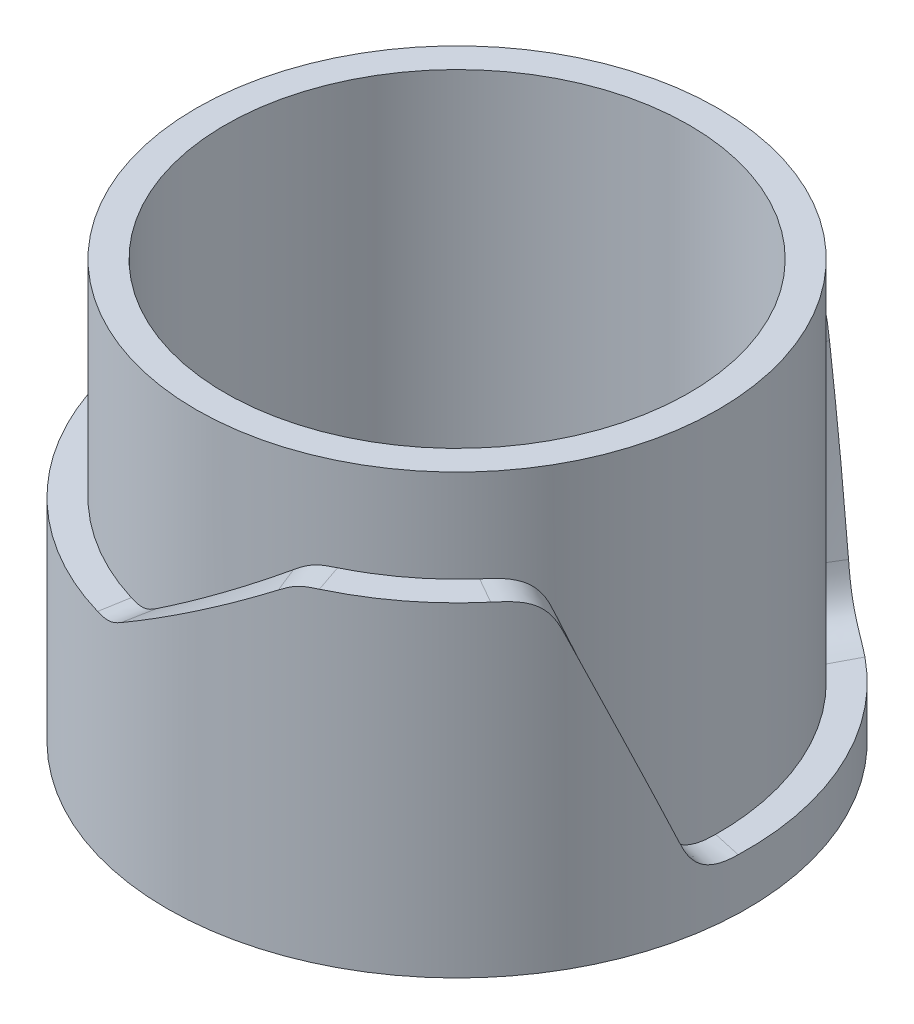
ISO-10303-21;
HEADER;
FILE_DESCRIPTION(('STEP AP214'),'2;1');
FILE_NAME('part.step','',(''),(''),'','','');
FILE_SCHEMA(('AUTOMOTIVE_DESIGN { 1 0 10303 214 1 1 1 1 }'));
ENDSEC;
DATA;
#1=APPLICATION_CONTEXT('core data for automotive mechanical design processes');
#2=APPLICATION_PROTOCOL_DEFINITION('international standard','automotive_design',2000,#1);
#3=PRODUCT_CONTEXT('',#1,'mechanical');
#4=PRODUCT('Part','Part','',(#3));
#5=PRODUCT_RELATED_PRODUCT_CATEGORY('part','',(#4));
#6=PRODUCT_DEFINITION_FORMATION('','',#4);
#7=PRODUCT_DEFINITION_CONTEXT('part definition',#1,'design');
#8=PRODUCT_DEFINITION('design','',#6,#7);
#9=PRODUCT_DEFINITION_SHAPE('','',#8);
#10=(LENGTH_UNIT() NAMED_UNIT(*) SI_UNIT(.MILLI.,.METRE.));
#11=(NAMED_UNIT(*) PLANE_ANGLE_UNIT() SI_UNIT($,.RADIAN.));
#12=(NAMED_UNIT(*) SI_UNIT($,.STERADIAN.) SOLID_ANGLE_UNIT());
#13=UNCERTAINTY_MEASURE_WITH_UNIT(LENGTH_MEASURE(1.E-05),#10,'distance_accuracy_value','');
#14=(GEOMETRIC_REPRESENTATION_CONTEXT(3) GLOBAL_UNCERTAINTY_ASSIGNED_CONTEXT((#13)) GLOBAL_UNIT_ASSIGNED_CONTEXT((#10,
#11,#12)) REPRESENTATION_CONTEXT('',''));
#15=CARTESIAN_POINT('',(0.,0.,0.));
#16=DIRECTION('',(0.,0.,1.));
#17=DIRECTION('',(1.,0.,0.));
#18=AXIS2_PLACEMENT_3D('',#15,#16,#17);
#19=CARTESIAN_POINT('',(0.,180.,0.));
#20=DIRECTION('',(0.,1.,0.));
#21=DIRECTION('',(0.,0.,1.));
#22=AXIS2_PLACEMENT_3D('',#19,#20,#21);
#23=PLANE('',#22);
#24=CARTESIAN_POINT('',(0.,180.,0.));
#25=DIRECTION('',(0.,1.,0.));
#26=DIRECTION('',(1.,0.,0.));
#27=AXIS2_PLACEMENT_3D('',#24,#25,#26);
#28=CIRCLE('',#27,100.);
#29=CARTESIAN_POINT('',(0.,180.,-100.));
#30=VERTEX_POINT('',#29);
#31=EDGE_CURVE('E573',#30,#30,#28,.T.);
#32=ORIENTED_EDGE('',*,*,#31,.F.);
#33=EDGE_LOOP('',(#32));
#34=FACE_BOUND('',#33,.T.);
#35=CARTESIAN_POINT('',(0.,180.,0.));
#36=DIRECTION('',(0.,-1.,0.));
#37=DIRECTION('',(0.,0.,-1.));
#38=AXIS2_PLACEMENT_3D('',#35,#36,#37);
#39=CIRCLE('',#38,112.5);
#40=CARTESIAN_POINT('',(0.,180.,-112.5));
#41=VERTEX_POINT('',#40);
#42=EDGE_CURVE('E963',#41,#41,#39,.F.);
#43=ORIENTED_EDGE('',*,*,#42,.T.);
#44=EDGE_LOOP('',(#43));
#45=FACE_BOUND('',#44,.T.);
#46=ADVANCED_FACE('F96',(#34,#45),#23,.T.);
#47=CARTESIAN_POINT('',(0.,0.,0.));
#48=DIRECTION('',(0.,1.,0.));
#49=DIRECTION('',(0.,0.,1.));
#50=AXIS2_PLACEMENT_3D('',#47,#48,#49);
#51=PLANE('',#50);
#52=CARTESIAN_POINT('',(0.,0.,0.));
#53=DIRECTION('',(0.,1.,0.));
#54=DIRECTION('',(0.,0.,1.));
#55=AXIS2_PLACEMENT_3D('',#52,#53,#54);
#56=CIRCLE('',#55,125.);
#57=CARTESIAN_POINT('',(0.,0.,125.));
#58=VERTEX_POINT('',#57);
#59=EDGE_CURVE('E570',#58,#58,#56,.T.);
#60=ORIENTED_EDGE('',*,*,#59,.F.);
#61=EDGE_LOOP('',(#60));
#62=FACE_BOUND('',#61,.T.);
#63=CARTESIAN_POINT('',(0.,0.,0.));
#64=DIRECTION('',(0.,1.,0.));
#65=DIRECTION('',(1.,0.,0.));
#66=AXIS2_PLACEMENT_3D('',#63,#64,#65);
#67=CIRCLE('',#66,100.);
#68=CARTESIAN_POINT('',(0.,0.,-100.));
#69=VERTEX_POINT('',#68);
#70=EDGE_CURVE('E253',#69,#69,#67,.T.);
#71=ORIENTED_EDGE('',*,*,#70,.T.);
#72=EDGE_LOOP('',(#71));
#73=FACE_BOUND('',#72,.T.);
#74=ADVANCED_FACE('F374',(#62,#73),#51,.F.);
#75=CARTESIAN_POINT('',(0.,180.,0.));
#76=DIRECTION('',(0.,-1.,0.));
#77=DIRECTION('',(0.,0.,-1.));
#78=AXIS2_PLACEMENT_3D('',#75,#76,#77);
#79=CYLINDRICAL_SURFACE('',#78,125.);
#80=CARTESIAN_POINT('',(-12.2810742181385,132.,-124.395237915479));
#81=CARTESIAN_POINT('',(-20.5741506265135,125.166616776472,-123.576493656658));
#82=CARTESIAN_POINT('',(-28.7847395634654,118.333333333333,-121.925728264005));
#83=CARTESIAN_POINT('',(-44.7148385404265,104.666666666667,-117.025756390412));
#84=CARTESIAN_POINT('',(-52.433810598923,97.8333832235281,-113.776715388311));
#85=CARTESIAN_POINT('',(-59.7534057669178,91.,-109.793125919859));
#86=B_SPLINE_CURVE_WITH_KNOTS('',3,(#80,#81,#82,#83,#84,#85),.UNSPECIFIED.,.F.,.F.,(4,2,4),(0.,
0.5,1.),.UNSPECIFIED.);
#87=CARTESIAN_POINT('',(-19.1378803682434,126.331700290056,-123.526110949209));
#88=VERTEX_POINT('',#87);
#89=CARTESIAN_POINT('',(-53.5934510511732,96.6683233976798,-112.927855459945));
#90=VERTEX_POINT('',#89);
#91=EDGE_CURVE('E254',#88,#90,#86,.T.);
#92=ORIENTED_EDGE('',*,*,#91,.F.);
#93=CARTESIAN_POINT('',(-3.31798187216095,132.,-124.955956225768));
#94=CARTESIAN_POINT('',(-3.69024216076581,132.000217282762,-124.946200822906));
#95=CARTESIAN_POINT('',(-4.06254557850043,132.000023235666,-124.934896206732));
#96=CARTESIAN_POINT('',(-4.80499019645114,131.993703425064,-124.908974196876));
#97=CARTESIAN_POINT('',(-5.17513236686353,131.987609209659,-124.894374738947));
#98=CARTESIAN_POINT('',(-5.91474628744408,131.964497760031,-124.861560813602));
#99=CARTESIAN_POINT('',(-6.28421830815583,131.947487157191,-124.843348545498));
#100=CARTESIAN_POINT('',(-7.0208466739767,131.898989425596,-124.803626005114));
#101=CARTESIAN_POINT('',(-7.38800663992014,131.867549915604,-124.782126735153));
#102=CARTESIAN_POINT('',(-8.11685087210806,131.787520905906,-124.736307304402));
#103=CARTESIAN_POINT('',(-8.4785542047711,131.739094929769,-124.712015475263));
#104=CARTESIAN_POINT('',(-9.01651782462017,131.651960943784,-124.673709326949));
#105=CARTESIAN_POINT('',(-9.19407710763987,131.62071835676,-124.660708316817));
#106=CARTESIAN_POINT('',(-9.54649198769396,131.553442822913,-124.634203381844));
#107=CARTESIAN_POINT('',(-9.72135722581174,131.517458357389,-124.620705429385));
#108=CARTESIAN_POINT('',(-10.0680140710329,131.440639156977,-124.593262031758));
#109=CARTESIAN_POINT('',(-10.2398185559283,131.399860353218,-124.579322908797));
#110=CARTESIAN_POINT('',(-10.5800628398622,131.313447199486,-124.551040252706));
#111=CARTESIAN_POINT('',(-10.7485186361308,131.267873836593,-124.536703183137));
#112=CARTESIAN_POINT('',(-11.081861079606,131.171918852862,-124.507655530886));
#113=CARTESIAN_POINT('',(-11.2467663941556,131.121600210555,-124.492951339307));
#114=CARTESIAN_POINT('',(-11.5729045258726,131.016251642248,-124.463181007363));
#115=CARTESIAN_POINT('',(-11.7341577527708,130.961283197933,-124.448121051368));
#116=CARTESIAN_POINT('',(-12.0469494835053,130.848954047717,-124.418226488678));
#117=CARTESIAN_POINT('',(-12.198578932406,130.791839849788,-124.40341656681));
#118=CARTESIAN_POINT('',(-12.502759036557,130.671904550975,-124.373111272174));
#119=CARTESIAN_POINT('',(-12.655275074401,130.60899760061,-124.357608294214));
#120=CARTESIAN_POINT('',(-12.9610694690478,130.477358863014,-124.325938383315));
#121=CARTESIAN_POINT('',(-13.1143100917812,130.408541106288,-124.3097644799));
#122=CARTESIAN_POINT('',(-13.4213418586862,130.265056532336,-124.276785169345));
#123=CARTESIAN_POINT('',(-13.5750935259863,130.190306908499,-124.259973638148));
#124=CARTESIAN_POINT('',(-14.0405330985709,129.955483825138,-124.208234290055));
#125=CARTESIAN_POINT('',(-14.3485659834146,129.788221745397,-124.172816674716));
#126=CARTESIAN_POINT('',(-14.963561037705,129.432393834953,-124.099988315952));
#127=CARTESIAN_POINT('',(-15.270246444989,129.243359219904,-124.062549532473));
#128=CARTESIAN_POINT('',(-15.8802260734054,128.846715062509,-123.98601807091));
#129=CARTESIAN_POINT('',(-16.1833205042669,128.638803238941,-123.946907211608));
#130=CARTESIAN_POINT('',(-16.7845466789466,128.208025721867,-123.867253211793));
#131=CARTESIAN_POINT('',(-17.082561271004,127.984999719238,-123.82669801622));
#132=CARTESIAN_POINT('',(-17.6739120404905,127.527749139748,-123.744089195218));
#133=CARTESIAN_POINT('',(-17.9671823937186,127.293442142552,-123.702025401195));
#134=CARTESIAN_POINT('',(-18.5531570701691,126.816805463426,-123.615760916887));
#135=CARTESIAN_POINT('',(-18.8458064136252,126.574411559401,-123.571539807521));
#136=CARTESIAN_POINT('',(-19.1379044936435,126.331698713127,-123.526274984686));
#137=B_SPLINE_CURVE_WITH_KNOTS('',3,(#93,#94,#95,#96,#97,#98,#99,#100,#101,#102,#103,#104,#105,
#106,#107,#108,#109,#110,#111,#112,#113,#114,#115,#116,#117,#118,#119,#120,#121,#122,#123,#124,
#125,#126,#127,#128,#129,#130,#131,#132,#133,#134,#135,#136),.UNSPECIFIED.,.F.,.F.,(4,2,2,2,2,2,
2,2,2,2,2,2,2,2,2,2,2,2,2,2,2,4),(0.,1.11729921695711,2.22865706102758,3.3393404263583,
4.4463843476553,5.54305103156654,6.0852534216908,6.62228945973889,7.15358748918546,
7.67879803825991,8.19782043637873,8.71081688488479,9.19885447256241,9.69589620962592,
10.2020963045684,10.71738107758,11.7736425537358,12.8597825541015,13.9682825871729,
15.0913148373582,16.2244072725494,17.3719590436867),.UNSPECIFIED.);
#138=CARTESIAN_POINT('',(-3.31798187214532,132.,-124.955956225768));
#139=VERTEX_POINT('',#138);
#140=EDGE_CURVE('E544',#88,#139,#137,.F.);
#141=ORIENTED_EDGE('',*,*,#140,.T.);
#142=CARTESIAN_POINT('',(0.,132.,0.));
#143=DIRECTION('',(0.,-1.,0.));
#144=DIRECTION('',(0.,0.,-1.));
#145=AXIS2_PLACEMENT_3D('',#142,#143,#144);
#146=CIRCLE('',#145,125.);
#147=CARTESIAN_POINT('',(19.5058431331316,132.,-123.46870892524));
#148=VERTEX_POINT('',#147);
#149=EDGE_CURVE('E959',#139,#148,#146,.T.);
#150=ORIENTED_EDGE('',*,*,#149,.T.);
#151=CARTESIAN_POINT('',(43.2111843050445,112.540516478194,-117.293621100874));
#152=CARTESIAN_POINT('',(43.116514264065,112.985158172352,-117.328495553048));
#153=CARTESIAN_POINT('',(43.0214988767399,113.429784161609,-117.363363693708));
#154=CARTESIAN_POINT('',(42.831590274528,114.293743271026,-117.432745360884));
#155=CARTESIAN_POINT('',(42.7369685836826,114.71314330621,-117.467176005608));
#156=CARTESIAN_POINT('',(42.5448638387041,115.526329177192,-117.536783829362));
#157=CARTESIAN_POINT('',(42.4478378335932,115.920234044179,-117.571811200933));
#158=CARTESIAN_POINT('',(42.250046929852,116.681364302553,-117.642932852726));
#159=CARTESIAN_POINT('',(42.149865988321,117.048758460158,-117.678833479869));
#160=CARTESIAN_POINT('',(41.9460811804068,117.755658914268,-117.751581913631));
#161=CARTESIAN_POINT('',(41.8431573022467,118.095383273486,-117.788204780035));
#162=CARTESIAN_POINT('',(41.6350237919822,118.745948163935,-117.861973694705));
#163=CARTESIAN_POINT('',(41.5305571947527,119.057053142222,-117.898876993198));
#164=CARTESIAN_POINT('',(41.3209555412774,119.649774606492,-117.972605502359));
#165=CARTESIAN_POINT('',(41.2165958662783,119.931695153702,-118.009182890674));
#166=CARTESIAN_POINT('',(41.0090846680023,120.465865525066,-118.081558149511));
#167=CARTESIAN_POINT('',(40.9067118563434,120.718450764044,-118.117115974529));
#168=CARTESIAN_POINT('',(40.6314509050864,121.36810313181,-118.212173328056));
#169=CARTESIAN_POINT('',(40.4526158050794,121.762425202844,-118.273413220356));
#170=CARTESIAN_POINT('',(40.0822993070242,122.521740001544,-118.399102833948));
#171=CARTESIAN_POINT('',(39.8917827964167,122.88724635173,-118.463273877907));
#172=CARTESIAN_POINT('',(39.5941341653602,123.419180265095,-118.562675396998));
#173=CARTESIAN_POINT('',(39.4950045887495,123.590537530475,-118.595653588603));
#174=CARTESIAN_POINT('',(39.2944206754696,123.92555817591,-118.662109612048));
#175=CARTESIAN_POINT('',(39.1930951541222,124.089305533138,-118.69555175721));
#176=CARTESIAN_POINT('',(38.988381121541,124.409065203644,-118.762838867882));
#177=CARTESIAN_POINT('',(38.8851211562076,124.565167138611,-118.796648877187));
#178=CARTESIAN_POINT('',(38.6768006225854,124.86965028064,-118.864574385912));
#179=CARTESIAN_POINT('',(38.5718670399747,125.018125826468,-118.898656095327));
#180=CARTESIAN_POINT('',(38.360464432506,125.307414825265,-118.967026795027));
#181=CARTESIAN_POINT('',(38.2541195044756,125.448326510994,-119.00128359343));
#182=CARTESIAN_POINT('',(38.0401585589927,125.722589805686,-119.069906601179));
#183=CARTESIAN_POINT('',(37.9326625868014,125.856042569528,-119.104242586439));
#184=CARTESIAN_POINT('',(37.7166615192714,126.115529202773,-119.172927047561));
#185=CARTESIAN_POINT('',(37.6082714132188,126.241666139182,-119.207247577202));
#186=CARTESIAN_POINT('',(37.3907400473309,126.486697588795,-119.275805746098));
#187=CARTESIAN_POINT('',(37.2817079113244,126.605696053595,-119.310017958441));
#188=CARTESIAN_POINT('',(37.0631451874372,126.836658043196,-119.378266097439));
#189=CARTESIAN_POINT('',(36.9537172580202,126.948725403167,-119.412279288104));
#190=CARTESIAN_POINT('',(36.7346096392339,127.166059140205,-119.480038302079));
#191=CARTESIAN_POINT('',(36.6250257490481,127.271428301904,-119.513764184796));
#192=CARTESIAN_POINT('',(36.4058453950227,127.475622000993,-119.580860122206));
#193=CARTESIAN_POINT('',(36.2963377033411,127.574547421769,-119.614213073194));
#194=CARTESIAN_POINT('',(36.0775437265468,127.76612641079,-119.680477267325));
#195=CARTESIAN_POINT('',(35.9683391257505,127.858878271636,-119.713374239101));
#196=CARTESIAN_POINT('',(35.7177092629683,128.065299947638,-119.788424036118));
#197=CARTESIAN_POINT('',(35.575469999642,128.177938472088,-119.830701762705));
#198=CARTESIAN_POINT('',(35.2874692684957,128.397183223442,-119.915667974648));
#199=CARTESIAN_POINT('',(35.1417238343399,128.503811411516,-119.958354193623));
#200=CARTESIAN_POINT('',(34.8468454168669,128.71114628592,-120.044089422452));
#201=CARTESIAN_POINT('',(34.697723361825,128.81186909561,-120.087137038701));
#202=CARTESIAN_POINT('',(34.3962586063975,129.00750659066,-120.17353454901));
#203=CARTESIAN_POINT('',(34.2439230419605,129.102432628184,-120.216883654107));
#204=CARTESIAN_POINT('',(33.9362227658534,129.286595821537,-120.30381445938));
#205=CARTESIAN_POINT('',(33.7808625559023,129.375840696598,-120.347395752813));
#206=CARTESIAN_POINT('',(33.4673253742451,129.548765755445,-120.434713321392));
#207=CARTESIAN_POINT('',(33.3091512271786,129.632451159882,-120.478449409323));
#208=CARTESIAN_POINT('',(32.990214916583,129.794386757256,-120.565992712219));
#209=CARTESIAN_POINT('',(32.8294546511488,129.872640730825,-120.60979985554));
#210=CARTESIAN_POINT('',(32.5055880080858,130.023848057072,-120.697396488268));
#211=CARTESIAN_POINT('',(32.3424831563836,130.096804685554,-120.741185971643));
#212=CARTESIAN_POINT('',(32.014176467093,130.237557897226,-120.828655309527));
#213=CARTESIAN_POINT('',(31.8489761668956,130.305358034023,-120.872335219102));
#214=CARTESIAN_POINT('',(31.5167401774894,130.435942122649,-120.95949010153));
#215=CARTESIAN_POINT('',(31.3497062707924,130.498730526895,-121.002965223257));
#216=CARTESIAN_POINT('',(30.8466125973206,130.679663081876,-121.13284078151));
#217=CARTESIAN_POINT('',(30.5078677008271,130.79066965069,-121.218876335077));
#218=CARTESIAN_POINT('',(29.8261502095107,130.994465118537,-121.388993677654));
#219=CARTESIAN_POINT('',(29.4832013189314,131.087328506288,-121.473082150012));
#220=CARTESIAN_POINT('',(28.7949825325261,131.256204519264,-121.638502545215));
#221=CARTESIAN_POINT('',(28.449741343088,131.332320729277,-121.719848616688));
#222=CARTESIAN_POINT('',(27.7604740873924,131.468822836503,-121.879025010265));
#223=CARTESIAN_POINT('',(27.416494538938,131.529407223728,-121.956887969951));
#224=CARTESIAN_POINT('',(26.722538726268,131.637971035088,-122.111033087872));
#225=CARTESIAN_POINT('',(26.3725368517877,131.685819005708,-122.187291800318));
#226=CARTESIAN_POINT('',(25.6678086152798,131.769752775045,-122.337664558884));
#227=CARTESIAN_POINT('',(25.3130666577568,131.805744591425,-122.411757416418));
#228=CARTESIAN_POINT('',(24.5999841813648,131.867092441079,-122.557404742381));
#229=CARTESIAN_POINT('',(24.2416347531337,131.892384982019,-122.628941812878));
#230=CARTESIAN_POINT('',(23.1602155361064,131.954434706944,-122.839664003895));
#231=CARTESIAN_POINT('',(22.4353771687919,131.976854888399,-122.973974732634));
#232=CARTESIAN_POINT('',(21.343889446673,131.99401246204,-123.165824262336));
#233=CARTESIAN_POINT('',(20.9781391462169,131.99696838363,-123.228361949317));
#234=CARTESIAN_POINT('',(20.243623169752,131.999995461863,-123.350680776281));
#235=CARTESIAN_POINT('',(19.8748538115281,132.000047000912,-123.41044044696));
#236=CARTESIAN_POINT('',(19.5058431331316,132.,-123.46870892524));
#237=B_SPLINE_CURVE_WITH_KNOTS('',3,(#151,#152,#153,#154,#155,#156,#157,#158,#159,#160,#161,
#162,#163,#164,#165,#166,#167,#168,#169,#170,#171,#172,#173,#174,#175,#176,#177,#178,#179,#180,
#181,#182,#183,#184,#185,#186,#187,#188,#189,#190,#191,#192,#193,#194,#195,#196,#197,#198,#199,
#200,#201,#202,#203,#204,#205,#206,#207,#208,#209,#210,#211,#212,#213,#214,#215,#216,#217,#218,
#219,#220,#221,#222,#223,#224,#225,#226,#227,#228,#229,#230,#231,#232,#233,#234,#235,#236),
.UNSPECIFIED.,.F.,.F.,(4,2,2,2,2,2,2,2,2,2,2,2,2,2,2,2,2,2,2,2,2,2,2,2,2,2,2,2,2,2,2,2,2,2,2,2,
2,2,2,2,2,2,4),(0.,1.36792382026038,2.66183736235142,3.88328414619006,5.03062729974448,
6.10103446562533,7.09160565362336,7.99994685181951,8.82439014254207,10.1356007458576,
11.386282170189,11.9882830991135,12.574522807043,13.1450136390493,13.6998634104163,
14.239264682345,14.7634822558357,15.272839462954,15.7677038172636,16.2484725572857,
16.7155585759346,17.1693771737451,17.6103340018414,18.1690909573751,18.725652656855,
19.2806162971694,19.8344557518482,20.3875258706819,20.9400690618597,21.492223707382,
22.0440339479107,22.595460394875,23.1463913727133,24.2459294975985,25.3408538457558,
26.4288025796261,27.5020637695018,28.586006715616,29.6783460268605,30.7770796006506,
32.9887270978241,34.1019347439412,35.2226606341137),.UNSPECIFIED.);
#238=CARTESIAN_POINT('',(43.2111594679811,112.540510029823,-117.293536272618));
#239=VERTEX_POINT('',#238);
#240=EDGE_CURVE('E547',#148,#239,#237,.F.);
#241=ORIENTED_EDGE('',*,*,#240,.T.);
#242=CARTESIAN_POINT('',(61.8486948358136,22.0000000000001,-108.626603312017));
#243=CARTESIAN_POINT('',(54.6069038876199,58.6667547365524,-112.749859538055));
#244=CARTESIAN_POINT('',(46.9516659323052,95.3332452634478,-116.146398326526));
#245=CARTESIAN_POINT('',(39.0350641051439,132.,-118.748742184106));
#246=B_SPLINE_CURVE_WITH_KNOTS('',3,(#242,#243,#244,#245),.UNSPECIFIED.,.F.,.F.,(4,4),(0.,1.),.UNSPECIFIED.);
#247=CARTESIAN_POINT('',(57.9674466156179,41.4594899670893,-110.746346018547));
#248=VERTEX_POINT('',#247);
#249=EDGE_CURVE('E449',#248,#239,#246,.T.);
#250=ORIENTED_EDGE('',*,*,#249,.F.);
#251=CARTESIAN_POINT('',(78.4530710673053,22.0000000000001,-97.3145191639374));
#252=CARTESIAN_POINT('',(78.1612323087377,21.9999522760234,-97.5498306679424));
#253=CARTESIAN_POINT('',(77.8684432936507,22.0000045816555,-97.7839543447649));
#254=CARTESIAN_POINT('',(77.2828244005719,22.0030631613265,-98.2480475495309));
#255=CARTESIAN_POINT('',(76.990008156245,22.006049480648,-98.4780344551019));
#256=CARTESIAN_POINT('',(76.1123160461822,22.0233802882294,-99.1608097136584));
#257=CARTESIAN_POINT('',(75.5243162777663,22.0460239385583,-99.6095487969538));
#258=CARTESIAN_POINT('',(74.6393850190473,22.1086727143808,-100.272023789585));
#259=CARTESIAN_POINT('',(74.3448905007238,22.1342059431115,-100.490377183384));
#260=CARTESIAN_POINT('',(73.7564504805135,22.196129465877,-100.922629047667));
#261=CARTESIAN_POINT('',(73.4625120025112,22.2324547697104,-101.136546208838));
#262=CARTESIAN_POINT('',(72.8762497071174,22.3171556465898,-101.559332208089));
#263=CARTESIAN_POINT('',(72.583931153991,22.3654351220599,-101.768227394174));
#264=CARTESIAN_POINT('',(72.0022051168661,22.4749648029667,-102.180378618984));
#265=CARTESIAN_POINT('',(71.71279769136,22.5360807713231,-102.383670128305));
#266=CARTESIAN_POINT('',(71.1325792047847,22.6732962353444,-102.787473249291));
#267=CARTESIAN_POINT('',(70.8417717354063,22.7494934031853,-102.987957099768));
#268=CARTESIAN_POINT('',(70.2596742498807,22.9184337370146,-103.385434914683));
#269=CARTESIAN_POINT('',(69.9683930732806,23.0112797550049,-103.582398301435));
#270=CARTESIAN_POINT('',(69.3871997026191,23.2149271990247,-103.971951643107));
#271=CARTESIAN_POINT('',(69.0972985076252,23.3258028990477,-104.164519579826));
#272=CARTESIAN_POINT('',(68.6651974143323,23.5064422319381,-104.449122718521));
#273=CARTESIAN_POINT('',(68.5214704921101,23.5691174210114,-104.543380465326));
#274=CARTESIAN_POINT('',(68.2350868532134,23.6994417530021,-104.730411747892));
#275=CARTESIAN_POINT('',(68.0924312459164,23.7670954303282,-104.823183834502));
#276=CARTESIAN_POINT('',(67.808433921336,23.9075209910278,-105.00711474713));
#277=CARTESIAN_POINT('',(67.6670932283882,23.9802965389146,-105.098272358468));
#278=CARTESIAN_POINT('',(67.3859584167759,24.1311056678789,-105.278852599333));
#279=CARTESIAN_POINT('',(67.2461653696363,24.2091426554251,-105.368274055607));
#280=CARTESIAN_POINT('',(66.968350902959,24.3706070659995,-105.545263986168));
#281=CARTESIAN_POINT('',(66.8303308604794,24.454038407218,-105.632831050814));
#282=CARTESIAN_POINT('',(66.5562743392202,24.6264170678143,-105.806001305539));
#283=CARTESIAN_POINT('',(66.420239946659,24.7153697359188,-105.891602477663));
#284=CARTESIAN_POINT('',(66.1503501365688,24.8989093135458,-106.060738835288));
#285=CARTESIAN_POINT('',(66.0164980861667,24.9935040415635,-106.144270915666));
#286=CARTESIAN_POINT('',(65.7511472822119,25.1884389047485,-106.30917818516));
#287=CARTESIAN_POINT('',(65.6196539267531,25.2887904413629,-106.390548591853));
#288=CARTESIAN_POINT('',(65.3591699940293,25.4953420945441,-106.55105485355));
#289=CARTESIAN_POINT('',(65.2301877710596,25.6015583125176,-106.630183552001));
#290=CARTESIAN_POINT('',(64.9748431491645,25.8199378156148,-106.786145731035));
#291=CARTESIAN_POINT('',(64.848493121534,25.9321229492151,-106.862968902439));
#292=CARTESIAN_POINT('',(64.6248423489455,26.1382468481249,-106.998332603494));
#293=CARTESIAN_POINT('',(64.5269205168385,26.231182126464,-107.057378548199));
#294=CARTESIAN_POINT('',(64.3304612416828,26.4231607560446,-107.175443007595));
#295=CARTESIAN_POINT('',(64.2319897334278,26.5223032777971,-107.234410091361));
#296=CARTESIAN_POINT('',(64.0346399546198,26.7269666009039,-107.352206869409));
#297=CARTESIAN_POINT('',(63.9358345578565,26.8325891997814,-107.41098174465));
#298=CARTESIAN_POINT('',(63.7380313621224,27.0504677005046,-107.528281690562));
#299=CARTESIAN_POINT('',(63.6391133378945,27.1628273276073,-107.586748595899));
#300=CARTESIAN_POINT('',(63.4413066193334,27.3944140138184,-107.703316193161));
#301=CARTESIAN_POINT('',(63.3425044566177,27.5137458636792,-107.761355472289));
#302=CARTESIAN_POINT('',(63.1451577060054,27.7594862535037,-107.876948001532));
#303=CARTESIAN_POINT('',(63.0467060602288,27.8859997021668,-107.934436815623));
#304=CARTESIAN_POINT('',(62.8502947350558,28.1462832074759,-108.048805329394));
#305=CARTESIAN_POINT('',(62.7524338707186,28.2801572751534,-108.105617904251));
#306=CARTESIAN_POINT('',(62.5574438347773,28.5553083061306,-108.21850801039));
#307=CARTESIAN_POINT('',(62.4604186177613,28.6966873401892,-108.274516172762));
#308=CARTESIAN_POINT('',(62.2673437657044,28.986956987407,-108.385669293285));
#309=CARTESIAN_POINT('',(62.171402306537,29.1359467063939,-108.44074318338));
#310=CARTESIAN_POINT('',(61.9807417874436,29.4415044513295,-108.54989798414));
#311=CARTESIAN_POINT('',(61.8861340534,29.5981676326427,-108.603906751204));
#312=CARTESIAN_POINT('',(61.6983876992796,29.9190958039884,-108.710801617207));
#313=CARTESIAN_POINT('',(61.6053623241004,30.0834511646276,-108.763615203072));
#314=CARTESIAN_POINT('',(61.4210289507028,30.4197329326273,-108.867988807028));
#315=CARTESIAN_POINT('',(61.3298349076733,30.591743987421,-108.91947661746));
#316=CARTESIAN_POINT('',(61.0557372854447,31.1257479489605,-109.073814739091));
#317=CARTESIAN_POINT('',(60.8799197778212,31.4926951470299,-109.172215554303));
#318=CARTESIAN_POINT('',(60.5375130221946,32.2550446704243,-109.362807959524));
#319=CARTESIAN_POINT('',(60.3717850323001,32.6509638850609,-109.454466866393));
#320=CARTESIAN_POINT('',(60.1166979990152,33.3018735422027,-109.594683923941));
#321=CARTESIAN_POINT('',(60.0219894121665,33.5540904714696,-109.646524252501));
#322=CARTESIAN_POINT('',(59.829811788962,34.0873828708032,-109.75139661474));
#323=CARTESIAN_POINT('',(59.7330374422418,34.368790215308,-109.804016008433));
#324=CARTESIAN_POINT('',(59.5384843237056,34.9603394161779,-109.909518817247));
#325=CARTESIAN_POINT('',(59.4414034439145,35.2707820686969,-109.961997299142));
#326=CARTESIAN_POINT('',(59.2478029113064,35.9198769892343,-110.066390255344));
#327=CARTESIAN_POINT('',(59.1519556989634,36.2587908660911,-110.117920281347));
#328=CARTESIAN_POINT('',(58.961996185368,36.9639310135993,-110.219795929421));
#329=CARTESIAN_POINT('',(58.8685011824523,37.3303730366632,-110.269791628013));
#330=CARTESIAN_POINT('',(58.6837121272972,38.0894701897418,-110.368349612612));
#331=CARTESIAN_POINT('',(58.5929484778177,38.4822923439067,-110.416611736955));
#332=CARTESIAN_POINT('',(58.4130295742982,39.2931957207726,-110.51200969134));
#333=CARTESIAN_POINT('',(58.3242880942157,39.7113947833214,-110.558909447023));
#334=CARTESIAN_POINT('',(58.1459597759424,40.5728410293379,-110.652861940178));
#335=CARTESIAN_POINT('',(58.0566142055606,41.0161544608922,-110.699770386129));
#336=CARTESIAN_POINT('',(57.9674927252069,41.4594835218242,-110.746421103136));
#337=B_SPLINE_CURVE_WITH_KNOTS('',3,(#251,#252,#253,#254,#255,#256,#257,#258,#259,#260,#261,
#262,#263,#264,#265,#266,#267,#268,#269,#270,#271,#272,#273,#274,#275,#276,#277,#278,#279,#280,
#281,#282,#283,#284,#285,#286,#287,#288,#289,#290,#291,#292,#293,#294,#295,#296,#297,#298,#299,
#300,#301,#302,#303,#304,#305,#306,#307,#308,#309,#310,#311,#312,#313,#314,#315,#316,#317,#318,
#319,#320,#321,#322,#323,#324,#325,#326,#327,#328,#329,#330,#331,#332,#333,#334,#335,#336),
.UNSPECIFIED.,.F.,.F.,(4,2,2,2,2,2,2,2,2,2,2,2,2,2,2,2,2,2,2,2,2,2,2,2,2,2,2,2,2,2,2,2,2,2,2,2,
2,2,2,2,2,2,4),(0.,1.12464268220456,2.24168905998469,4.46081641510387,5.56316843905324,
6.65901216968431,7.74631740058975,8.82277284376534,9.90644251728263,10.9970531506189,
12.0922760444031,12.6410582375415,13.1903466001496,13.7400320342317,14.2900768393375,
14.8405257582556,15.3915165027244,15.9432893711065,16.4961955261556,17.0507034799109,
17.6074033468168,18.0493921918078,18.5043233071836,18.9726055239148,19.4546575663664,
19.9508958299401,20.4617209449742,20.987503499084,21.5285693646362,22.0851851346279,
22.6575442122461,23.2457541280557,23.849825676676,25.1049355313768,26.4209239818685,
27.2438755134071,28.1503148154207,29.1385772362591,30.2062819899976,31.3505525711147,
32.5685867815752,33.8587742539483,35.2226597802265),.UNSPECIFIED.);
#338=CARTESIAN_POINT('',(78.4530710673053,22.0000000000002,-97.3145191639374));
#339=VERTEX_POINT('',#338);
#340=EDGE_CURVE('E443',#248,#339,#337,.F.);
#341=ORIENTED_EDGE('',*,*,#340,.T.);
#342=CARTESIAN_POINT('',(0.,22.0000000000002,0.));
#343=DIRECTION('',(0.,-1.,0.));
#344=DIRECTION('',(0.,0.,-1.));
#345=AXIS2_PLACEMENT_3D('',#342,#343,#344);
#346=CIRCLE('',#345,125.);
#347=CARTESIAN_POINT('',(124.942605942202,22.0000000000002,3.78750846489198));
#348=VERTEX_POINT('',#347);
#349=EDGE_CURVE('E447',#339,#348,#346,.T.);
#350=ORIENTED_EDGE('',*,*,#349,.T.);
#351=CARTESIAN_POINT('',(122.123570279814,37.0816541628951,26.6614624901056));
#352=CARTESIAN_POINT('',(122.15378170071,36.7537709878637,26.5230775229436));
#353=CARTESIAN_POINT('',(122.183793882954,36.425929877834,26.3845253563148));
#354=CARTESIAN_POINT('',(122.242853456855,35.7833529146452,26.1095020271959));
#355=CARTESIAN_POINT('',(122.271896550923,35.4685713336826,25.9731363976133));
#356=CARTESIAN_POINT('',(122.356764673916,34.5610915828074,25.5711596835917));
#357=CARTESIAN_POINT('',(122.413336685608,33.9713369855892,25.2989175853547));
#358=CARTESIAN_POINT('',(122.525973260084,32.852560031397,24.7470909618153));
#359=CARTESIAN_POINT('',(122.581727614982,32.3224098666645,24.4697690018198));
#360=CARTESIAN_POINT('',(122.666469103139,31.5589796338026,24.0402030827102));
#361=CARTESIAN_POINT('',(122.693830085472,31.3185203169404,23.9003579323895));
#362=CARTESIAN_POINT('',(122.747995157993,30.854703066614,23.6208288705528));
#363=CARTESIAN_POINT('',(122.774752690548,30.6311114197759,23.4815243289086));
#364=CARTESIAN_POINT('',(122.838294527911,30.1131474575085,23.1471469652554));
#365=CARTESIAN_POINT('',(122.875387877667,29.8206253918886,22.9492493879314));
#366=CARTESIAN_POINT('',(122.949791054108,29.254576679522,22.5463415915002));
#367=CARTESIAN_POINT('',(122.987056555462,28.9807417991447,22.3417571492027));
#368=CARTESIAN_POINT('',(123.061588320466,28.4531642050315,21.9264529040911));
#369=CARTESIAN_POINT('',(123.098809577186,28.199053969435,21.7161931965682));
#370=CARTESIAN_POINT('',(123.173007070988,27.7115838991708,21.2906286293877));
#371=CARTESIAN_POINT('',(123.20994138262,27.477804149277,21.0757985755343));
#372=CARTESIAN_POINT('',(123.283312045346,27.031195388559,20.6422273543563));
#373=CARTESIAN_POINT('',(123.319712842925,26.8179063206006,20.4239550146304));
#374=CARTESIAN_POINT('',(123.39176640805,26.4120391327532,19.9846292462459));
#375=CARTESIAN_POINT('',(123.42739266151,26.2189770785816,19.7640193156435));
#376=CARTESIAN_POINT('',(123.497653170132,25.8529230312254,19.3211168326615));
#377=CARTESIAN_POINT('',(123.532271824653,25.6794416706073,19.0992265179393));
#378=CARTESIAN_POINT('',(123.600301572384,25.3515493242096,18.6547853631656));
#379=CARTESIAN_POINT('',(123.633708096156,25.1966622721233,18.4325857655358));
#380=CARTESIAN_POINT('',(123.686179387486,24.9622730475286,18.076099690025));
#381=CARTESIAN_POINT('',(123.70531644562,24.8786643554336,17.9445052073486));
#382=CARTESIAN_POINT('',(123.743448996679,24.7156898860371,17.6789728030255));
#383=CARTESIAN_POINT('',(123.762444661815,24.6363177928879,17.5450387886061));
#384=CARTESIAN_POINT('',(123.800285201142,24.4817719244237,17.2748955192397));
#385=CARTESIAN_POINT('',(123.819130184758,24.4065948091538,17.1386881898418));
#386=CARTESIAN_POINT('',(123.856649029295,24.2603852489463,16.8640905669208));
#387=CARTESIAN_POINT('',(123.87532292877,24.1893518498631,16.7257007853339));
#388=CARTESIAN_POINT('',(123.931065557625,23.9823447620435,16.307333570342));
#389=CARTESIAN_POINT('',(123.967842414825,23.8525162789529,16.0242495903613));
#390=CARTESIAN_POINT('',(124.040393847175,23.6086743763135,15.4508553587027));
#391=CARTESIAN_POINT('',(124.076167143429,23.4946804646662,15.160536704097));
#392=CARTESIAN_POINT('',(124.146447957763,23.2818448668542,14.5738884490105));
#393=CARTESIAN_POINT('',(124.180954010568,23.183020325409,14.2775524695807));
#394=CARTESIAN_POINT('',(124.24840053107,22.9997980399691,13.6802234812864));
#395=CARTESIAN_POINT('',(124.281340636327,22.9154036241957,13.3792294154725));
#396=CARTESIAN_POINT('',(124.345366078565,22.7602256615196,12.7739760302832));
#397=CARTESIAN_POINT('',(124.376453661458,22.6894253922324,12.4697212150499));
#398=CARTESIAN_POINT('',(124.436407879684,22.5605344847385,11.8593131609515));
#399=CARTESIAN_POINT('',(124.465281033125,22.5024055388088,11.5531686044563));
#400=CARTESIAN_POINT('',(124.520450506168,22.3984247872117,10.9436110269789));
#401=CARTESIAN_POINT('',(124.546780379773,22.3523932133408,10.6402314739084));
#402=CARTESIAN_POINT('',(124.597623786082,22.2701867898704,10.0299806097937));
#403=CARTESIAN_POINT('',(124.622124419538,22.2340778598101,9.72309941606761));
#404=CARTESIAN_POINT('',(124.669029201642,22.1709529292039,9.10681753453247));
#405=CARTESIAN_POINT('',(124.691423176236,22.1439795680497,8.79741175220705));
#406=CARTESIAN_POINT('',(124.733953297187,22.0981610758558,8.17689847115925));
#407=CARTESIAN_POINT('',(124.754082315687,22.0793411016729,7.86578866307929));
#408=CARTESIAN_POINT('',(124.810915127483,22.0333744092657,6.92982815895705));
#409=CARTESIAN_POINT('',(124.843920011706,22.0168997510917,6.30423248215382));
#410=CARTESIAN_POINT('',(124.886091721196,22.0043467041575,5.3642234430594));
#411=CARTESIAN_POINT('',(124.898944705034,22.0021968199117,5.04998639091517));
#412=CARTESIAN_POINT('',(124.922427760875,22.0000029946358,4.41968137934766));
#413=CARTESIAN_POINT('',(124.933045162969,21.9999707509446,4.10361289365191));
#414=CARTESIAN_POINT('',(124.942605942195,22.0000000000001,3.78750846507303));
#415=B_SPLINE_CURVE_WITH_KNOTS('',3,(#351,#352,#353,#354,#355,#356,#357,#358,#359,#360,#361,
#362,#363,#364,#365,#366,#367,#368,#369,#370,#371,#372,#373,#374,#375,#376,#377,#378,#379,#380,
#381,#382,#383,#384,#385,#386,#387,#388,#389,#390,#391,#392,#393,#394,#395,#396,#397,#398,#399,
#400,#401,#402,#403,#404,#405,#406,#407,#408,#409,#410,#411,#412,#413,#414),.UNSPECIFIED.,.F.,
.F.,(4,2,2,2,2,2,2,2,2,2,2,2,2,2,2,2,2,2,2,2,2,2,2,2,2,2,2,2,2,2,2,4),(0.,1.07152064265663,
2.10434659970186,4.05985231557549,5.8615168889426,6.69993088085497,7.49419056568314,
8.55916635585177,9.59030442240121,10.585618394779,11.5440917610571,12.4656724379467,
13.3511701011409,14.202083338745,15.0203846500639,15.4915552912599,15.9620026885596,
16.4320700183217,16.9020286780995,17.8422632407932,18.7836460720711,19.726085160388,
20.6687413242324,21.6102303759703,22.5488323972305,23.4725774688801,24.4023185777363,
25.3363412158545,26.2732255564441,28.1526876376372,29.0962084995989,30.0449407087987),.UNSPECIFIED.);
#416=CARTESIAN_POINT('',(122.123401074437,37.0816745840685,26.6614410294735));
#417=VERTEX_POINT('',#416);
#418=EDGE_CURVE('E117',#348,#417,#415,.F.);
#419=ORIENTED_EDGE('',*,*,#418,.T.);
#420=CARTESIAN_POINT('',(105.183873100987,140.,67.5377882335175));
#421=CARTESIAN_POINT('',(109.776452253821,120.33329242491,60.3852699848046));
#422=CARTESIAN_POINT('',(113.636805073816,100.666666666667,52.7629276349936));
#423=CARTESIAN_POINT('',(119.733459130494,61.3333333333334,36.8937496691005));
#424=CARTESIAN_POINT('',(121.969572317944,41.6667075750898,28.6474035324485));
#425=CARTESIAN_POINT('',(123.347239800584,22.0000000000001,20.2597737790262));
#426=B_SPLINE_CURVE_WITH_KNOTS('',3,(#420,#421,#422,#423,#424,#425),.UNSPECIFIED.,.F.,.F.,(4,2,
4),(0.,0.5,1.),.UNSPECIFIED.);
#427=CARTESIAN_POINT('',(108.561030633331,124.918332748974,61.9633917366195));
#428=VERTEX_POINT('',#427);
#429=EDGE_CURVE('E468',#428,#417,#426,.T.);
#430=ORIENTED_EDGE('',*,*,#429,.F.);
#431=CARTESIAN_POINT('',(95.339987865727,140.,80.841120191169));
#432=CARTESIAN_POINT('',(95.5443496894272,140.000029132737,80.6001393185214));
#433=CARTESIAN_POINT('',(95.7479040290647,139.999997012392,80.358478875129));
#434=CARTESIAN_POINT('',(96.1521233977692,139.997808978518,79.8750112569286));
#435=CARTESIAN_POINT('',(96.3527981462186,139.995664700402,79.633212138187));
#436=CARTESIAN_POINT('',(96.95034442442,139.983143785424,78.9073956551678));
#437=CARTESIAN_POINT('',(97.344364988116,139.966710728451,78.4210452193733));
#438=CARTESIAN_POINT('',(97.9283434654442,139.920856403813,77.6884198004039));
#439=CARTESIAN_POINT('',(98.1215412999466,139.902081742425,77.4440657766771));
#440=CARTESIAN_POINT('',(98.5051160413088,139.856371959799,76.9550982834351));
#441=CARTESIAN_POINT('',(98.6954997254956,139.82946175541,76.7104878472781));
#442=CARTESIAN_POINT('',(99.0730118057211,139.766482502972,76.2217203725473));
#443=CARTESIAN_POINT('',(99.260151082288,139.730455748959,75.9775663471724));
#444=CARTESIAN_POINT('',(99.6307224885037,139.648433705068,75.4906220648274));
#445=CARTESIAN_POINT('',(99.81417070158,139.602503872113,75.2478331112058));
#446=CARTESIAN_POINT('',(100.18113485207,139.498736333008,74.7584246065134));
#447=CARTESIAN_POINT('',(100.364602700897,139.440715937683,74.5118074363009));
#448=CARTESIAN_POINT('',(100.728638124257,139.312063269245,74.018496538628));
#449=CARTESIAN_POINT('',(100.90919519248,139.241393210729,73.7718048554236));
#450=CARTESIAN_POINT('',(101.266755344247,139.086499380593,73.2796032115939));
#451=CARTESIAN_POINT('',(101.443753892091,139.002259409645,73.034095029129));
#452=CARTESIAN_POINT('',(101.793470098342,138.819372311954,72.5454900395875));
#453=CARTESIAN_POINT('',(101.966188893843,138.720729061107,72.3023926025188));
#454=CARTESIAN_POINT('',(102.306654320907,138.508284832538,71.8198196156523));
#455=CARTESIAN_POINT('',(102.474406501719,138.394501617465,71.5803401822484));
#456=CARTESIAN_POINT('',(102.804319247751,138.15111231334,71.1060838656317));
#457=CARTESIAN_POINT('',(102.966486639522,138.021526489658,70.8713013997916));
#458=CARTESIAN_POINT('',(103.205125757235,137.814905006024,70.5233803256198));
#459=CARTESIAN_POINT('',(103.283888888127,137.744005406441,70.4081369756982));
#460=CARTESIAN_POINT('',(103.43982843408,137.598072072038,70.1791550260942));
#461=CARTESIAN_POINT('',(103.517004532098,137.523037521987,70.0654167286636));
#462=CARTESIAN_POINT('',(103.669725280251,137.368785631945,69.8395251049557));
#463=CARTESIAN_POINT('',(103.745268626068,137.28956511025,69.7273730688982));
#464=CARTESIAN_POINT('',(103.894687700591,137.126902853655,69.504708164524));
#465=CARTESIAN_POINT('',(103.968560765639,137.043454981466,69.3941979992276));
#466=CARTESIAN_POINT('',(104.168401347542,136.809298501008,69.0941261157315));
#467=CARTESIAN_POINT('',(104.292509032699,136.654470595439,68.906517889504));
#468=CARTESIAN_POINT('',(104.539846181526,136.32667942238,68.5304547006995));
#469=CARTESIAN_POINT('',(104.662843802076,136.153239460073,68.3422636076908));
#470=CARTESIAN_POINT('',(104.907488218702,135.787246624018,67.9658482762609));
#471=CARTESIAN_POINT('',(105.02887707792,135.594203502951,67.7779333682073));
#472=CARTESIAN_POINT('',(105.269788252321,135.188348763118,67.402974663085));
#473=CARTESIAN_POINT('',(105.389032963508,134.975052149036,67.2162783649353));
#474=CARTESIAN_POINT('',(105.625104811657,134.528399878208,66.8447151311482));
#475=CARTESIAN_POINT('',(105.741643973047,134.294583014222,66.660220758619));
#476=CARTESIAN_POINT('',(105.9717309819,133.807008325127,66.2940571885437));
#477=CARTESIAN_POINT('',(106.084991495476,133.552829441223,66.1127694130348));
#478=CARTESIAN_POINT('',(106.307948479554,133.025083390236,65.7540129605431));
#479=CARTESIAN_POINT('',(106.41736971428,132.751147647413,65.5769169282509));
#480=CARTESIAN_POINT('',(106.632107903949,132.184866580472,65.2274683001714));
#481=CARTESIAN_POINT('',(106.73717210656,131.892212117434,65.0554624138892));
#482=CARTESIAN_POINT('',(106.914045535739,131.37399654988,64.7642554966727));
#483=CARTESIAN_POINT('',(106.987519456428,131.150289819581,64.6427456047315));
#484=CARTESIAN_POINT('',(107.134602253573,130.686211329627,64.3986024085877));
#485=CARTESIAN_POINT('',(107.207991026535,130.445605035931,64.2762830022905));
#486=CARTESIAN_POINT('',(107.432910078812,129.681656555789,63.9000728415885));
#487=CARTESIAN_POINT('',(107.577331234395,129.151116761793,63.6565023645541));
#488=CARTESIAN_POINT('',(107.86344071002,128.031451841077,63.1707078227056));
#489=CARTESIAN_POINT('',(108.003840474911,127.441195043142,62.9303780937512));
#490=CARTESIAN_POINT('',(108.210142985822,126.532920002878,62.5746388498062));
#491=CARTESIAN_POINT('',(108.279940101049,126.217852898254,62.4537899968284));
#492=CARTESIAN_POINT('',(108.420345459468,125.574683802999,62.2097370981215));
#493=CARTESIAN_POINT('',(108.490886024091,125.24653593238,62.08661459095));
#494=CARTESIAN_POINT('',(108.561166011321,124.918345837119,61.9634830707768));
#495=B_SPLINE_CURVE_WITH_KNOTS('',3,(#431,#432,#433,#434,#435,#436,#437,#438,#439,#440,#441,
#442,#443,#444,#445,#446,#447,#448,#449,#450,#451,#452,#453,#454,#455,#456,#457,#458,#459,#460,
#461,#462,#463,#464,#465,#466,#467,#468,#469,#470,#471,#472,#473,#474,#475,#476,#477,#478,#479,
#480,#481,#482,#483,#484,#485,#486,#487,#488,#489,#490,#491,#492,#493,#494),.UNSPECIFIED.,.F.,
.F.,(4,2,2,2,2,2,2,2,2,2,2,2,2,2,2,2,2,2,2,2,2,2,2,2,2,2,2,2,2,2,2,4),(0.,0.947888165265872,
1.89058366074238,3.76843951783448,4.7045463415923,5.63781469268,6.56683030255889,
7.48988394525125,8.42805378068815,9.36907423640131,10.3112264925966,11.2531256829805,
12.1939293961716,13.1335390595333,13.6031648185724,14.0728835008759,14.5429644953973,
15.0137486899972,15.8325578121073,16.6839782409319,17.5699925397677,18.4921095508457,
19.4511483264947,20.4470642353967,21.4788454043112,22.5445066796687,23.3392916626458,
24.1783134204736,25.981424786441,27.9386458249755,28.972416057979,30.044939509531),.UNSPECIFIED.);
#496=CARTESIAN_POINT('',(95.3399878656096,140.,80.8411201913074));
#497=VERTEX_POINT('',#496);
#498=EDGE_CURVE('E126',#428,#497,#495,.F.);
#499=ORIENTED_EDGE('',*,*,#498,.T.);
#500=CARTESIAN_POINT('',(0.,140.,0.));
#501=DIRECTION('',(0.,-1.,0.));
#502=DIRECTION('',(0.,0.,-1.));
#503=AXIS2_PLACEMENT_3D('',#500,#501,#502);
#504=CIRCLE('',#503,125.);
#505=CARTESIAN_POINT('',(53.5927573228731,140.,112.928368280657));
#506=VERTEX_POINT('',#505);
#507=EDGE_CURVE('E671',#497,#506,#504,.T.);
#508=ORIENTED_EDGE('',*,*,#507,.T.);
#509=CARTESIAN_POINT('',(41.0382190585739,136.011402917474,118.071438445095));
#510=CARTESIAN_POINT('',(41.2849497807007,136.179999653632,117.985691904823));
#511=CARTESIAN_POINT('',(41.5315843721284,136.348376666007,117.899055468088));
#512=CARTESIAN_POINT('',(42.0246778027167,136.680341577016,117.72400295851));
#513=CARTESIAN_POINT('',(42.2711255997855,136.843954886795,117.635603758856));
#514=CARTESIAN_POINT('',(42.7667465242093,137.164156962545,117.456031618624));
#515=CARTESIAN_POINT('',(43.0159124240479,137.320760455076,117.364865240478));
#516=CARTESIAN_POINT('',(43.5172370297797,137.624196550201,117.17967119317));
#517=CARTESIAN_POINT('',(43.7693744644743,137.771074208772,117.085660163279));
#518=CARTESIAN_POINT('',(44.2755596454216,138.05221577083,116.895142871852));
#519=CARTESIAN_POINT('',(44.52955323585,138.186603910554,116.798677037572));
#520=CARTESIAN_POINT('',(45.0377646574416,138.440385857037,116.603821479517));
#521=CARTESIAN_POINT('',(45.2918932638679,138.560009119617,116.505499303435));
#522=CARTESIAN_POINT('',(45.7986720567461,138.782681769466,116.30750573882));
#523=CARTESIAN_POINT('',(46.0512120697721,138.886059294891,116.207922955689));
#524=CARTESIAN_POINT('',(46.5534882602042,139.075687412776,116.007858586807));
#525=CARTESIAN_POINT('',(46.8031166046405,139.162324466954,115.907473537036));
#526=CARTESIAN_POINT('',(47.3078293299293,139.321909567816,115.702392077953));
#527=CARTESIAN_POINT('',(47.5629426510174,139.394726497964,115.597664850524));
#528=CARTESIAN_POINT('',(48.0817865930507,139.527547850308,115.382652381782));
#529=CARTESIAN_POINT('',(48.3455765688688,139.587200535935,115.272293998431));
#530=CARTESIAN_POINT('',(48.8803610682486,139.693503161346,115.046514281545));
#531=CARTESIAN_POINT('',(49.1513903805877,139.739853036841,114.931035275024));
#532=CARTESIAN_POINT('',(49.6984600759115,139.819900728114,114.695768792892));
#533=CARTESIAN_POINT('',(49.9745133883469,139.853392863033,114.575942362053));
#534=CARTESIAN_POINT('',(50.5291082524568,139.908702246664,114.332839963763));
#535=CARTESIAN_POINT('',(50.8076507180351,139.930416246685,114.20954315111));
#536=CARTESIAN_POINT('',(51.3650269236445,139.963876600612,113.960245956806));
#537=CARTESIAN_POINT('',(51.643859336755,139.975595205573,113.834239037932));
#538=CARTESIAN_POINT('',(52.2007882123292,139.991501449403,113.57981983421));
#539=CARTESIAN_POINT('',(52.4788841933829,139.995684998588,113.45140628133));
#540=CARTESIAN_POINT('',(53.0357388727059,140.00001733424,113.191763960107));
#541=CARTESIAN_POINT('',(53.3144922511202,140.000142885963,113.060523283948));
#542=CARTESIAN_POINT('',(53.5927573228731,140.,112.928368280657));
#543=B_SPLINE_CURVE_WITH_KNOTS('',3,(#509,#510,#511,#512,#513,#514,#515,#516,#517,#518,#519,
#520,#521,#522,#523,#524,#525,#526,#527,#528,#529,#530,#531,#532,#533,#534,#535,#536,#537,#538,
#539,#540,#541,#542),.UNSPECIFIED.,.F.,.F.,(4,2,2,2,2,2,2,2,2,2,2,2,2,2,2,2,4),(0.,
0.932755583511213,1.85892880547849,2.78305497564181,3.7025473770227,4.61160440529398,
5.50401984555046,6.37507756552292,7.22266222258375,8.07792503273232,8.95383437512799,
9.84817733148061,10.7562834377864,11.6722265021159,12.5907041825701,13.5096802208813,
14.4339170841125),.UNSPECIFIED.);
#544=CARTESIAN_POINT('',(41.0380073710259,136.011373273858,118.071055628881));
#545=VERTEX_POINT('',#544);
#546=EDGE_CURVE('E548',#506,#545,#543,.F.);
#547=ORIENTED_EDGE('',*,*,#546,.T.);
#548=CARTESIAN_POINT('',(-27.7664320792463,91.,121.87709074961));
#549=CARTESIAN_POINT('',(-15.4156533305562,99.1670415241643,124.690885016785));
#550=CARTESIAN_POINT('',(-2.63681820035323,107.333333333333,125.612466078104));
#551=CARTESIAN_POINT('',(22.6154916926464,123.666666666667,123.587960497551));
#552=CARTESIAN_POINT('',(35.0842817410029,131.832958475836,120.642249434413));
#553=CARTESIAN_POINT('',(46.8290188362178,140.,115.89669104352));
#554=B_SPLINE_CURVE_WITH_KNOTS('',3,(#548,#549,#550,#551,#552,#553),.UNSPECIFIED.,.F.,.F.,(4,2,
4),(0.,0.5,1.),.UNSPECIFIED.);
#555=CARTESIAN_POINT('',(-21.7030222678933,94.9885953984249,123.101085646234));
#556=VERTEX_POINT('',#555);
#557=EDGE_CURVE('E953',#556,#545,#554,.T.);
#558=ORIENTED_EDGE('',*,*,#557,.F.);
#559=CARTESIAN_POINT('',(-34.9166871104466,90.9999999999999,120.024268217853));
#560=CARTESIAN_POINT('',(-34.6204658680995,90.9998561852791,120.110535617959));
#561=CARTESIAN_POINT('',(-34.3239067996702,90.9999825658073,120.19581891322));
#562=CARTESIAN_POINT('',(-33.7318746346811,91.0043348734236,120.363681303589));
#563=CARTESIAN_POINT('',(-33.4364048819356,91.0085376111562,120.446272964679));
#564=CARTESIAN_POINT('',(-32.8451107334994,91.024515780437,120.608956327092));
#565=CARTESIAN_POINT('',(-32.5492865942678,91.0362873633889,120.689049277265));
#566=CARTESIAN_POINT('',(-31.9583565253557,91.0698971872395,120.846592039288));
#567=CARTESIAN_POINT('',(-31.6632508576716,91.0917076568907,120.92404851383));
#568=CARTESIAN_POINT('',(-31.0760693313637,91.1472602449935,121.075901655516));
#569=CARTESIAN_POINT('',(-30.7839891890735,91.180898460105,121.150318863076));
#570=CARTESIAN_POINT('',(-30.2055285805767,91.2612915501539,121.295613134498));
#571=CARTESIAN_POINT('',(-29.9191289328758,91.3078394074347,121.366526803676));
#572=CARTESIAN_POINT('',(-29.3543709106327,91.4145902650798,121.504387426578));
#573=CARTESIAN_POINT('',(-29.0759685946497,91.4744915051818,121.571386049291));
#574=CARTESIAN_POINT('',(-28.5287299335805,91.6078576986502,121.701130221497));
#575=CARTESIAN_POINT('',(-28.2598228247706,91.6809694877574,121.763938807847));
#576=CARTESIAN_POINT('',(-27.7289694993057,91.8409437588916,121.885922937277));
#577=CARTESIAN_POINT('',(-27.4669784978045,91.9276313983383,121.945132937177));
#578=CARTESIAN_POINT('',(-26.9401379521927,92.1173063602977,122.062379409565));
#579=CARTESIAN_POINT('',(-26.6754099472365,92.2206783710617,122.120338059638));
#580=CARTESIAN_POINT('',(-26.1444735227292,92.4432794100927,122.234831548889));
#581=CARTESIAN_POINT('',(-25.8783874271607,92.5628345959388,122.291296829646));
#582=CARTESIAN_POINT('',(-25.3465490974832,92.8164203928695,122.40247379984));
#583=CARTESIAN_POINT('',(-25.0808951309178,92.9506788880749,122.45713333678));
#584=CARTESIAN_POINT('',(-24.551744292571,93.2315083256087,122.564362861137));
#585=CARTESIAN_POINT('',(-24.2883069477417,93.3782026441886,122.616901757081));
#586=CARTESIAN_POINT('',(-23.764778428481,93.6812314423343,122.719666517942));
#587=CARTESIAN_POINT('',(-23.5047108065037,93.8376107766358,122.769879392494));
#588=CARTESIAN_POINT('',(-22.9876691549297,94.1573381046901,122.868021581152));
#589=CARTESIAN_POINT('',(-22.7307033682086,94.320700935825,122.915945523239));
#590=CARTESIAN_POINT('',(-22.2168405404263,94.6521518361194,123.010046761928));
#591=CARTESIAN_POINT('',(-21.9599570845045,94.8202653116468,123.056209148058));
#592=CARTESIAN_POINT('',(-21.7031196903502,94.9885970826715,123.101480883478));
#593=B_SPLINE_CURVE_WITH_KNOTS('',3,(#559,#560,#561,#562,#563,#564,#565,#566,#567,#568,#569,
#570,#571,#572,#573,#574,#575,#576,#577,#578,#579,#580,#581,#582,#583,#584,#585,#586,#587,#588,
#589,#590,#591,#592),.UNSPECIFIED.,.F.,.F.,(4,2,2,2,2,2,2,2,2,2,2,2,2,2,2,2,4),(0.,
0.9256615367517,1.84608792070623,2.76604665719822,3.683475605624,4.59303866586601,
5.48878455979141,6.36603718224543,7.22260280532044,8.0689279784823,8.93867439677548,
9.82970621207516,10.7373114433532,11.65530878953,12.5779322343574,13.5026241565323,
14.433916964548),.UNSPECIFIED.);
#594=CARTESIAN_POINT('',(-34.9166871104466,91.,120.024268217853));
#595=VERTEX_POINT('',#594);
#596=EDGE_CURVE('E110',#556,#595,#593,.F.);
#597=ORIENTED_EDGE('',*,*,#596,.T.);
#598=CARTESIAN_POINT('',(0.,91.,0.));
#599=DIRECTION('',(0.,-1.,0.));
#600=DIRECTION('',(0.,0.,-1.));
#601=AXIS2_PLACEMENT_3D('',#598,#599,#600);
#602=CIRCLE('',#601,125.);
#603=CARTESIAN_POINT('',(-123.932293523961,90.9999999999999,16.3029635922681));
#604=VERTEX_POINT('',#603);
#605=EDGE_CURVE('E956',#595,#604,#602,.T.);
#606=ORIENTED_EDGE('',*,*,#605,.T.);
#607=CARTESIAN_POINT('',(0.,91.0000000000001,0.));
#608=DIRECTION('',(0.,-1.,0.));
#609=DIRECTION('',(0.,0.,-1.));
#610=AXIS2_PLACEMENT_3D('',#607,#608,#609);
#611=CIRCLE('',#610,125.);
#612=CARTESIAN_POINT('',(-67.4821778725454,91.0000000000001,-105.219559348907));
#613=VERTEX_POINT('',#612);
#614=EDGE_CURVE('E252',#604,#613,#611,.T.);
#615=ORIENTED_EDGE('',*,*,#614,.T.);
#616=CARTESIAN_POINT('',(-53.5935460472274,96.6683043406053,-112.927993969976));
#617=CARTESIAN_POINT('',(-53.8621410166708,96.4241743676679,-112.800535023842));
#618=CARTESIAN_POINT('',(-54.130607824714,96.180370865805,-112.671885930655));
#619=CARTESIAN_POINT('',(-54.6669277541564,95.7009998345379,-112.412350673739));
#620=CARTESIAN_POINT('',(-54.9347464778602,95.4653674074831,-112.281512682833));
#621=CARTESIAN_POINT('',(-55.4735993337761,95.0056218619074,-112.015803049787));
#622=CARTESIAN_POINT('',(-55.7445841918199,94.7814253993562,-111.880977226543));
#623=CARTESIAN_POINT('',(-56.2901016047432,94.3485407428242,-111.60713662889));
#624=CARTESIAN_POINT('',(-56.5645422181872,94.1396888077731,-111.468199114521));
#625=CARTESIAN_POINT('',(-57.1156344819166,93.74146465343,-111.186751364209));
#626=CARTESIAN_POINT('',(-57.3921276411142,93.5517826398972,-111.044371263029));
#627=CARTESIAN_POINT('',(-57.9452903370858,93.1949959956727,-110.756977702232));
#628=CARTESIAN_POINT('',(-58.2217424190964,93.0274111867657,-110.612146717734));
#629=CARTESIAN_POINT('',(-58.6384520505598,92.7923405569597,-110.391816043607));
#630=CARTESIAN_POINT('',(-58.7759359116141,92.7175524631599,-110.318804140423));
#631=CARTESIAN_POINT('',(-59.0501381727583,92.5740674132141,-110.172511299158));
#632=CARTESIAN_POINT('',(-59.1868270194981,92.5052860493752,-110.099258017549));
#633=CARTESIAN_POINT('',(-59.4592419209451,92.3737894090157,-109.952575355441));
#634=CARTESIAN_POINT('',(-59.5949404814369,92.3109867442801,-109.879173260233));
#635=CARTESIAN_POINT('',(-59.8652268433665,92.1913196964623,-109.732265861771));
#636=CARTESIAN_POINT('',(-59.9997902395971,92.1343683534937,-109.65878651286));
#637=CARTESIAN_POINT('',(-60.2754622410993,92.0230482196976,-109.507505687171));
#638=CARTESIAN_POINT('',(-60.4166182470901,91.968872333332,-109.429648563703));
#639=CARTESIAN_POINT('',(-60.7017101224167,91.8650523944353,-109.271627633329));
#640=CARTESIAN_POINT('',(-60.8456591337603,91.8154694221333,-109.191447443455));
#641=CARTESIAN_POINT('',(-61.1362434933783,91.7209257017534,-109.028828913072));
#642=CARTESIAN_POINT('',(-61.2828903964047,91.6760271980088,-108.946375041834));
#643=CARTESIAN_POINT('',(-61.5786808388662,91.5909003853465,-108.779299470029));
#644=CARTESIAN_POINT('',(-61.7278336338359,91.550732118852,-108.694663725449));
#645=CARTESIAN_POINT('',(-62.1808940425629,91.4366801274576,-108.436412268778));
#646=CARTESIAN_POINT('',(-62.4858142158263,91.3707317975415,-108.261020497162));
#647=CARTESIAN_POINT('',(-63.1017350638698,91.2568059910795,-107.903470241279));
#648=CARTESIAN_POINT('',(-63.412754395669,91.2091360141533,-107.721248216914));
#649=CARTESIAN_POINT('',(-64.0377069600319,91.1303576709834,-107.351511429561));
#650=CARTESIAN_POINT('',(-64.351640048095,91.0994095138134,-107.163962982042));
#651=CARTESIAN_POINT('',(-64.9795755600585,91.0516742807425,-106.784898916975));
#652=CARTESIAN_POINT('',(-65.2935747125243,91.0349348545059,-106.593372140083));
#653=CARTESIAN_POINT('',(-65.9201586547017,91.0121911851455,-106.206968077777));
#654=CARTESIAN_POINT('',(-66.2327422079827,91.0061949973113,-106.012088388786));
#655=CARTESIAN_POINT('',(-66.8579141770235,90.9999771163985,-105.618416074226));
#656=CARTESIAN_POINT('',(-67.1704931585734,90.9997873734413,-105.419607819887));
#657=CARTESIAN_POINT('',(-67.4821778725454,91.0000000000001,-105.219559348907));
#658=B_SPLINE_CURVE_WITH_KNOTS('',3,(#616,#617,#618,#619,#620,#621,#622,#623,#624,#625,#626,
#627,#628,#629,#630,#631,#632,#633,#634,#635,#636,#637,#638,#639,#640,#641,#642,#643,#644,#645,
#646,#647,#648,#649,#650,#651,#652,#653,#654,#655,#656,#657),.UNSPECIFIED.,.F.,.F.,(4,2,2,2,2,2,
2,2,2,2,2,2,2,2,2,2,2,2,2,2,4),(0.,1.1542381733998,2.29402551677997,3.42374845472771,
4.53878233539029,5.6311382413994,6.69320638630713,7.21124244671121,7.72010551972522,
8.21974030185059,8.71032463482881,9.22042772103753,9.73655539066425,10.2588444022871,
10.7871761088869,11.8602041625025,12.9505653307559,14.0511957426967,15.1555027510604,
16.2606374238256,17.3718520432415),.UNSPECIFIED.);
#659=EDGE_CURVE('E794',#613,#90,#658,.F.);
#660=ORIENTED_EDGE('',*,*,#659,.T.);
#661=EDGE_LOOP('',(#92,#141,#150,#241,#250,#341,#350,#419,#430,#499,#508,#547,#558,#597,#606,
#615,#660));
#662=FACE_BOUND('',#661,.T.);
#663=ORIENTED_EDGE('',*,*,#59,.T.);
#664=EDGE_LOOP('',(#663));
#665=FACE_BOUND('',#664,.T.);
#666=ADVANCED_FACE('F363',(#662,#665),#79,.T.);
#667=CARTESIAN_POINT('',(0.,180.,0.));
#668=DIRECTION('',(0.,-1.,0.));
#669=DIRECTION('',(0.,0.,-1.));
#670=AXIS2_PLACEMENT_3D('',#667,#668,#669);
#671=CYLINDRICAL_SURFACE('',#670,100.);
#672=CARTESIAN_POINT('',(0.,180.,-100.));
#673=CARTESIAN_POINT('',(0.,178.125,-100.));
#674=CARTESIAN_POINT('',(0.,176.25,-100.));
#675=CARTESIAN_POINT('',(0.,172.5,-100.));
#676=CARTESIAN_POINT('',(0.,170.625,-100.));
#677=CARTESIAN_POINT('',(0.,166.875,-100.));
#678=CARTESIAN_POINT('',(0.,165.,-100.));
#679=CARTESIAN_POINT('',(0.,161.25,-100.));
#680=CARTESIAN_POINT('',(0.,159.375,-100.));
#681=CARTESIAN_POINT('',(0.,155.625,-100.));
#682=CARTESIAN_POINT('',(0.,153.75,-100.));
#683=CARTESIAN_POINT('',(0.,150.,-100.));
#684=CARTESIAN_POINT('',(0.,148.125,-100.));
#685=CARTESIAN_POINT('',(0.,144.375,-100.));
#686=CARTESIAN_POINT('',(0.,142.5,-100.));
#687=CARTESIAN_POINT('',(0.,138.75,-100.));
#688=CARTESIAN_POINT('',(0.,136.875,-100.));
#689=CARTESIAN_POINT('',(0.,133.125,-100.));
#690=CARTESIAN_POINT('',(0.,131.25,-100.));
#691=CARTESIAN_POINT('',(0.,127.5,-100.));
#692=CARTESIAN_POINT('',(0.,125.625,-100.));
#693=CARTESIAN_POINT('',(0.,121.875,-100.));
#694=CARTESIAN_POINT('',(0.,120.,-100.));
#695=CARTESIAN_POINT('',(0.,116.25,-100.));
#696=CARTESIAN_POINT('',(0.,114.375,-100.));
#697=CARTESIAN_POINT('',(0.,110.625,-100.));
#698=CARTESIAN_POINT('',(0.,108.75,-100.));
#699=CARTESIAN_POINT('',(0.,105.,-100.));
#700=CARTESIAN_POINT('',(0.,103.125,-100.));
#701=CARTESIAN_POINT('',(0.,99.375,-100.));
#702=CARTESIAN_POINT('',(0.,97.5,-100.));
#703=CARTESIAN_POINT('',(0.,93.75,-100.));
#704=CARTESIAN_POINT('',(0.,91.875,-100.));
#705=CARTESIAN_POINT('',(0.,88.125,-100.));
#706=CARTESIAN_POINT('',(0.,86.25,-100.));
#707=CARTESIAN_POINT('',(0.,82.5,-100.));
#708=CARTESIAN_POINT('',(0.,80.625,-100.));
#709=CARTESIAN_POINT('',(0.,76.875,-100.));
#710=CARTESIAN_POINT('',(0.,75.,-100.));
#711=CARTESIAN_POINT('',(0.,71.25,-100.));
#712=CARTESIAN_POINT('',(0.,69.375,-100.));
#713=CARTESIAN_POINT('',(0.,65.625,-100.));
#714=CARTESIAN_POINT('',(0.,63.75,-100.));
#715=CARTESIAN_POINT('',(0.,60.,-100.));
#716=CARTESIAN_POINT('',(0.,58.125,-100.));
#717=CARTESIAN_POINT('',(0.,54.375,-100.));
#718=CARTESIAN_POINT('',(0.,52.5,-100.));
#719=CARTESIAN_POINT('',(0.,48.75,-100.));
#720=CARTESIAN_POINT('',(0.,46.875,-100.));
#721=CARTESIAN_POINT('',(0.,43.125,-100.));
#722=CARTESIAN_POINT('',(0.,41.25,-100.));
#723=CARTESIAN_POINT('',(0.,37.5,-100.));
#724=CARTESIAN_POINT('',(0.,35.625,-100.));
#725=CARTESIAN_POINT('',(0.,31.875,-100.));
#726=CARTESIAN_POINT('',(0.,30.,-100.));
#727=CARTESIAN_POINT('',(0.,26.25,-100.));
#728=CARTESIAN_POINT('',(0.,24.375,-100.));
#729=CARTESIAN_POINT('',(0.,20.625,-100.));
#730=CARTESIAN_POINT('',(0.,18.75,-100.));
#731=CARTESIAN_POINT('',(0.,15.,-100.));
#732=CARTESIAN_POINT('',(0.,13.125,-100.));
#733=CARTESIAN_POINT('',(0.,9.37499999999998,-100.));
#734=CARTESIAN_POINT('',(0.,7.49999999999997,-100.));
#735=CARTESIAN_POINT('',(0.,3.74999999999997,-100.));
#736=CARTESIAN_POINT('',(0.,1.87499999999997,-100.));
#737=CARTESIAN_POINT('',(0.,0.,-100.));
#738=B_SPLINE_CURVE_WITH_KNOTS('',3,(#672,#673,#674,#675,#676,#677,#678,#679,#680,#681,#682,
#683,#684,#685,#686,#687,#688,#689,#690,#691,#692,#693,#694,#695,#696,#697,#698,#699,#700,#701,
#702,#703,#704,#705,#706,#707,#708,#709,#710,#711,#712,#713,#714,#715,#716,#717,#718,#719,#720,
#721,#722,#723,#724,#725,#726,#727,#728,#729,#730,#731,#732,#733,#734,#735,#736,#737),
.UNSPECIFIED.,.F.,.F.,(4,2,2,2,2,2,2,2,2,2,2,2,2,2,2,2,2,2,2,2,2,2,2,2,2,2,2,2,2,2,2,2,4),(0.,
5.62499999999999,11.25,16.875,22.5,28.125,33.75,39.375,45.,50.625,56.25,61.875,67.5,73.125,
78.75,84.375,90.,95.625,101.25,106.875,112.5,118.125,123.75,129.375,135.,140.625,146.25,151.875,
157.5,163.125,168.75,174.375,180.),.UNSPECIFIED.);
#739=EDGE_CURVE('BSEAM373',#30,#69,#738,.T.);
#740=ORIENTED_EDGE('',*,*,#31,.T.);
#741=ORIENTED_EDGE('',*,*,#70,.F.);
#742=ORIENTED_EDGE('',*,*,#739,.T.);
#743=ORIENTED_EDGE('',*,*,#739,.F.);
#744=EDGE_LOOP('',(#740,#742,#741,#743));
#745=FACE_BOUND('',#744,.T.);
#746=ADVANCED_FACE('F373',(#745),#671,.F.);
#747=CARTESIAN_POINT('',(-27.7664320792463,91.,121.87709074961));
#748=CARTESIAN_POINT('',(-15.4156533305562,99.1670415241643,124.690885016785));
#749=CARTESIAN_POINT('',(-2.63681820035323,107.333333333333,125.612466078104));
#750=CARTESIAN_POINT('',(22.6154916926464,123.666666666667,123.587960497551));
#751=CARTESIAN_POINT('',(35.0842817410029,131.832958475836,120.642249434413));
#752=CARTESIAN_POINT('',(46.8290188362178,140.,115.89669104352));
#753=CARTESIAN_POINT('',(-24.9897888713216,91.,109.689381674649));
#754=CARTESIAN_POINT('',(-13.8741208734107,99.1670173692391,112.221789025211));
#755=CARTESIAN_POINT('',(-2.37313638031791,107.333333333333,113.051219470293));
#756=CARTESIAN_POINT('',(20.3539425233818,123.666666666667,111.229164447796));
#757=CARTESIAN_POINT('',(31.5758848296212,131.832982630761,108.578011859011));
#758=CARTESIAN_POINT('',(42.146116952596,140.,104.307021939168));
#759=B_SPLINE_SURFACE_WITH_KNOTS('',1,3,((#747,#748,#749,#750,#751,#752),(#753,#754,#755,#756,
#757,#758)),.UNSPECIFIED.,.F.,.F.,.F.,(2,2),(4,2,4),(0.,1.),(0.,0.5,1.),.UNSPECIFIED.);
#760=CARTESIAN_POINT('',(42.146116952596,140.,104.307021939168));
#761=CARTESIAN_POINT('',(31.5758848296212,131.832982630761,108.578011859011));
#762=CARTESIAN_POINT('',(20.3539425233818,123.666666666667,111.229164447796));
#763=CARTESIAN_POINT('',(-2.37313638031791,107.333333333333,113.051219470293));
#764=CARTESIAN_POINT('',(-13.8741208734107,99.1670173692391,112.221789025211));
#765=CARTESIAN_POINT('',(-24.9897888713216,91.,109.689381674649));
#766=B_SPLINE_CURVE_WITH_KNOTS('',3,(#760,#761,#762,#763,#764,#765),.UNSPECIFIED.,.F.,.F.,(4,2,
4),(0.,0.5,1.),.UNSPECIFIED.);
#767=CARTESIAN_POINT('',(-18.5858454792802,95.6768570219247,110.953641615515));
#768=VERTEX_POINT('',#767);
#769=CARTESIAN_POINT('',(36.0253356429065,135.323102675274,106.575416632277));
#770=VERTEX_POINT('',#769);
#771=EDGE_CURVE('E239',#768,#770,#766,.F.);
#772=CARTESIAN_POINT('',(-18.5858127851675,95.6768741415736,110.953373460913));
#773=CARTESIAN_POINT('',(-18.7157742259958,95.6449682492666,111.459633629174));
#774=CARTESIAN_POINT('',(-18.8457967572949,95.6134634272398,111.965903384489));
#775=CARTESIAN_POINT('',(-19.1058956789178,95.5512616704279,112.978385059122));
#776=CARTESIAN_POINT('',(-19.2359720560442,95.5205645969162,113.484596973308));
#777=CARTESIAN_POINT('',(-19.496132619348,95.4599783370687,114.49697267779));
#778=CARTESIAN_POINT('',(-19.6262168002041,95.4300890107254,115.003136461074));
#779=CARTESIAN_POINT('',(-19.8863469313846,95.371118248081,116.015425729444));
#780=CARTESIAN_POINT('',(-20.0163928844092,95.3420366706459,116.521551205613));
#781=CARTESIAN_POINT('',(-20.2764005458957,95.2846814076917,117.533773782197));
#782=CARTESIAN_POINT('',(-20.4063622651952,95.2564075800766,118.039870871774));
#783=CARTESIAN_POINT('',(-20.6661554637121,95.2006678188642,119.052046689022));
#784=CARTESIAN_POINT('',(-20.7959869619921,95.1732017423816,119.558125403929));
#785=CARTESIAN_POINT('',(-21.05547374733,95.1190774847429,120.570274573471));
#786=CARTESIAN_POINT('',(-21.1851290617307,95.0924191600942,121.076345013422));
#787=CARTESIAN_POINT('',(-21.4442175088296,95.039910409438,122.088487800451));
#788=CARTESIAN_POINT('',(-21.5736506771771,95.0140598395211,122.59456013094));
#789=CARTESIAN_POINT('',(-21.7029614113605,94.9886109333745,123.10068396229));
#790=B_SPLINE_CURVE_WITH_KNOTS('',3,(#772,#773,#774,#775,#776,#777,#778,#779,#780,#781,#782,
#783,#784,#785,#786,#787,#788,#789),.UNSPECIFIED.,.F.,.F.,(4,2,2,2,2,2,2,2,4),(0.,
1.57094409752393,3.14161660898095,4.71201510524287,6.28213746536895,7.85198189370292,
9.42154693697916,10.9908315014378,12.5598348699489),.UNSPECIFIED.);
#791=EDGE_CURVE('E738',#768,#556,#790,.T.);
#792=CARTESIAN_POINT('',(41.0378746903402,136.011358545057,118.070645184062));
#793=CARTESIAN_POINT('',(40.8964237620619,135.993931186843,117.746005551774));
#794=CARTESIAN_POINT('',(40.7549637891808,135.976348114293,117.421378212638));
#795=CARTESIAN_POINT('',(40.4729874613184,135.940984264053,116.774348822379));
#796=CARTESIAN_POINT('',(40.3324712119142,135.923205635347,116.451946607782));
#797=CARTESIAN_POINT('',(40.052384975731,135.887450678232,115.809366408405));
#798=CARTESIAN_POINT('',(39.912815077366,135.869476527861,115.489188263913));
#799=CARTESIAN_POINT('',(39.6346241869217,135.833330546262,114.851055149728));
#800=CARTESIAN_POINT('',(39.4960032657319,135.815160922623,114.5331000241));
#801=CARTESIAN_POINT('',(39.2197124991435,135.778623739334,113.89941211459));
#802=CARTESIAN_POINT('',(39.0820427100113,135.760258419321,113.58367917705));
#803=CARTESIAN_POINT('',(38.8076576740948,135.723330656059,112.954434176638));
#804=CARTESIAN_POINT('',(38.6709424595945,135.704770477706,112.640921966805));
#805=CARTESIAN_POINT('',(38.3939359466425,135.666829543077,112.005734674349));
#806=CARTESIAN_POINT('',(38.2536444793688,135.647440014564,111.684060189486));
#807=CARTESIAN_POINT('',(37.9740329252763,135.608450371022,111.042926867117));
#808=CARTESIAN_POINT('',(37.8347127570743,135.588852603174,110.723467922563));
#809=CARTESIAN_POINT('',(37.5569892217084,135.549402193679,110.086792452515));
#810=CARTESIAN_POINT('',(37.4185861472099,135.529552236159,109.769575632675));
#811=CARTESIAN_POINT('',(37.1527743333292,135.491184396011,109.15990067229));
#812=CARTESIAN_POINT('',(37.0253525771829,135.472683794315,108.867447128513));
#813=CARTESIAN_POINT('',(36.7938669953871,135.438947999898,108.335467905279));
#814=CARTESIAN_POINT('',(36.6897574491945,135.423729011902,108.095961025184));
#815=CARTESIAN_POINT('',(36.5046515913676,135.396516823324,107.66997401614));
#816=CARTESIAN_POINT('',(36.4236428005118,135.384555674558,107.48349748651));
#817=CARTESIAN_POINT('',(36.3106685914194,135.367717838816,107.223730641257));
#818=CARTESIAN_POINT('',(36.2787649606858,135.362945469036,107.150405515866));
#819=CARTESIAN_POINT('',(36.2206895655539,135.354217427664,107.017026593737));
#820=CARTESIAN_POINT('',(36.1945242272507,135.350270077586,106.956969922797));
#821=CARTESIAN_POINT('',(36.1478468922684,135.343137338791,106.850175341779));
#822=CARTESIAN_POINT('',(36.1273614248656,135.339976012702,106.803422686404));
#823=CARTESIAN_POINT('',(36.0921887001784,135.334543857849,106.723137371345));
#824=CARTESIAN_POINT('',(36.0775018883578,135.332274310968,106.689609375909));
#825=CARTESIAN_POINT('',(36.0535278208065,135.3283021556,106.636029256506));
#826=CARTESIAN_POINT('',(36.044398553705,135.326729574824,106.615883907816));
#827=CARTESIAN_POINT('',(36.0330316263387,135.324839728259,106.590498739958));
#828=CARTESIAN_POINT('',(36.0307242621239,135.324459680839,106.585330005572));
#829=CARTESIAN_POINT('',(36.0271979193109,135.32362928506,106.578518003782));
#830=CARTESIAN_POINT('',(36.0262225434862,135.323378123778,106.57672739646));
#831=CARTESIAN_POINT('',(36.0251966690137,135.323085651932,106.574967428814));
#832=B_SPLINE_CURVE_WITH_KNOTS('',3,(#792,#793,#794,#795,#796,#797,#798,#799,#800,#801,#802,
#803,#804,#805,#806,#807,#808,#809,#810,#811,#812,#813,#814,#815,#816,#817,#818,#819,#820,#821,
#822,#823,#824,#825,#826,#827,#828,#829,#830,#831),.UNSPECIFIED.,.F.,.F.,(4,2,2,2,2,2,2,2,2,2,2,
2,2,2,2,2,2,2,2,4),(0.,1.06363840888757,2.12006467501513,3.16927939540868,4.2112831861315,
5.24607668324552,6.27366054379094,7.32807449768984,8.37527710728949,9.41526908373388,
10.3738973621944,11.1586945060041,11.7696845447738,12.0100081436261,12.2068869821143,
12.360323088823,12.4703188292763,12.5368786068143,12.5538754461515,12.560039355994),.UNSPECIFIED.);
#833=EDGE_CURVE('E674',#545,#770,#832,.T.);
#834=ORIENTED_EDGE('',*,*,#771,.F.);
#835=ORIENTED_EDGE('',*,*,#791,.T.);
#836=ORIENTED_EDGE('',*,*,#557,.T.);
#837=ORIENTED_EDGE('',*,*,#833,.T.);
#838=EDGE_LOOP('',(#834,#835,#836,#837));
#839=FACE_BOUND('',#838,.T.);
#840=ADVANCED_FACE('F592',(#839),#759,.F.);
#841=CARTESIAN_POINT('',(0.,140.,0.));
#842=DIRECTION('',(0.,1.,0.));
#843=DIRECTION('',(0.,0.,1.));
#844=AXIS2_PLACEMENT_3D('',#841,#842,#843);
#845=PLANE('',#844);
#846=ORIENTED_EDGE('',*,*,#507,.F.);
#847=CARTESIAN_POINT('',(83.6102202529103,140.,74.1787776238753));
#848=CARTESIAN_POINT('',(88.355766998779,140.,76.8639388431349));
#849=CARTESIAN_POINT('',(93.0959102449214,140.,79.5586526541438));
#850=CARTESIAN_POINT('',(97.8309265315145,140.,82.262341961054));
#851=B_SPLINE_CURVE_WITH_KNOTS('',3,(#847,#848,#849,#850),.UNSPECIFIED.,.F.,.F.,(4,4),
(0.0465043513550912,0.062861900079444),.UNSPECIFIED.);
#852=CARTESIAN_POINT('',(84.2573067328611,140.,74.5449950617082));
#853=VERTEX_POINT('',#852);
#854=EDGE_CURVE('E670',#497,#853,#851,.F.);
#855=ORIENTED_EDGE('',*,*,#854,.T.);
#856=CARTESIAN_POINT('',(94.6654857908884,140.,60.7840094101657));
#857=CARTESIAN_POINT('',(93.4951004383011,140.,62.606776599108));
#858=CARTESIAN_POINT('',(92.2557292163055,140.,64.3826873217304));
#859=CARTESIAN_POINT('',(91.0159002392,140.,66.1592539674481));
#860=CARTESIAN_POINT('',(89.709243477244,140.,67.8859457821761));
#861=CARTESIAN_POINT('',(88.4019681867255,140.,69.6134549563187));
#862=CARTESIAN_POINT('',(87.0298026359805,140.,71.2885927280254));
#863=CARTESIAN_POINT('',(85.6570034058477,140.,72.9645040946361));
#864=CARTESIAN_POINT('',(84.2213778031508,140.,74.5855852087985));
#865=CARTESIAN_POINT('',(82.7850726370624,140.,76.207433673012));
#866=CARTESIAN_POINT('',(81.2881312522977,140.,77.7720368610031));
#867=CARTESIAN_POINT('',(79.7904467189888,140.,79.3374167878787));
#868=CARTESIAN_POINT('',(78.2344102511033,140.,80.8432251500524));
#869=CARTESIAN_POINT('',(76.6776012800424,140.,82.3497810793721));
#870=CARTESIAN_POINT('',(75.0647406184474,140.,83.7945983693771));
#871=CARTESIAN_POINT('',(73.4511164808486,140.,85.2400995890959));
#872=CARTESIAN_POINT('',(71.7838200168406,140.,86.6217823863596));
#873=CARTESIAN_POINT('',(70.1157535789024,140.,88.0041032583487));
#874=CARTESIAN_POINT('',(68.3965109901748,140.,89.3205871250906));
#875=CARTESIAN_POINT('',(66.6764545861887,140.,90.6376941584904));
#876=CARTESIAN_POINT('',(64.9078337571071,140.,91.8870127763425));
#877=CARTESIAN_POINT('',(63.138334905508,140.,93.1369516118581));
#878=CARTESIAN_POINT('',(61.3229587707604,140.,94.3172557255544));
#879=CARTESIAN_POINT('',(59.5066813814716,140.,95.4981458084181));
#880=CARTESIAN_POINT('',(57.6471990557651,140.,96.6077141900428));
#881=CARTESIAN_POINT('',(55.7868365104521,140.,97.7178078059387));
#882=CARTESIAN_POINT('',(53.8860023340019,140.,98.7549935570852));
#883=CARTESIAN_POINT('',(51.9842903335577,140.,99.7926582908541));
#884=CARTESIAN_POINT('',(50.0449429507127,140.,100.755911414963));
#885=CARTESIAN_POINT('',(48.1046999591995,140.,101.719609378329));
#886=CARTESIAN_POINT('',(46.1297136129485,140.,102.607502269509));
#887=CARTESIAN_POINT('',(44.1540432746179,140.,103.495702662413));
#888=CARTESIAN_POINT('',(42.146116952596,140.,104.307021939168));
#889=B_SPLINE_CURVE_WITH_KNOTS('',2,(#856,#857,#858,#859,#860,#861,#862,#863,#864,#865,#866,
#867,#868,#869,#870,#871,#872,#873,#874,#875,#876,#877,#878,#879,#880,#881,#882,#883,#884,#885,
#886,#887,#888),.UNSPECIFIED.,.F.,.F.,(3,2,2,2,2,2,2,2,2,2,2,2,2,2,2,2,3),(0.,0.0625,0.125,
0.1875,0.25,0.3125,0.375,0.4375,0.5,0.5625,0.625,0.6875,0.75,0.8125,0.875,0.9375,1.),.UNSPECIFIED.);
#890=CARTESIAN_POINT('',(49.5154380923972,140.,101.017182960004));
#891=VERTEX_POINT('',#890);
#892=EDGE_CURVE('E630',#853,#891,#889,.T.);
#893=ORIENTED_EDGE('',*,*,#892,.T.);
#894=CARTESIAN_POINT('',(54.0529249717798,140.,114.252406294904));
#895=CARTESIAN_POINT('',(52.4469660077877,140.,109.637969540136));
#896=CARTESIAN_POINT('',(50.8614918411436,140.,105.016378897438));
#897=CARTESIAN_POINT('',(49.3027118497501,140.,100.385794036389));
#898=B_SPLINE_CURVE_WITH_KNOTS('',3,(#894,#895,#896,#897),.UNSPECIFIED.,.F.,.F.,(4,4),
(0.0473028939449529,0.0619580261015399),.UNSPECIFIED.);
#899=EDGE_CURVE('E675',#891,#506,#898,.F.);
#900=ORIENTED_EDGE('',*,*,#899,.T.);
#901=EDGE_LOOP('',(#846,#855,#893,#900));
#902=FACE_BOUND('',#901,.T.);
#903=ADVANCED_FACE('F640',(#902),#845,.T.);
#904=CARTESIAN_POINT('',(105.183873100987,140.,67.5377882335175));
#905=CARTESIAN_POINT('',(109.776452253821,120.33329242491,60.3852699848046));
#906=CARTESIAN_POINT('',(113.636805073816,100.666666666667,52.7629276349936));
#907=CARTESIAN_POINT('',(119.733459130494,61.3333333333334,36.8937496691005));
#908=CARTESIAN_POINT('',(121.969572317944,41.6667075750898,28.6474035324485));
#909=CARTESIAN_POINT('',(123.347239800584,22.0000000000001,20.2597737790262));
#910=CARTESIAN_POINT('',(94.6654857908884,140.,60.7840094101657));
#911=CARTESIAN_POINT('',(98.7988056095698,120.333299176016,54.3467451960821));
#912=CARTESIAN_POINT('',(102.273124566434,100.666666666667,47.4866348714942));
#913=CARTESIAN_POINT('',(107.760113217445,61.3333333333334,33.2043747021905));
#914=CARTESIAN_POINT('',(109.772615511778,41.6667008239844,25.7826605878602));
#915=CARTESIAN_POINT('',(111.012515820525,22.0000000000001,18.2337964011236));
#916=B_SPLINE_SURFACE_WITH_KNOTS('',1,3,((#904,#905,#906,#907,#908,#909),(#910,#911,#912,#913,
#914,#915)),.UNSPECIFIED.,.F.,.F.,.F.,(2,2),(4,2,4),(0.,1.),(0.,0.5,1.),.UNSPECIFIED.);
#917=CARTESIAN_POINT('',(122.12323620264,37.0816768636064,26.6613996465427));
#918=CARTESIAN_POINT('',(121.613651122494,37.1163305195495,26.565479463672));
#919=CARTESIAN_POINT('',(121.104099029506,37.1510858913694,26.4694207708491));
#920=CARTESIAN_POINT('',(120.084343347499,37.2208483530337,26.2768872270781));
#921=CARTESIAN_POINT('',(119.574139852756,37.2558557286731,26.1804119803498));
#922=CARTESIAN_POINT('',(118.553082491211,37.3261221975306,25.98704060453));
#923=CARTESIAN_POINT('',(118.042228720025,37.3613815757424,25.8901440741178));
#924=CARTESIAN_POINT('',(117.019871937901,37.4321520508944,25.6959254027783));
#925=CARTESIAN_POINT('',(116.508369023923,37.4676634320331,25.5986028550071));
#926=CARTESIAN_POINT('',(115.48471509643,37.5389379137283,25.4035274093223));
#927=CARTESIAN_POINT('',(114.972564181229,37.5747012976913,25.3057740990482));
#928=CARTESIAN_POINT('',(113.947615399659,37.6464797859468,25.1098323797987));
#929=CARTESIAN_POINT('',(113.434817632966,37.6824951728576,25.011643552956));
#930=CARTESIAN_POINT('',(112.408576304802,37.7547776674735,24.8148260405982));
#931=CARTESIAN_POINT('',(111.895132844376,37.7910450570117,24.7161969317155));
#932=CARTESIAN_POINT('',(110.867601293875,37.8638315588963,24.518494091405));
#933=CARTESIAN_POINT('',(110.353513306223,37.9003509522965,24.4194199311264));
#934=CARTESIAN_POINT('',(109.839462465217,37.9369706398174,24.3201903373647));
#935=B_SPLINE_CURVE_WITH_KNOTS('',3,(#917,#918,#919,#920,#921,#922,#923,#924,#925,#926,#927,
#928,#929,#930,#931,#932,#933,#934),.UNSPECIFIED.,.F.,.F.,(4,2,2,2,2,2,2,2,4),(0.,
1.55907232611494,3.12034263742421,4.68381097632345,6.2494773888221,7.81734192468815,
9.38740463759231,10.9596655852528,12.5341248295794),.UNSPECIFIED.);
#936=CARTESIAN_POINT('',(109.839615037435,37.9369686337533,24.3202293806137));
#937=VERTEX_POINT('',#936);
#938=EDGE_CURVE('E895',#417,#937,#935,.T.);
#939=CARTESIAN_POINT('',(111.012515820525,22.0000000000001,18.2337964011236));
#940=CARTESIAN_POINT('',(109.772615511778,41.6667008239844,25.7826605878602));
#941=CARTESIAN_POINT('',(107.760113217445,61.3333333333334,33.2043747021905));
#942=CARTESIAN_POINT('',(102.273124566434,100.666666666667,47.4866348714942));
#943=CARTESIAN_POINT('',(98.7988056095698,120.333299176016,54.3467451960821));
#944=CARTESIAN_POINT('',(94.6654857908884,140.,60.7840094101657));
#945=B_SPLINE_CURVE_WITH_KNOTS('',3,(#939,#940,#941,#942,#943,#944),.UNSPECIFIED.,.F.,.F.,(4,2,
4),(0.,0.5,1.),.UNSPECIFIED.);
#946=CARTESIAN_POINT('',(97.8694097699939,124.063039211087,55.4778624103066));
#947=VERTEX_POINT('',#946);
#948=EDGE_CURVE('E680',#947,#937,#945,.F.);
#949=CARTESIAN_POINT('',(97.8692710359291,124.063037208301,55.4777896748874));
#950=CARTESIAN_POINT('',(98.3175097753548,124.099654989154,55.7482494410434));
#951=CARTESIAN_POINT('',(98.7656720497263,124.136172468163,56.0188495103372));
#952=CARTESIAN_POINT('',(99.6612264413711,124.208955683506,56.5599531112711));
#953=CARTESIAN_POINT('',(100.108618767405,124.245221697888,56.8304562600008));
#954=CARTESIAN_POINT('',(101.00263558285,124.317501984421,57.3713617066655));
#955=CARTESIAN_POINT('',(101.449260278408,124.353516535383,57.6417636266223));
#956=CARTESIAN_POINT('',(102.341744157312,124.425293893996,58.1824623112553));
#957=CARTESIAN_POINT('',(102.787603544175,124.461056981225,58.452758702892));
#958=CARTESIAN_POINT('',(103.678559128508,124.532331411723,58.9932420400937));
#959=CARTESIAN_POINT('',(104.123655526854,124.56784303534,59.2634286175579));
#960=CARTESIAN_POINT('',(105.013087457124,124.638614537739,59.8036880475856));
#961=CARTESIAN_POINT('',(105.457423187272,124.673874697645,60.0737605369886));
#962=CARTESIAN_POINT('',(106.345336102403,124.744143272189,60.6137875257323));
#963=CARTESIAN_POINT('',(106.788913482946,124.77915196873,60.8837416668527));
#964=CARTESIAN_POINT('',(107.675312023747,124.848917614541,61.4235277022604));
#965=CARTESIAN_POINT('',(108.118133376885,124.883674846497,61.6933592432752));
#966=CARTESIAN_POINT('',(108.560886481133,124.918330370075,61.9633157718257));
#967=B_SPLINE_CURVE_WITH_KNOTS('',3,(#949,#950,#951,#952,#953,#954,#955,#956,#957,#958,#959,
#960,#961,#962,#963,#964,#965,#966),.UNSPECIFIED.,.F.,.F.,(4,2,2,2,2,2,2,2,4),(0.,
1.5743778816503,3.14658118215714,4.71660996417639,6.28446428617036,7.85014420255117,
9.41364976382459,10.9749810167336,12.5341380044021),.UNSPECIFIED.);
#968=EDGE_CURVE('E475',#947,#428,#967,.T.);
#969=ORIENTED_EDGE('',*,*,#429,.T.);
#970=ORIENTED_EDGE('',*,*,#938,.T.);
#971=ORIENTED_EDGE('',*,*,#948,.F.);
#972=ORIENTED_EDGE('',*,*,#968,.T.);
#973=EDGE_LOOP('',(#969,#970,#971,#972));
#974=FACE_BOUND('',#973,.T.);
#975=ADVANCED_FACE('F648',(#974),#916,.F.);
#976=CARTESIAN_POINT('',(0.,22.0000000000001,0.));
#977=DIRECTION('',(0.,1.,0.));
#978=DIRECTION('',(0.,0.,1.));
#979=AXIS2_PLACEMENT_3D('',#976,#977,#978);
#980=PLANE('',#979);
#981=ORIENTED_EDGE('',*,*,#349,.F.);
#982=CARTESIAN_POINT('',(72.1855290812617,22.0000000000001,-85.3197637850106));
#983=CARTESIAN_POINT('',(74.7597512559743,22.0000000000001,-90.2526059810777));
#984=CARTESIAN_POINT('',(77.337191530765,22.0000000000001,-95.1837687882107));
#985=CARTESIAN_POINT('',(79.917788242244,22.0000000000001,-100.113279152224));
#986=B_SPLINE_CURVE_WITH_KNOTS('',3,(#982,#983,#984,#985),.UNSPECIFIED.,.F.,.F.,(4,4),
(0.0464445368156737,0.0631369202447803),.UNSPECIFIED.);
#987=CARTESIAN_POINT('',(72.5365785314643,22.0000000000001,-85.9924127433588));
#988=VERTEX_POINT('',#987);
#989=EDGE_CURVE('E461',#339,#988,#986,.F.);
#990=ORIENTED_EDGE('',*,*,#989,.T.);
#991=CARTESIAN_POINT('',(55.6638253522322,22.0000000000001,-97.7639429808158));
#992=CARTESIAN_POINT('',(57.5217811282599,22.0000000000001,-96.7060792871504));
#993=CARTESIAN_POINT('',(59.3377767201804,22.0000000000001,-95.5786495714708));
#994=CARTESIAN_POINT('',(61.1544306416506,22.0000000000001,-94.4508111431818));
#995=CARTESIAN_POINT('',(62.9260546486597,22.0000000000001,-93.2553571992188));
#996=CARTESIAN_POINT('',(64.698549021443,22.0000000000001,-92.0593159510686));
#997=CARTESIAN_POINT('',(66.4234782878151,22.0000000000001,-90.7974202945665));
#998=CARTESIAN_POINT('',(68.1492348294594,22.0000000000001,-89.5349194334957));
#999=CARTESIAN_POINT('',(69.8249979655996,22.0000000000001,-88.2083876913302));
#1000=CARTESIAN_POINT('',(71.5015451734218,22.0000000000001,-86.8812352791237));
#1001=CARTESIAN_POINT('',(73.1257024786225,22.0000000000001,-85.4919975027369));
#1002=CARTESIAN_POINT('',(74.7506387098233,22.0000000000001,-84.1020934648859));
#1003=CARTESIAN_POINT('',(76.3208261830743,22.0000000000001,-82.6521717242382));
#1004=CARTESIAN_POINT('',(77.891785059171,22.0000000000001,-81.2015376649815));
#1005=CARTESIAN_POINT('',(79.4057558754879,22.0000000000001,-79.6930105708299));
#1006=CARTESIAN_POINT('',(80.920470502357,22.0000000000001,-78.1837423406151));
#1007=CARTESIAN_POINT('',(82.3760374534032,22.0000000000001,-76.6187865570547));
#1008=CARTESIAN_POINT('',(83.8323365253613,22.0000000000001,-75.053043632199));
#1009=CARTESIAN_POINT('',(85.227382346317,22.0000000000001,-73.4339383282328));
#1010=CARTESIAN_POINT('',(86.6231298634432,22.0000000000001,-71.8140186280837));
#1011=CARTESIAN_POINT('',(87.9556737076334,22.0000000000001,-70.1430642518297));
#1012=CARTESIAN_POINT('',(89.2888722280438,22.0000000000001,-68.4712889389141));
#1013=CARTESIAN_POINT('',(90.5569723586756,22.0000000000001,-66.7509157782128));
#1014=CARTESIAN_POINT('',(91.8256954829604,22.0000000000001,-65.0296974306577));
#1015=CARTESIAN_POINT('',(93.0275224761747,22.0000000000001,-63.262390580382));
#1016=CARTESIAN_POINT('',(94.2299399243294,22.0000000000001,-61.4942154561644));
#1017=CARTESIAN_POINT('',(95.3637570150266,22.0000000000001,-59.6825254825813));
#1018=CARTESIAN_POINT('',(96.498144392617,22.0000000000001,-57.8699242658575));
#1019=CARTESIAN_POINT('',(97.5623028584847,22.0000000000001,-56.0164891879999));
#1020=CARTESIAN_POINT('',(98.6270090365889,22.0000000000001,-54.1621001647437));
#1021=CARTESIAN_POINT('',(99.619985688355,22.0000000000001,-52.2695748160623));
#1022=CARTESIAN_POINT('',(100.613461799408,22.0000000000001,-50.376097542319));
#1023=CARTESIAN_POINT('',(101.53383456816,22.0000000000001,-48.4471922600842));
#1024=CARTESIAN_POINT('',(102.454648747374,22.0000000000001,-46.5173618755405));
#1025=CARTESIAN_POINT('',(103.301086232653,22.0000000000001,-44.5548603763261));
#1026=CARTESIAN_POINT('',(104.147919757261,22.0000000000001,-42.5914406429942));
#1027=CARTESIAN_POINT('',(104.919189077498,22.0000000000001,-40.5981990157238));
#1028=CARTESIAN_POINT('',(105.69081926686,22.0000000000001,-38.6040247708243));
#1029=CARTESIAN_POINT('',(106.385806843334,22.0000000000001,-36.5829209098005));
#1030=CARTESIAN_POINT('',(107.081119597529,22.0000000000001,-34.5608713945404));
#1031=CARTESIAN_POINT('',(107.69882198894,22.0000000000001,-32.5148234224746));
#1032=CARTESIAN_POINT('',(108.316813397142,22.0000000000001,-30.4678181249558));
#1033=CARTESIAN_POINT('',(108.856338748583,22.0000000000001,-28.3997801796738));
#1034=CARTESIAN_POINT('',(109.396116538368,22.0000000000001,-26.3307746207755));
#1035=CARTESIAN_POINT('',(109.856685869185,22.0000000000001,-24.2437325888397));
#1036=CARTESIAN_POINT('',(110.317470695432,22.0000000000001,-22.155714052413));
#1037=CARTESIAN_POINT('',(110.698419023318,22.0000000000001,-20.0526812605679));
#1038=CARTESIAN_POINT('',(111.079545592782,22.0000000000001,-17.9486644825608));
#1039=CARTESIAN_POINT('',(111.38032289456,22.0000000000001,-15.8326773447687));
#1040=CARTESIAN_POINT('',(111.681240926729,22.0000000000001,-13.7157001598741));
#1041=CARTESIAN_POINT('',(111.901412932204,22.0000000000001,-11.5898137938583));
#1042=CARTESIAN_POINT('',(112.121687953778,22.0000000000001,-9.46293274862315));
#1043=CARTESIAN_POINT('',(112.260936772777,22.0000000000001,-7.33021656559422));
#1044=CARTESIAN_POINT('',(112.400250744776,22.0000000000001,-5.19650250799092));
#1045=CARTESIAN_POINT('',(112.458375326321,22.0000000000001,-3.06003577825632));
#1046=CARTESIAN_POINT('',(112.516527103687,22.0000000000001,-0.92256942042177));
#1047=CARTESIAN_POINT('',(112.493443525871,22.0000000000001,1.21456316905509));
#1048=CARTESIAN_POINT('',(112.470349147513,22.0000000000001,3.35269569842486));
#1049=CARTESIAN_POINT('',(112.366090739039,22.0000000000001,5.48740849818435));
#1050=CARTESIAN_POINT('',(112.261783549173,22.0000000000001,7.62312010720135));
#1051=CARTESIAN_POINT('',(112.076500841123,22.0000000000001,9.75233096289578));
#1052=CARTESIAN_POINT('',(111.89113144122,22.0000000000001,11.8825380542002));
#1053=CARTESIAN_POINT('',(111.625091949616,22.0000000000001,14.0031727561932));
#1054=CARTESIAN_POINT('',(111.358959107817,22.0000000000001,16.124551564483));
#1055=CARTESIAN_POINT('',(111.012515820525,22.0000000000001,18.2337964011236));
#1056=B_SPLINE_CURVE_WITH_KNOTS('',2,(#991,#992,#993,#994,#995,#996,#997,#998,#999,#1000,#1001,
#1002,#1003,#1004,#1005,#1006,#1007,#1008,#1009,#1010,#1011,#1012,#1013,#1014,#1015,#1016,#1017,
#1018,#1019,#1020,#1021,#1022,#1023,#1024,#1025,#1026,#1027,#1028,#1029,#1030,#1031,#1032,#1033,
#1034,#1035,#1036,#1037,#1038,#1039,#1040,#1041,#1042,#1043,#1044,#1045,#1046,#1047,#1048,#1049,
#1050,#1051,#1052,#1053,#1054,#1055),.UNSPECIFIED.,.F.,.F.,(3,2,2,2,2,2,2,2,2,2,2,2,2,2,2,2,2,2,
2,2,2,2,2,2,2,2,2,2,2,2,2,2,3),(0.,0.03125,0.0625,0.09375,0.125,0.15625,0.1875,0.21875,0.25,
0.28125,0.3125,0.34375,0.375,0.40625,0.4375,0.46875,0.5,0.53125,0.5625,0.59375,0.625,0.65625,
0.6875,0.71875,0.75,0.78125,0.8125,0.84375,0.875,0.90625,0.9375,0.96875,1.),.UNSPECIFIED.);
#1057=CARTESIAN_POINT('',(112.495158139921,22.0000000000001,1.04377936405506));
#1058=VERTEX_POINT('',#1057);
#1059=EDGE_CURVE('E888',#988,#1058,#1056,.T.);
#1060=ORIENTED_EDGE('',*,*,#1059,.T.);
#1061=CARTESIAN_POINT('',(127.744378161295,22.0000000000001,4.39965146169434));
#1062=CARTESIAN_POINT('',(122.417097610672,22.0000000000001,3.23758644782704));
#1063=CARTESIAN_POINT('',(117.092018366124,22.0000000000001,2.06542195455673));
#1064=CARTESIAN_POINT('',(111.769321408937,22.0000000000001,0.882544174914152));
#1065=B_SPLINE_CURVE_WITH_KNOTS('',3,(#1061,#1062,#1063,#1064),.UNSPECIFIED.,.F.,.F.,(4,4),
(0.0465043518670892,0.0628619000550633),.UNSPECIFIED.);
#1066=EDGE_CURVE('E465',#1058,#348,#1065,.F.);
#1067=ORIENTED_EDGE('',*,*,#1066,.T.);
#1068=EDGE_LOOP('',(#981,#990,#1060,#1067));
#1069=FACE_BOUND('',#1068,.T.);
#1070=ADVANCED_FACE('F459',(#1069),#980,.T.);
#1071=CARTESIAN_POINT('',(61.8486948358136,22.0000000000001,-108.626603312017));
#1072=CARTESIAN_POINT('',(54.6069038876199,58.6667547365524,-112.749859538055));
#1073=CARTESIAN_POINT('',(46.9516659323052,95.3332452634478,-116.146398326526));
#1074=CARTESIAN_POINT('',(39.0350641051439,132.,-118.748742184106));
#1075=CARTESIAN_POINT('',(55.6638253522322,22.0000000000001,-97.7639429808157));
#1076=CARTESIAN_POINT('',(49.1462163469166,58.6667387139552,-101.474871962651));
#1077=CARTESIAN_POINT('',(42.2564962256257,95.3332612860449,-104.531759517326));
#1078=CARTESIAN_POINT('',(35.1315576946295,132.,-106.873867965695));
#1079=B_SPLINE_SURFACE_WITH_KNOTS('',1,3,((#1071,#1072,#1073,#1074),(#1075,#1076,#1077,#1078)),
.UNSPECIFIED.,.F.,.F.,.F.,(2,2),(4,4),(0.,1.),(0.,1.),.UNSPECIFIED.);
#1080=CARTESIAN_POINT('',(43.2111249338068,112.540509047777,-117.293455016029));
#1081=CARTESIAN_POINT('',(43.035793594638,112.518399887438,-116.802995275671));
#1082=CARTESIAN_POINT('',(42.8604031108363,112.496290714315,-116.312556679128));
#1083=CARTESIAN_POINT('',(42.509504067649,112.45207236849,-115.331722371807));
#1084=CARTESIAN_POINT('',(42.3339955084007,112.429963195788,-114.84132666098));
#1085=CARTESIAN_POINT('',(41.9828603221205,112.385744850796,-113.860578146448));
#1086=CARTESIAN_POINT('',(41.8072336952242,112.363635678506,-113.370225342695));
#1087=CARTESIAN_POINT('',(41.4558623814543,112.31941733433,-112.389562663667));
#1088=CARTESIAN_POINT('',(41.2801176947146,112.297308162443,-111.899252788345));
#1089=CARTESIAN_POINT('',(40.9285102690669,112.253089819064,-110.918675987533));
#1090=CARTESIAN_POINT('',(40.7526475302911,112.230980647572,-110.428409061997));
#1091=CARTESIAN_POINT('',(40.4008040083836,112.186762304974,-109.447918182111));
#1092=CARTESIAN_POINT('',(40.2248232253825,112.164653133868,-108.957694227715));
#1093=CARTESIAN_POINT('',(39.8727436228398,112.120434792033,-107.97728931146));
#1094=CARTESIAN_POINT('',(39.6966448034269,112.098325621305,-107.487108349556));
#1095=CARTESIAN_POINT('',(39.3443291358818,112.054107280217,-106.506789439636));
#1096=CARTESIAN_POINT('',(39.1681122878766,112.031998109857,-106.016651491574));
#1097=CARTESIAN_POINT('',(38.9918363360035,112.009888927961,-105.5265348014));
#1098=B_SPLINE_CURVE_WITH_KNOTS('',3,(#1080,#1081,#1082,#1083,#1084,#1085,#1086,#1087,#1088,
#1089,#1090,#1091,#1092,#1093,#1094,#1095,#1096,#1097),.UNSPECIFIED.,.F.,.F.,(4,2,2,2,2,2,2,2,
4),(0.,1.56397757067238,3.12795332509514,4.69192728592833,6.25589947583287,7.81986991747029,
9.38383863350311,10.9478056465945,12.5117709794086),.UNSPECIFIED.);
#1099=CARTESIAN_POINT('',(38.9918687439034,112.009889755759,-105.526610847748));
#1100=VERTEX_POINT('',#1099);
#1101=EDGE_CURVE('E534',#239,#1100,#1098,.T.);
#1102=CARTESIAN_POINT('',(35.1315576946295,132.,-106.873867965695));
#1103=CARTESIAN_POINT('',(42.2564962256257,95.3332612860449,-104.531759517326));
#1104=CARTESIAN_POINT('',(49.1462163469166,58.6667387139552,-101.474871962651));
#1105=CARTESIAN_POINT('',(55.6638253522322,22.0000000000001,-97.7639429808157));
#1106=B_SPLINE_CURVE_WITH_KNOTS('',3,(#1102,#1103,#1104,#1105),.UNSPECIFIED.,.F.,.F.,(4,4),(0.,
1.),.UNSPECIFIED.);
#1107=CARTESIAN_POINT('',(52.0745164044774,41.9901102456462,-99.7219941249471));
#1108=VERTEX_POINT('',#1107);
#1109=EDGE_CURVE('E800',#1108,#1100,#1106,.F.);
#1110=CARTESIAN_POINT('',(52.0744818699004,41.9901110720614,-99.7219192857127));
#1111=CARTESIAN_POINT('',(52.3195763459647,41.9680018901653,-100.181502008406));
#1112=CARTESIAN_POINT('',(52.5647262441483,41.9458927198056,-100.641055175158));
#1113=CARTESIAN_POINT('',(53.0551371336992,41.9016743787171,-101.560102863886));
#1114=CARTESIAN_POINT('',(53.3003981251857,41.8795652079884,-102.019597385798));
#1115=CARTESIAN_POINT('',(53.7910311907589,41.8353468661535,-102.938527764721));
#1116=CARTESIAN_POINT('',(54.0364032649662,41.8132376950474,-103.397963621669));
#1117=CARTESIAN_POINT('',(54.5272584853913,41.7690193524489,-104.316776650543));
#1118=CARTESIAN_POINT('',(54.7727416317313,41.7469101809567,-104.776153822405));
#1119=CARTESIAN_POINT('',(55.2638189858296,41.7026918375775,-105.694849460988));
#1120=CARTESIAN_POINT('',(55.5094131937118,41.6805826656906,-106.154167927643));
#1121=CARTESIAN_POINT('',(56.0007126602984,41.6363643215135,-107.072746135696));
#1122=CARTESIAN_POINT('',(56.2464179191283,41.6142551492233,-107.532005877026));
#1123=CARTESIAN_POINT('',(56.7379394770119,41.5700368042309,-108.450466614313));
#1124=CARTESIAN_POINT('',(56.9837557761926,41.5479276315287,-108.909667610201));
#1125=CARTESIAN_POINT('',(57.4754994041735,41.5037092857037,-109.828010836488));
#1126=CARTESIAN_POINT('',(57.7214267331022,41.481600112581,-110.287153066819));
#1127=CARTESIAN_POINT('',(57.9674094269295,41.4594909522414,-110.746265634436));
#1128=B_SPLINE_CURVE_WITH_KNOTS('',3,(#1110,#1111,#1112,#1113,#1114,#1115,#1116,#1117,#1118,
#1119,#1120,#1121,#1122,#1123,#1124,#1125,#1126,#1127),.UNSPECIFIED.,.F.,.F.,(4,2,2,2,2,2,2,2,
4),(0.,1.5639653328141,3.12793234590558,4.69190106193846,6.25587150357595,7.81984369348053,
9.38381765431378,10.9477934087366,12.511770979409),.UNSPECIFIED.);
#1129=EDGE_CURVE('E530',#1108,#248,#1128,.T.);
#1130=ORIENTED_EDGE('',*,*,#249,.T.);
#1131=ORIENTED_EDGE('',*,*,#1101,.T.);
#1132=ORIENTED_EDGE('',*,*,#1109,.F.);
#1133=ORIENTED_EDGE('',*,*,#1129,.T.);
#1134=EDGE_LOOP('',(#1130,#1131,#1132,#1133));
#1135=FACE_BOUND('',#1134,.T.);
#1136=ADVANCED_FACE('F842',(#1135),#1079,.F.);
#1137=CARTESIAN_POINT('',(0.,132.,0.));
#1138=DIRECTION('',(0.,1.,0.));
#1139=DIRECTION('',(0.,0.,1.));
#1140=AXIS2_PLACEMENT_3D('',#1137,#1138,#1139);
#1141=PLANE('',#1140);
#1142=ORIENTED_EDGE('',*,*,#149,.F.);
#1143=CARTESIAN_POINT('',(-1.21488767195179,132.,-111.819706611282));
#1144=CARTESIAN_POINT('',(-2.02829457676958,132.,-116.751087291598));
#1145=CARTESIAN_POINT('',(-2.81380383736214,132.,-121.687068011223));
#1146=CARTESIAN_POINT('',(-3.57696554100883,132.,-126.626475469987));
#1147=B_SPLINE_CURVE_WITH_KNOTS('',3,(#1143,#1144,#1145,#1146),.UNSPECIFIED.,.F.,.F.,(4,4),
(0.0470183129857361,0.0620104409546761),.UNSPECIFIED.);
#1148=CARTESIAN_POINT('',(-1.32563443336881,132.,-112.492192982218));
#1149=VERTEX_POINT('',#1148);
#1150=EDGE_CURVE('E535',#139,#1149,#1147,.F.);
#1151=ORIENTED_EDGE('',*,*,#1150,.T.);
#1152=CARTESIAN_POINT('',(-11.0529667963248,132.,-111.955714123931));
#1153=CARTESIAN_POINT('',(-9.59721172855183,132.,-112.09943534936));
#1154=CARTESIAN_POINT('',(-8.13871048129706,132.,-112.205219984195));
#1155=CARTESIAN_POINT('',(-6.67946128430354,132.,-112.311058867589));
#1156=CARTESIAN_POINT('',(-5.21895270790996,132.,-112.378879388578));
#1157=CARTESIAN_POINT('',(-2.29594321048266,132.,-112.514612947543));
#1158=CARTESIAN_POINT('',(0.629170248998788,132.,-112.498240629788));
#1159=CARTESIAN_POINT('',(3.55528369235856,132.,-112.481862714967));
#1160=CARTESIAN_POINT('',(6.47559231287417,132.,-112.313475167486));
#1161=CARTESIAN_POINT('',(9.39689927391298,132.,-112.145030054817));
#1162=CARTESIAN_POINT('',(12.3045083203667,132.,-111.825082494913));
#1163=CARTESIAN_POINT('',(15.2131113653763,132.,-111.505025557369));
#1164=CARTESIAN_POINT('',(18.1001604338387,132.,-111.034382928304));
#1165=CARTESIAN_POINT('',(20.9882211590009,132.,-110.563575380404));
#1166=CARTESIAN_POINT('',(23.8468807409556,132.,-109.943514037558));
#1167=CARTESIAN_POINT('',(26.706566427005,132.,-109.323230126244));
#1168=CARTESIAN_POINT('',(29.5291336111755,132.,-108.555424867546));
#1169=CARTESIAN_POINT('',(32.3524484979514,132.,-107.787416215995));
#1170=CARTESIAN_POINT('',(35.1315576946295,132.,-106.873867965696));
#1171=B_SPLINE_CURVE_WITH_KNOTS('',2,(#1152,#1153,#1154,#1155,#1156,#1157,#1158,#1159,#1160,
#1161,#1162,#1163,#1164,#1165,#1166,#1167,#1168,#1169,#1170),.UNSPECIFIED.,.F.,.F.,(3,2,2,2,2,2,
2,2,2,3),(0.,0.0625,0.125,0.25,0.375,0.5,0.625,0.75,0.875,1.),.UNSPECIFIED.);
#1172=CARTESIAN_POINT('',(15.0816031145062,132.,-111.484509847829));
#1173=VERTEX_POINT('',#1172);
#1174=EDGE_CURVE('E798',#1149,#1173,#1171,.T.);
#1175=ORIENTED_EDGE('',*,*,#1174,.T.);
#1176=CARTESIAN_POINT('',(20.598017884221,132.,-126.432761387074));
#1177=CARTESIAN_POINT('',(18.6748608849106,132.,-121.211554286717));
#1178=CARTESIAN_POINT('',(16.7483606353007,132.,-115.991578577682));
#1179=CARTESIAN_POINT('',(14.8184557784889,132.,-110.772861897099));
#1180=B_SPLINE_CURVE_WITH_KNOTS('',3,(#1176,#1177,#1178,#1179),.UNSPECIFIED.,.F.,.F.,(4,4),
(0.0464445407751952,0.0631369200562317),.UNSPECIFIED.);
#1181=EDGE_CURVE('E536',#1173,#148,#1180,.F.);
#1182=ORIENTED_EDGE('',*,*,#1181,.T.);
#1183=EDGE_LOOP('',(#1142,#1151,#1175,#1182));
#1184=FACE_BOUND('',#1183,.T.);
#1185=ADVANCED_FACE('F806',(#1184),#1141,.T.);
#1186=CARTESIAN_POINT('',(-12.2810742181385,132.,-124.395237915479));
#1187=CARTESIAN_POINT('',(-20.5741506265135,125.166616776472,-123.576493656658));
#1188=CARTESIAN_POINT('',(-28.7847395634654,118.333333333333,-121.925728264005));
#1189=CARTESIAN_POINT('',(-44.7148385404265,104.666666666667,-117.025756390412));
#1190=CARTESIAN_POINT('',(-52.433810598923,97.8333832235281,-113.776715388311));
#1191=CARTESIAN_POINT('',(-59.7534057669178,91.,-109.793125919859));
#1192=CARTESIAN_POINT('',(-11.0529667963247,132.,-111.955714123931));
#1193=CARTESIAN_POINT('',(-18.5167308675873,125.166621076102,-111.218844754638));
#1194=CARTESIAN_POINT('',(-25.9062656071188,118.333333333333,-109.733155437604));
#1195=CARTESIAN_POINT('',(-40.2433546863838,104.666666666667,-105.323180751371));
#1196=CARTESIAN_POINT('',(-47.1904336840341,97.833378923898,-102.399041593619));
#1197=CARTESIAN_POINT('',(-53.7780651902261,91.,-98.8138133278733));
#1198=B_SPLINE_SURFACE_WITH_KNOTS('',1,3,((#1186,#1187,#1188,#1189,#1190,#1191),(#1192,#1193,
#1194,#1195,#1196,#1197)),.UNSPECIFIED.,.F.,.F.,.F.,(2,2),(4,2,4),(0.,1.),(0.,0.5,1.),.UNSPECIFIED.);
#1199=CARTESIAN_POINT('',(-53.59338208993,96.6683263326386,-112.927704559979));
#1200=CARTESIAN_POINT('',(-53.4185172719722,96.6901927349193,-112.621438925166));
#1201=CARTESIAN_POINT('',(-53.2436778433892,96.7122238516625,-112.315170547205));
#1202=CARTESIAN_POINT('',(-52.8949587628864,96.7565058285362,-111.704212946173));
#1203=CARTESIAN_POINT('',(-52.7210788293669,96.7787549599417,-111.399523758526));
#1204=CARTESIAN_POINT('',(-52.3742814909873,96.8234729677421,-110.791723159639));
#1205=CARTESIAN_POINT('',(-52.2013637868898,96.8459400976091,-110.488611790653));
#1206=CARTESIAN_POINT('',(-51.8564936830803,96.8910940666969,-109.883965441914));
#1207=CARTESIAN_POINT('',(-51.6845409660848,96.9137791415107,-109.582430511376));
#1208=CARTESIAN_POINT('',(-51.341603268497,96.9593692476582,-108.980935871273));
#1209=CARTESIAN_POINT('',(-51.1706179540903,96.9822724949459,-108.680976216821));
#1210=CARTESIAN_POINT('',(-50.8296184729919,97.0282981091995,-108.082630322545));
#1211=CARTESIAN_POINT('',(-50.6596039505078,97.0514186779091,-107.784244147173));
#1212=CARTESIAN_POINT('',(-50.3162292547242,97.0984736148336,-107.181468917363));
#1213=CARTESIAN_POINT('',(-50.1428704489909,97.1224150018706,-106.877079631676));
#1214=CARTESIAN_POINT('',(-49.7971429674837,97.1705259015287,-106.269868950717));
#1215=CARTESIAN_POINT('',(-49.6247738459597,97.1946935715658,-105.967047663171));
#1216=CARTESIAN_POINT('',(-49.2809868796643,97.2433008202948,-105.362998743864));
#1217=CARTESIAN_POINT('',(-49.1095687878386,97.2677383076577,-105.061771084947));
#1218=CARTESIAN_POINT('',(-48.7804385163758,97.3149174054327,-104.482960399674));
#1219=CARTESIAN_POINT('',(-48.6227107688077,97.3376409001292,-104.205384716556));
#1220=CARTESIAN_POINT('',(-48.3361567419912,97.3790398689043,-103.700490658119));
#1221=CARTESIAN_POINT('',(-48.2072828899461,97.3977011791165,-103.473198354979));
#1222=CARTESIAN_POINT('',(-47.9781761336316,97.4310655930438,-103.069022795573));
#1223=CARTESIAN_POINT('',(-47.8779315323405,97.4457284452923,-102.892142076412));
#1224=CARTESIAN_POINT('',(-47.7060215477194,97.4710048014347,-102.588797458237));
#1225=CARTESIAN_POINT('',(-47.6343545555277,97.4815812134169,-102.46233384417));
#1226=CARTESIAN_POINT('',(-47.5373039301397,97.4962126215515,-102.291738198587));
#1227=CARTESIAN_POINT('',(-47.5120916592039,97.5000416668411,-102.247479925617));
#1228=CARTESIAN_POINT('',(-47.4688409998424,97.5066077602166,-102.171527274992));
#1229=CARTESIAN_POINT('',(-47.4508010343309,97.5093457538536,-102.13983846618));
#1230=CARTESIAN_POINT('',(-47.4215712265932,97.514094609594,-102.089296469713));
#1231=CARTESIAN_POINT('',(-47.4105069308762,97.5159622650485,-102.070344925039));
#1232=CARTESIAN_POINT('',(-47.3967384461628,97.5181832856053,-102.046489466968));
#1233=CARTESIAN_POINT('',(-47.3939638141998,97.5186255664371,-102.041668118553));
#1234=CARTESIAN_POINT('',(-47.3899203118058,97.519560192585,-102.035397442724));
#1235=CARTESIAN_POINT('',(-47.3888451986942,97.5198330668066,-102.033793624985));
#1236=CARTESIAN_POINT('',(-47.3877333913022,97.520147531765,-102.032219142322));
#1237=B_SPLINE_CURVE_WITH_KNOTS('',3,(#1199,#1200,#1201,#1202,#1203,#1204,#1205,#1206,#1207,
#1208,#1209,#1210,#1211,#1212,#1213,#1214,#1215,#1216,#1217,#1218,#1219,#1220,#1221,#1222,#1223,
#1224,#1225,#1226,#1227,#1228,#1229,#1230,#1231,#1232,#1233,#1234,#1235,#1236),.UNSPECIFIED.,
.F.,.F.,(4,2,2,2,2,2,2,2,2,2,2,2,2,2,2,2,2,2,4),(0.,1.06004258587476,2.1145957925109,
3.16366009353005,4.20723597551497,5.24532393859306,6.2779244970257,7.33125887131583,
8.37909615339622,9.42143690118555,10.3816374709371,11.1674893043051,11.7790148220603,
12.2162320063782,12.3694797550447,12.4791562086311,12.5452649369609,12.5619857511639,
12.5678362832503),.UNSPECIFIED.);
#1238=CARTESIAN_POINT('',(-47.3878052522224,97.5201449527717,-102.032379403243));
#1239=VERTEX_POINT('',#1238);
#1240=EDGE_CURVE('E557',#90,#1239,#1237,.T.);
#1241=CARTESIAN_POINT('',(-53.7780651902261,91.,-98.8138133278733));
#1242=CARTESIAN_POINT('',(-47.1904336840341,97.833378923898,-102.399041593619));
#1243=CARTESIAN_POINT('',(-40.2433546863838,104.666666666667,-105.323180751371));
#1244=CARTESIAN_POINT('',(-25.9062656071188,118.333333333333,-109.733155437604));
#1245=CARTESIAN_POINT('',(-18.5167308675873,125.166621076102,-111.218844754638));
#1246=CARTESIAN_POINT('',(-11.0529667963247,132.,-111.955714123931));
#1247=B_SPLINE_CURVE_WITH_KNOTS('',3,(#1241,#1242,#1243,#1244,#1245,#1246),.UNSPECIFIED.,.F.,
.F.,(4,2,4),(0.,0.5,1.),.UNSPECIFIED.);
#1248=CARTESIAN_POINT('',(-18.1473727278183,125.479890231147,-111.026498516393));
#1249=VERTEX_POINT('',#1248);
#1250=EDGE_CURVE('E808',#1249,#1239,#1247,.F.);
#1251=CARTESIAN_POINT('',(-18.1473421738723,125.479887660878,-111.026326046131));
#1252=CARTESIAN_POINT('',(-18.1893195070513,125.518688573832,-111.547147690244));
#1253=CARTESIAN_POINT('',(-18.2311613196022,125.557078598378,-112.068010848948));
#1254=CARTESIAN_POINT('',(-18.3146048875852,125.633030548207,-113.109733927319));
#1255=CARTESIAN_POINT('',(-18.3562066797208,125.67059260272,-113.630593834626));
#1256=CARTESIAN_POINT('',(-18.4392078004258,125.744888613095,-114.672305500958));
#1257=CARTESIAN_POINT('',(-18.4806071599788,125.781622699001,-115.193157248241));
#1258=CARTESIAN_POINT('',(-18.5632410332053,125.854262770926,-116.23484779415));
#1259=CARTESIAN_POINT('',(-18.6044755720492,125.89016888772,-116.75568658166));
#1260=CARTESIAN_POINT('',(-18.6868174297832,125.961153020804,-117.797346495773));
#1261=CARTESIAN_POINT('',(-18.7279247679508,125.996231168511,-118.318167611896));
#1262=CARTESIAN_POINT('',(-18.8100498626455,126.06555936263,-119.35978755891));
#1263=CARTESIAN_POINT('',(-18.8510676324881,126.099809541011,-119.880586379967));
#1264=CARTESIAN_POINT('',(-18.9330512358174,126.167481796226,-120.922157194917));
#1265=CARTESIAN_POINT('',(-18.974017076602,126.200904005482,-121.442929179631));
#1266=CARTESIAN_POINT('',(-19.0559344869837,126.266920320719,-122.484441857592));
#1267=CARTESIAN_POINT('',(-19.0968860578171,126.299514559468,-123.005182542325));
#1268=CARTESIAN_POINT('',(-19.1378526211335,126.331697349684,-123.525947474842));
#1269=B_SPLINE_CURVE_WITH_KNOTS('',3,(#1251,#1252,#1253,#1254,#1255,#1256,#1257,#1258,#1259,
#1260,#1261,#1262,#1263,#1264,#1265,#1266,#1267,#1268),.UNSPECIFIED.,.F.,.F.,(4,2,2,2,2,2,2,2,
4),(0.,1.57184747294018,3.14344784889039,4.71479964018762,6.28590151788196,7.85675232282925,
9.42735107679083,10.9976969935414,12.5677894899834),.UNSPECIFIED.);
#1270=EDGE_CURVE('E560',#1249,#88,#1269,.T.);
#1271=ORIENTED_EDGE('',*,*,#91,.T.);
#1272=ORIENTED_EDGE('',*,*,#1240,.T.);
#1273=ORIENTED_EDGE('',*,*,#1250,.F.);
#1274=ORIENTED_EDGE('',*,*,#1270,.T.);
#1275=EDGE_LOOP('',(#1271,#1272,#1273,#1274));
#1276=FACE_BOUND('',#1275,.T.);
#1277=ADVANCED_FACE('F989',(#1276),#1198,.F.);
#1278=CARTESIAN_POINT('',(0.,91.,0.));
#1279=DIRECTION('',(0.,1.,0.));
#1280=DIRECTION('',(0.,0.,1.));
#1281=AXIS2_PLACEMENT_3D('',#1278,#1279,#1280);
#1282=PLANE('',#1281);
#1283=CARTESIAN_POINT('',(-111.539064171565,91.,14.6726672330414));
#1284=CARTESIAN_POINT('',(-111.814975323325,91.,12.5752386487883));
#1285=CARTESIAN_POINT('',(-112.011786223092,91.,10.4694673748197));
#1286=CARTESIAN_POINT('',(-112.20867155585,91.,8.36289970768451));
#1287=CARTESIAN_POINT('',(-112.326173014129,91.,6.25146830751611));
#1288=CARTESIAN_POINT('',(-112.443732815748,91.,4.13898851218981));
#1289=CARTESIAN_POINT('',(-112.481780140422,91.,2.02463242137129));
#1290=CARTESIAN_POINT('',(-112.519846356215,91.,-0.090773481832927));
#1291=CARTESIAN_POINT('',(-112.478387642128,91.,-2.20506540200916));
#1292=CARTESIAN_POINT('',(-112.436908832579,91.,-4.32038214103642));
#1293=CARTESIAN_POINT('',(-112.316000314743,91.,-6.43164623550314));
#1294=CARTESIAN_POINT('',(-112.195033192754,91.,-8.5439336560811));
#1295=CARTESIAN_POINT('',(-111.994847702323,91.,-10.6491355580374));
#1296=CARTESIAN_POINT('',(-111.794560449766,91.,-12.7554076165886));
#1297=CARTESIAN_POINT('',(-111.515383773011,91.,-14.851571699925));
#1298=CARTESIAN_POINT('',(-111.23606517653,91.,-16.9488013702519));
#1299=CARTESIAN_POINT('',(-110.878286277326,91.,-19.033014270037));
#1300=CARTESIAN_POINT('',(-110.520329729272,91.,-21.1182620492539));
#1301=CARTESIAN_POINT('',(-110.084455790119,91.,-23.1875525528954));
#1302=CARTESIAN_POINT('',(-109.648365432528,91.,-25.2578704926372));
#1303=CARTESIAN_POINT('',(-109.135014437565,91.,-27.3093138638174));
#1304=CARTESIAN_POINT('',(-108.621408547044,91.,-29.3617758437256));
#1305=CARTESIAN_POINT('',(-108.031304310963,91.,-31.3924718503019));
#1306=CARTESIAN_POINT('',(-107.440900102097,91.,-33.4242001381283));
#1307=CARTESIAN_POINT('',(-106.774885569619,91.,-35.4312547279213));
#1308=CARTESIAN_POINT('',(-106.10852459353,91.,-37.4393533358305));
#1309=CARTESIAN_POINT('',(-105.36753423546,91.,-39.4199534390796));
#1310=CARTESIAN_POINT('',(-104.626158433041,91.,-41.4015838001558));
#1311=CARTESIAN_POINT('',(-103.811239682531,91.,-43.3529297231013));
#1312=CARTESIAN_POINT('',(-102.995897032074,91.,-45.3052906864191));
#1313=CARTESIAN_POINT('',(-102.108201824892,91.,-47.2246240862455));
#1314=CARTESIAN_POINT('',(-101.22005535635,91.,-49.1449331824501));
#1315=CARTESIAN_POINT('',(-100.260828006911,91.,-51.0295636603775));
#1316=CARTESIAN_POINT('',(-99.3011243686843,91.,-52.9151299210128));
#1317=CARTESIAN_POINT('',(-98.2717296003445,91.,-54.7623699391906));
#1318=CARTESIAN_POINT('',(-97.2418237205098,91.,-56.6105271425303));
#1319=CARTESIAN_POINT('',(-96.1437183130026,91.,-58.417766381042));
#1320=CARTESIAN_POINT('',(-95.0450806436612,91.,-60.2258816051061));
#1321=CARTESIAN_POINT('',(-93.8798022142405,91.,-61.9905858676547));
#1322=CARTESIAN_POINT('',(-92.7139727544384,91.,-63.7561246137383));
#1323=CARTESIAN_POINT('',(-91.4831814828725,91.,-65.4757780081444));
#1324=CARTESIAN_POINT('',(-90.2517936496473,91.,-67.1962649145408));
#1325=CARTESIAN_POINT('',(-88.957243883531,91.,-68.8684162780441));
#1326=CARTESIAN_POINT('',(-87.6620513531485,91.,-70.5413978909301));
#1327=CARTESIAN_POINT('',(-86.3055599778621,91.,-72.1637049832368));
#1328=CARTESIAN_POINT('',(-84.9484110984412,91.,-73.7867984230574));
#1329=CARTESIAN_POINT('',(-83.5318780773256,91.,-75.356986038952));
#1330=CARTESIAN_POINT('',(-82.1146752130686,91.,-76.9279161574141));
#1331=CARTESIAN_POINT('',(-80.640118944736,91.,-78.443745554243));
#1332=CARTESIAN_POINT('',(-79.1648653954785,91.,-79.9602917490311));
#1333=CARTESIAN_POINT('',(-77.634370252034,91.,-81.4196202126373));
#1334=CARTESIAN_POINT('',(-76.1031332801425,91.,-82.8796560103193));
#1335=CARTESIAN_POINT('',(-74.51888080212,91.,-84.2804034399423));
#1336=CARTESIAN_POINT('',(-72.9338417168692,91.,-85.6818463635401));
#1337=CARTESIAN_POINT('',(-71.2980545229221,91.,-87.0220513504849));
#1338=CARTESIAN_POINT('',(-69.661455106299,91.,-88.3629217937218));
#1339=CARTESIAN_POINT('',(-67.9764442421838,91.,-89.640688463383));
#1340=CARTESIAN_POINT('',(-66.2905967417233,91.,-90.9190895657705));
#1341=CARTESIAN_POINT('',(-64.5587452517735,91.,-92.1326131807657));
#1342=CARTESIAN_POINT('',(-62.826054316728,91.,-93.3467250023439));
#1343=CARTESIAN_POINT('',(-61.0497886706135,91.,-94.4943030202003));
#1344=CARTESIAN_POINT('',(-59.2726830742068,91.,-95.6424236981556));
#1345=CARTESIAN_POINT('',(-57.4545346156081,91.,-96.7224195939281));
#1346=CARTESIAN_POINT('',(-55.6357413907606,91.,-97.802798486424));
#1347=CARTESIAN_POINT('',(-53.7780651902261,91.,-98.8138133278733));
#1348=B_SPLINE_CURVE_WITH_KNOTS('',2,(#1283,#1284,#1285,#1286,#1287,#1288,#1289,#1290,#1291,
#1292,#1293,#1294,#1295,#1296,#1297,#1298,#1299,#1300,#1301,#1302,#1303,#1304,#1305,#1306,#1307,
#1308,#1309,#1310,#1311,#1312,#1313,#1314,#1315,#1316,#1317,#1318,#1319,#1320,#1321,#1322,#1323,
#1324,#1325,#1326,#1327,#1328,#1329,#1330,#1331,#1332,#1333,#1334,#1335,#1336,#1337,#1338,#1339,
#1340,#1341,#1342,#1343,#1344,#1345,#1346,#1347),.UNSPECIFIED.,.F.,.F.,(3,2,2,2,2,2,2,2,2,2,2,2,
2,2,2,2,2,2,2,2,2,2,2,2,2,2,2,2,2,2,2,2,3),(0.,0.03125,0.0625,0.09375,0.125,0.15625,0.1875,
0.21875,0.25,0.28125,0.3125,0.34375,0.375,0.40625,0.4375,0.46875,0.5,0.53125,0.5625,0.59375,
0.625,0.65625,0.6875,0.71875,0.75,0.78125,0.8125,0.84375,0.875,0.90625,0.9375,0.96875,1.),.UNSPECIFIED.);
#1349=CARTESIAN_POINT('',(-111.539064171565,90.9999999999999,14.6726672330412));
#1350=VERTEX_POINT('',#1349);
#1351=CARTESIAN_POINT('',(-62.1253396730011,91.,-93.7906844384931));
#1352=VERTEX_POINT('',#1351);
#1353=EDGE_CURVE('E240',#1350,#1352,#1348,.T.);
#1354=ORIENTED_EDGE('',*,*,#1353,.T.);
#1355=CARTESIAN_POINT('',(-68.2068145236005,91.0000000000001,-106.746847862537));
#1356=CARTESIAN_POINT('',(-66.0620463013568,91.0000000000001,-102.232405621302));
#1357=CARTESIAN_POINT('',(-63.9376895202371,90.9999999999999,-97.7082406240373));
#1358=CARTESIAN_POINT('',(-61.8389959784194,90.9999999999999,-93.1722082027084));
#1359=B_SPLINE_CURVE_WITH_KNOTS('',3,(#1355,#1356,#1357,#1358),.UNSPECIFIED.,.F.,.F.,(4,4),
(0.0490048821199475,0.0639987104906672),.UNSPECIFIED.);
#1360=EDGE_CURVE('E567',#1352,#613,#1359,.F.);
#1361=ORIENTED_EDGE('',*,*,#1360,.T.);
#1362=ORIENTED_EDGE('',*,*,#614,.F.);
#1363=CARTESIAN_POINT('',(-111.539064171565,90.9999999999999,14.6726672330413));
#1364=DIRECTION('',(-0.991458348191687,0.,0.130423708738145));
#1365=VECTOR('',#1364,1.);
#1366=LINE('',#1363,#1365);
#1367=EDGE_CURVE('E229',#1350,#604,#1366,.T.);
#1368=ORIENTED_EDGE('',*,*,#1367,.F.);
#1369=EDGE_LOOP('',(#1354,#1361,#1362,#1368));
#1370=FACE_BOUND('',#1369,.T.);
#1371=ADVANCED_FACE('F247',(#1370),#1282,.T.);
#1372=CARTESIAN_POINT('',(0.,90.9999999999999,0.));
#1373=DIRECTION('',(0.,1.,0.));
#1374=DIRECTION('',(0.,0.,1.));
#1375=AXIS2_PLACEMENT_3D('',#1372,#1373,#1374);
#1376=PLANE('',#1375);
#1377=ORIENTED_EDGE('',*,*,#605,.F.);
#1378=CARTESIAN_POINT('',(-32.6796981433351,91.,106.958417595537));
#1379=CARTESIAN_POINT('',(-33.4808308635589,91.,111.778193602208));
#1380=CARTESIAN_POINT('',(-34.3097506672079,90.9999999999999,116.593349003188));
#1381=CARTESIAN_POINT('',(-35.1600337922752,90.9999999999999,121.404707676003));
#1382=B_SPLINE_CURVE_WITH_KNOTS('',3,(#1378,#1379,#1380,#1381),.UNSPECIFIED.,.F.,.F.,(4,4),
(0.0490793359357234,0.0637368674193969),.UNSPECIFIED.);
#1383=CARTESIAN_POINT('',(-32.7891150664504,90.9999999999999,107.615631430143));
#1384=VERTEX_POINT('',#1383);
#1385=EDGE_CURVE('E232',#595,#1384,#1382,.F.);
#1386=ORIENTED_EDGE('',*,*,#1385,.T.);
#1387=CARTESIAN_POINT('',(-24.9897888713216,90.9999999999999,109.689381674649));
#1388=CARTESIAN_POINT('',(-27.0744061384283,90.9999999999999,109.214457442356));
#1389=CARTESIAN_POINT('',(-29.1389418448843,90.9999999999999,108.660812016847));
#1390=CARTESIAN_POINT('',(-31.2042501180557,90.9999999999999,108.106959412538));
#1391=CARTESIAN_POINT('',(-33.2460232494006,90.9999999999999,107.475355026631));
#1392=CARTESIAN_POINT('',(-35.2887995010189,90.9999999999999,106.843440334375));
#1393=CARTESIAN_POINT('',(-37.3051031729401,90.9999999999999,106.134722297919));
#1394=CARTESIAN_POINT('',(-39.3223974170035,90.9999999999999,105.425656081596));
#1395=CARTESIAN_POINT('',(-41.3103210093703,90.9999999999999,104.640849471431));
#1396=CARTESIAN_POINT('',(-43.2992212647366,90.9999999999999,103.855657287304));
#1397=CARTESIAN_POINT('',(-45.255893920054,90.9999999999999,102.995893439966));
#1398=CARTESIAN_POINT('',(-47.2135507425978,90.9999999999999,102.135697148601));
#1399=CARTESIAN_POINT('',(-49.1361251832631,90.9999999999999,101.202229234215));
#1400=CARTESIAN_POINT('',(-51.0596891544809,90.9999999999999,100.268280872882));
#1401=CARTESIAN_POINT('',(-52.9454124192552,90.9999999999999,99.2624465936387));
#1402=CARTESIAN_POINT('',(-54.8321062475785,90.9999999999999,98.2560946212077));
#1403=CARTESIAN_POINT('',(-56.6782556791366,90.9999999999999,97.1793462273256));
#1404=CARTESIAN_POINT('',(-58.5253337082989,90.9999999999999,96.1020562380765));
#1405=CARTESIAN_POINT('',(-60.3292653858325,90.9999999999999,94.9559357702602));
#1406=CARTESIAN_POINT('',(-62.134083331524,90.9999999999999,93.8092522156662));
#1407=CARTESIAN_POINT('',(-63.8931701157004,90.9999999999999,92.5954254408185));
#1408=CARTESIAN_POINT('',(-65.6531211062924,90.9999999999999,91.3810023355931));
#1409=CARTESIAN_POINT('',(-67.3648242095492,90.9999999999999,90.1012234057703));
#1410=CARTESIAN_POINT('',(-69.0773682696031,90.9999999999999,88.8208157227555));
#1411=CARTESIAN_POINT('',(-70.7392152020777,90.9999999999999,87.4769308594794));
#1412=CARTESIAN_POINT('',(-72.4018785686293,90.9999999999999,86.1323857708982));
#1413=CARTESIAN_POINT('',(-74.0114710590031,90.9999999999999,84.7263368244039));
#1414=CARTESIAN_POINT('',(-75.6218355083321,90.9999999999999,83.3196135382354));
#1415=CARTESIAN_POINT('',(-77.1768672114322,90.9999999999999,81.8534126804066));
#1416=CARTESIAN_POINT('',(-78.7326446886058,90.9999999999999,80.3865086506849));
#1417=CARTESIAN_POINT('',(-80.2308333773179,90.9999999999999,78.8623064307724));
#1418=CARTESIAN_POINT('',(-81.729758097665,90.9999999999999,77.3373553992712));
#1419=CARTESIAN_POINT('',(-83.1689601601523,90.9999999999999,75.7573367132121));
#1420=CARTESIAN_POINT('',(-84.6088524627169,90.9999999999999,74.1765602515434));
#1421=CARTESIAN_POINT('',(-85.9870054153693,90.9999999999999,72.5429865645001));
#1422=CARTESIAN_POINT('',(-87.3658031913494,90.9999999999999,70.9086485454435));
#1423=CARTESIAN_POINT('',(-88.680900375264,90.9999999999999,69.2238969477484));
#1424=CARTESIAN_POINT('',(-89.9966128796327,90.9999999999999,67.5383570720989));
#1425=CARTESIAN_POINT('',(-91.2467555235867,90.9999999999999,65.8048600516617));
#1426=CARTESIAN_POINT('',(-92.4974830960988,90.9999999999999,64.0705519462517));
#1427=CARTESIAN_POINT('',(-93.6808662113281,90.9999999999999,62.2908123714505));
#1428=CARTESIAN_POINT('',(-94.8648030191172,90.9999999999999,60.5102400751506));
#1429=CARTESIAN_POINT('',(-95.979718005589,90.9999999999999,58.6868275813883));
#1430=CARTESIAN_POINT('',(-97.0951546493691,90.9999999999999,56.8625619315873));
#1431=CARTESIAN_POINT('',(-98.1399917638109,90.9999999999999,54.9981092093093));
#1432=CARTESIAN_POINT('',(-99.1853177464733,90.9999999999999,53.1327841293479));
#1433=CARTESIAN_POINT('',(-100.158568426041,90.9999999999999,51.2299831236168));
#1434=CARTESIAN_POINT('',(-101.132274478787,90.9999999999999,49.3262918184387));
#1435=CARTESIAN_POINT('',(-102.032533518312,90.9999999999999,47.3878898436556));
#1436=CARTESIAN_POINT('',(-102.933213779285,90.9999999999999,45.4485809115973));
#1437=CARTESIAN_POINT('',(-103.759181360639,90.9999999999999,43.4773766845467));
#1438=CARTESIAN_POINT('',(-104.585535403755,90.9999999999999,41.5052501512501));
#1439=CARTESIAN_POINT('',(-105.336018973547,90.9999999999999,39.5040897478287));
#1440=CARTESIAN_POINT('',(-106.086853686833,90.9999999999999,37.5019930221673));
#1441=CARTESIAN_POINT('',(-106.760769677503,90.9999999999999,35.4737657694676));
#1442=CARTESIAN_POINT('',(-107.435000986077,90.9999999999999,33.4445895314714));
#1443=CARTESIAN_POINT('',(-108.031376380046,90.9999999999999,31.3922238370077));
#1444=CARTESIAN_POINT('',(-108.628030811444,90.9999999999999,29.3388978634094));
#1445=CARTESIAN_POINT('',(-109.146004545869,90.9999999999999,27.2653569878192));
#1446=CARTESIAN_POINT('',(-109.664220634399,90.9999999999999,25.1908459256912));
#1447=CARTESIAN_POINT('',(-110.103044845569,90.9999999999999,23.0991237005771));
#1448=CARTESIAN_POINT('',(-110.542074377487,90.9999999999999,21.0064227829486));
#1449=CARTESIAN_POINT('',(-110.901115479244,90.9999999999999,18.8995392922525));
#1450=CARTESIAN_POINT('',(-111.260282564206,90.9999999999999,16.7919165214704));
#1451=CARTESIAN_POINT('',(-111.539064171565,90.9999999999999,14.6726672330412));
#1452=B_SPLINE_CURVE_WITH_KNOTS('',2,(#1387,#1388,#1389,#1390,#1391,#1392,#1393,#1394,#1395,
#1396,#1397,#1398,#1399,#1400,#1401,#1402,#1403,#1404,#1405,#1406,#1407,#1408,#1409,#1410,#1411,
#1412,#1413,#1414,#1415,#1416,#1417,#1418,#1419,#1420,#1421,#1422,#1423,#1424,#1425,#1426,#1427,
#1428,#1429,#1430,#1431,#1432,#1433,#1434,#1435,#1436,#1437,#1438,#1439,#1440,#1441,#1442,#1443,
#1444,#1445,#1446,#1447,#1448,#1449,#1450,#1451),.UNSPECIFIED.,.F.,.F.,(3,2,2,2,2,2,2,2,2,2,2,2,
2,2,2,2,2,2,2,2,2,2,2,2,2,2,2,2,2,2,2,2,3),(0.,0.03125,0.0625,0.09375,0.125,0.15625,0.1875,
0.21875,0.25,0.28125,0.3125,0.34375,0.375,0.40625,0.4375,0.46875,0.5,0.53125,0.5625,0.59375,
0.625,0.65625,0.6875,0.71875,0.75,0.78125,0.8125,0.84375,0.875,0.90625,0.9375,0.96875,1.),.UNSPECIFIED.);
#1453=EDGE_CURVE('E224',#1384,#1350,#1452,.T.);
#1454=ORIENTED_EDGE('',*,*,#1453,.T.);
#1455=ORIENTED_EDGE('',*,*,#1367,.T.);
#1456=EDGE_LOOP('',(#1377,#1386,#1454,#1455));
#1457=FACE_BOUND('',#1456,.T.);
#1458=ADVANCED_FACE('F228',(#1457),#1376,.T.);
#1459=CARTESIAN_POINT('',(0.,180.,0.));
#1460=DIRECTION('',(0.,-1.,0.));
#1461=DIRECTION('',(0.,0.,-1.));
#1462=AXIS2_PLACEMENT_3D('',#1459,#1460,#1461);
#1463=CYLINDRICAL_SURFACE('',#1462,112.5);
#1464=ORIENTED_EDGE('',*,*,#1250,.T.);
#1465=CARTESIAN_POINT('',(-62.1253388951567,90.9999999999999,-93.790683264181));
#1466=CARTESIAN_POINT('',(-61.7921637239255,90.9997533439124,-94.0115675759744));
#1467=CARTESIAN_POINT('',(-61.4578037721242,90.9999747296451,-94.2308482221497));
#1468=CARTESIAN_POINT('',(-60.7885315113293,91.0071531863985,-94.6645944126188));
#1469=CARTESIAN_POINT('',(-60.453631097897,91.0140752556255,-94.8790790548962));
#1470=CARTESIAN_POINT('',(-59.7818257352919,91.0403242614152,-95.3038076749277));
#1471=CARTESIAN_POINT('',(-59.4449220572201,91.0596440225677,-95.5140540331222));
#1472=CARTESIAN_POINT('',(-58.7708521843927,91.1147428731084,-95.9295779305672));
#1473=CARTESIAN_POINT('',(-58.4336902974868,91.1504689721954,-96.1348692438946));
#1474=CARTESIAN_POINT('',(-57.7623015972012,91.2414631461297,-96.5389784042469));
#1475=CARTESIAN_POINT('',(-57.4280763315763,91.2965483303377,-96.7378384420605));
#1476=CARTESIAN_POINT('',(-56.9296862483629,91.3957352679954,-97.0311542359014));
#1477=CARTESIAN_POINT('',(-56.7649563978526,91.431314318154,-97.1275739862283));
#1478=CARTESIAN_POINT('',(-56.437592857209,91.507961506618,-97.3181548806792));
#1479=CARTESIAN_POINT('',(-56.2749539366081,91.5489754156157,-97.4123286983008));
#1480=CARTESIAN_POINT('',(-55.9521537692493,91.6365744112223,-97.5982374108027));
#1481=CARTESIAN_POINT('',(-55.7919843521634,91.6830970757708,-97.6899874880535));
#1482=CARTESIAN_POINT('',(-55.4744253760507,91.781735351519,-97.8709052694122));
#1483=CARTESIAN_POINT('',(-55.3170246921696,91.833783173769,-97.9600903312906));
#1484=CARTESIAN_POINT('',(-55.0052191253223,91.9434349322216,-98.135776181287));
#1485=CARTESIAN_POINT('',(-54.8508004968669,92.0009693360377,-98.2222959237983));
#1486=CARTESIAN_POINT('',(-54.5450695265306,92.121502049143,-98.3925939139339));
#1487=CARTESIAN_POINT('',(-54.3937417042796,92.184433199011,-98.4763918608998));
#1488=CARTESIAN_POINT('',(-54.1018135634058,92.3122764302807,-98.6370640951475));
#1489=CARTESIAN_POINT('',(-53.9611200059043,92.3768359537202,-98.7140497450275));
#1490=CARTESIAN_POINT('',(-53.6783777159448,92.5125372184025,-98.867926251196));
#1491=CARTESIAN_POINT('',(-53.5363620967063,92.583788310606,-98.9447815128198));
#1492=CARTESIAN_POINT('',(-53.2511463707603,92.733051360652,-99.098313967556));
#1493=CARTESIAN_POINT('',(-53.1079839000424,92.8111737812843,-99.1749536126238));
#1494=CARTESIAN_POINT('',(-52.8206936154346,92.9742565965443,-99.3279528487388));
#1495=CARTESIAN_POINT('',(-52.6766066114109,93.0593246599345,-99.4042741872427));
#1496=CARTESIAN_POINT('',(-52.387726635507,93.2362715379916,-99.5565146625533));
#1497=CARTESIAN_POINT('',(-52.2429758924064,93.3282516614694,-99.6323961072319));
#1498=CARTESIAN_POINT('',(-51.9530656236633,93.5188834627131,-99.7836161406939));
#1499=CARTESIAN_POINT('',(-51.807947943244,93.6176269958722,-99.8589188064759));
#1500=CARTESIAN_POINT('',(-51.3690671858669,93.9258892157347,-100.085541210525));
#1501=CARTESIAN_POINT('',(-51.0790039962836,94.1429898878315,-100.233770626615));
#1502=CARTESIAN_POINT('',(-50.5008994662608,94.5995645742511,-100.526386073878));
#1503=CARTESIAN_POINT('',(-50.2131027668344,94.8394709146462,-100.670574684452));
#1504=CARTESIAN_POINT('',(-49.6411796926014,95.3375600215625,-100.954310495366));
#1505=CARTESIAN_POINT('',(-49.3572071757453,95.5959902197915,-101.093731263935));
#1506=CARTESIAN_POINT('',(-48.792719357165,96.1267412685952,-101.367996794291));
#1507=CARTESIAN_POINT('',(-48.5122927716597,96.3991961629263,-101.502761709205));
#1508=CARTESIAN_POINT('',(-47.9505543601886,96.9542718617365,-101.76972454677));
#1509=CARTESIAN_POINT('',(-47.6692983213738,97.2369852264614,-101.901848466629));
#1510=CARTESIAN_POINT('',(-47.3879344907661,97.5200767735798,-102.032512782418));
#1511=B_SPLINE_CURVE_WITH_KNOTS('',3,(#1465,#1466,#1467,#1468,#1469,#1470,#1471,#1472,#1473,
#1474,#1475,#1476,#1477,#1478,#1479,#1480,#1481,#1482,#1483,#1484,#1485,#1486,#1487,#1488,#1489,
#1490,#1491,#1492,#1493,#1494,#1495,#1496,#1497,#1498,#1499,#1500,#1501,#1502,#1503,#1504,#1505,
#1506,#1507,#1508,#1509,#1510),.UNSPECIFIED.,.F.,.F.,(4,2,2,2,2,2,2,2,2,2,2,2,2,2,2,2,2,2,2,2,2,
2,4),(0.,1.19939538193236,2.39255920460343,3.58503308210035,4.77368222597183,5.95139105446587,
6.53379713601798,7.11077703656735,7.68175223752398,8.24639175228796,8.80464226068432,
9.35674415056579,9.87530785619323,10.4047072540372,10.9452108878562,11.4968427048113,
12.0593657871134,12.6322803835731,13.8059663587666,15.0098919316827,16.2350163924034,
17.4755857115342,18.7357199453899),.UNSPECIFIED.);
#1512=EDGE_CURVE('E261',#1239,#1352,#1511,.F.);
#1513=ORIENTED_EDGE('',*,*,#1512,.T.);
#1514=ORIENTED_EDGE('',*,*,#1353,.F.);
#1515=ORIENTED_EDGE('',*,*,#1453,.F.);
#1516=CARTESIAN_POINT('',(-18.5859906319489,95.6768191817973,110.954093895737));
#1517=CARTESIAN_POINT('',(-18.8609375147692,95.4768647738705,110.908048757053));
#1518=CARTESIAN_POINT('',(-19.1359734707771,95.2771766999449,110.860869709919));
#1519=CARTESIAN_POINT('',(-19.6860323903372,94.883976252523,110.764271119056));
#1520=CARTESIAN_POINT('',(-19.9610309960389,94.6904233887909,110.71487691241));
#1521=CARTESIAN_POINT('',(-20.5145249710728,94.3121767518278,110.61327877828));
#1522=CARTESIAN_POINT('',(-20.7929957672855,94.1274432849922,110.561090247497));
#1523=CARTESIAN_POINT('',(-21.353739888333,93.770114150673,110.453857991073));
#1524=CARTESIAN_POINT('',(-21.6359613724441,93.5974292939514,110.398842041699));
#1525=CARTESIAN_POINT('',(-22.2029333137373,93.2675316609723,110.286155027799));
#1526=CARTESIAN_POINT('',(-22.4875800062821,93.1101234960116,110.228537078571));
#1527=CARTESIAN_POINT('',(-23.0574320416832,92.8134889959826,110.110957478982));
#1528=CARTESIAN_POINT('',(-23.3424826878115,92.6739349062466,110.051077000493));
#1529=CARTESIAN_POINT('',(-23.9111614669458,92.4147024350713,109.929283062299));
#1530=CARTESIAN_POINT('',(-24.1946076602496,92.2945783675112,109.867472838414));
#1531=CARTESIAN_POINT('',(-24.7585227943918,92.0746461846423,109.742068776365));
#1532=CARTESIAN_POINT('',(-25.038817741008,91.9743291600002,109.678587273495));
#1533=CARTESIAN_POINT('',(-25.6088522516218,91.7887565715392,109.546898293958));
#1534=CARTESIAN_POINT('',(-25.8986713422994,91.7037895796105,109.478628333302));
#1535=CARTESIAN_POINT('',(-26.4887013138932,91.5489633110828,109.337142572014));
#1536=CARTESIAN_POINT('',(-26.7889971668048,91.4795010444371,109.263848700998));
#1537=CARTESIAN_POINT('',(-27.3983076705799,91.355817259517,109.112603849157));
#1538=CARTESIAN_POINT('',(-27.7073749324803,91.3019369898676,109.034588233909));
#1539=CARTESIAN_POINT('',(-28.3316626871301,91.2089397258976,108.874322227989));
#1540=CARTESIAN_POINT('',(-28.6469057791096,91.1700571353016,108.792025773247));
#1541=CARTESIAN_POINT('',(-29.2806138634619,91.1058710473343,108.623669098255));
#1542=CARTESIAN_POINT('',(-29.5990835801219,91.0806850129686,108.5375829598));
#1543=CARTESIAN_POINT('',(-30.2366967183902,91.0418816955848,108.362053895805));
#1544=CARTESIAN_POINT('',(-30.5558396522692,91.0282956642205,108.272602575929));
#1545=CARTESIAN_POINT('',(-31.1935889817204,91.0098545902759,108.090475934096));
#1546=CARTESIAN_POINT('',(-31.5121950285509,91.0050039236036,107.997799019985));
#1547=CARTESIAN_POINT('',(-32.1503932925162,90.9999805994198,107.809061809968));
#1548=CARTESIAN_POINT('',(-32.4699810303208,90.9998343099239,107.712985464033));
#1549=CARTESIAN_POINT('',(-32.7891148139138,91.,107.615630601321));
#1550=B_SPLINE_CURVE_WITH_KNOTS('',3,(#1516,#1517,#1518,#1519,#1520,#1521,#1522,#1523,#1524,
#1525,#1526,#1527,#1528,#1529,#1530,#1531,#1532,#1533,#1534,#1535,#1536,#1537,#1538,#1539,#1540,
#1541,#1542,#1543,#1544,#1545,#1546,#1547,#1548,#1549),.UNSPECIFIED.,.F.,.F.,(4,2,2,2,2,2,2,2,2,
2,2,2,2,2,2,2,4),(0.,1.02932451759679,2.0489379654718,3.06341841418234,4.06934728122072,
5.05997518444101,6.02846080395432,6.96994296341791,7.88263605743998,8.81101943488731,
9.7609792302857,10.7303933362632,11.7143978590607,12.7067133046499,13.7016937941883,
14.6971725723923,15.698230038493),.UNSPECIFIED.);
#1551=EDGE_CURVE('E554',#1384,#768,#1550,.F.);
#1552=ORIENTED_EDGE('',*,*,#1551,.T.);
#1553=ORIENTED_EDGE('',*,*,#771,.T.);
#1554=CARTESIAN_POINT('',(49.5154382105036,140.,101.017183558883));
#1555=CARTESIAN_POINT('',(49.2133703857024,140.000171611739,101.165378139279));
#1556=CARTESIAN_POINT('',(48.9106361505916,140.000020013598,101.312358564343));
#1557=CARTESIAN_POINT('',(48.3055161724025,139.994869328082,101.602763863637));
#1558=CARTESIAN_POINT('',(48.0031372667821,139.989896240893,101.746203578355));
#1559=CARTESIAN_POINT('',(47.3972600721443,139.970996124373,102.029953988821));
#1560=CARTESIAN_POINT('',(47.0937621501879,139.957071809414,102.170265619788));
#1561=CARTESIAN_POINT('',(46.4868849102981,139.917313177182,102.447401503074));
#1562=CARTESIAN_POINT('',(46.1835073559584,139.891510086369,102.584233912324));
#1563=CARTESIAN_POINT('',(45.5794142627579,139.825766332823,102.85353693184));
#1564=CARTESIAN_POINT('',(45.2786979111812,139.785947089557,102.986034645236));
#1565=CARTESIAN_POINT('',(44.6828520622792,139.690731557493,103.245663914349));
#1566=CARTESIAN_POINT('',(44.3877064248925,139.635577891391,103.372846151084));
#1567=CARTESIAN_POINT('',(43.8055624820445,139.509005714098,103.620958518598));
#1568=CARTESIAN_POINT('',(43.5185201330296,139.437938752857,103.741963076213));
#1569=CARTESIAN_POINT('',(42.954234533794,139.279587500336,103.977133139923));
#1570=CARTESIAN_POINT('',(42.6769168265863,139.192708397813,104.091391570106));
#1571=CARTESIAN_POINT('',(42.1355818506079,139.004608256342,104.311679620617));
#1572=CARTESIAN_POINT('',(41.8714273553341,138.90395386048,104.417856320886));
#1573=CARTESIAN_POINT('',(41.3396584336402,138.683688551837,104.629219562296));
#1574=CARTESIAN_POINT('',(41.072196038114,138.563581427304,104.734270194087));
#1575=CARTESIAN_POINT('',(40.5352861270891,138.304770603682,104.94286958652));
#1576=CARTESIAN_POINT('',(40.2659978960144,138.16563569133,105.04629099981));
#1577=CARTESIAN_POINT('',(39.7273529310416,137.870229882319,105.250970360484));
#1578=CARTESIAN_POINT('',(39.4581316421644,137.713643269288,105.352126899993));
#1579=CARTESIAN_POINT('',(38.9215477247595,137.38573811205,105.551604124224));
#1580=CARTESIAN_POINT('',(38.6542758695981,137.214231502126,105.649858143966));
#1581=CARTESIAN_POINT('',(38.1228485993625,136.859532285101,105.843085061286));
#1582=CARTESIAN_POINT('',(37.8587386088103,136.676253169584,105.938023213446));
#1583=CARTESIAN_POINT('',(37.3333564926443,136.301097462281,106.12469111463));
#1584=CARTESIAN_POINT('',(37.0721060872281,136.109181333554,106.216401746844));
#1585=CARTESIAN_POINT('',(36.5491238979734,135.719349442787,106.397738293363));
#1586=CARTESIAN_POINT('',(36.287411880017,135.521393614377,106.487335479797));
#1587=CARTESIAN_POINT('',(36.0256042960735,135.323180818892,106.575822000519));
#1588=B_SPLINE_CURVE_WITH_KNOTS('',3,(#1554,#1555,#1556,#1557,#1558,#1559,#1560,#1561,#1562,
#1563,#1564,#1565,#1566,#1567,#1568,#1569,#1570,#1571,#1572,#1573,#1574,#1575,#1576,#1577,#1578,
#1579,#1580,#1581,#1582,#1583,#1584,#1585,#1586,#1587),.UNSPECIFIED.,.F.,.F.,(4,2,2,2,2,2,2,2,2,
2,2,2,2,2,2,2,4),(0.,1.00948788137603,2.01356214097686,3.01733206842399,4.01847826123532,
5.01115689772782,5.9889448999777,6.94695540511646,7.88319762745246,8.7886022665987,
9.72245225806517,10.6828191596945,11.6648467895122,12.6618325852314,13.6672437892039,
14.6778509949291,15.6982289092),.UNSPECIFIED.);
#1589=EDGE_CURVE('E13',#770,#891,#1588,.F.);
#1590=ORIENTED_EDGE('',*,*,#1589,.T.);
#1591=ORIENTED_EDGE('',*,*,#892,.F.);
#1592=CARTESIAN_POINT('',(97.8695396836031,124.063058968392,55.4779523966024));
#1593=CARTESIAN_POINT('',(97.8025413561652,124.41253126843,55.5961443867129));
#1594=CARTESIAN_POINT('',(97.7352665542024,124.761959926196,55.7143442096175));
#1595=CARTESIAN_POINT('',(97.6012849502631,125.445867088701,55.9486935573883));
#1596=CARTESIAN_POINT('',(97.5346587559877,125.780396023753,56.0647425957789));
#1597=CARTESIAN_POINT('',(97.3377866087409,126.741555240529,56.406146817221));
#1598=CARTESIAN_POINT('',(97.2033177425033,127.365251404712,56.6375272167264));
#1599=CARTESIAN_POINT('',(96.9283213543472,128.544044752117,57.1066228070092));
#1600=CARTESIAN_POINT('',(96.7893359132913,129.100393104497,57.3420400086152));
#1601=CARTESIAN_POINT('',(96.5719852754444,129.900119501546,57.7069239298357));
#1602=CARTESIAN_POINT('',(96.5012749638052,130.150715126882,57.8251855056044));
#1603=CARTESIAN_POINT('',(96.3595962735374,130.632853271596,58.0610852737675));
#1604=CARTESIAN_POINT('',(96.2888857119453,130.864651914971,58.1783540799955));
#1605=CARTESIAN_POINT('',(96.1156453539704,131.410139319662,58.4642572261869));
#1606=CARTESIAN_POINT('',(96.0111598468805,131.721798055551,58.6356061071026));
#1607=CARTESIAN_POINT('',(95.79699526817,132.324290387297,58.9844607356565));
#1608=CARTESIAN_POINT('',(95.6876191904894,132.615471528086,59.1615509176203));
#1609=CARTESIAN_POINT('',(95.46423130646,133.175864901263,59.5208955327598));
#1610=CARTESIAN_POINT('',(95.3505480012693,133.445491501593,59.7027060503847));
#1611=CARTESIAN_POINT('',(95.1191658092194,133.962128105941,60.0703791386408));
#1612=CARTESIAN_POINT('',(95.0018084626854,134.20961129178,60.2557901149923));
#1613=CARTESIAN_POINT('',(94.7637268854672,134.681826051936,60.6295066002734));
#1614=CARTESIAN_POINT('',(94.643343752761,134.907075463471,60.8173737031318));
#1615=CARTESIAN_POINT('',(94.3998609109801,135.335173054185,61.1948467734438));
#1616=CARTESIAN_POINT('',(94.2770891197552,135.538565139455,61.3840463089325));
#1617=CARTESIAN_POINT('',(94.0294631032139,135.923733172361,61.7630562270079));
#1618=CARTESIAN_POINT('',(93.9049131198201,136.106058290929,61.9525069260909));
#1619=CARTESIAN_POINT('',(93.6543332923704,136.450258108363,62.3309706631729));
#1620=CARTESIAN_POINT('',(93.5285770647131,136.612666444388,62.5196785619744));
#1621=CARTESIAN_POINT('',(93.3244720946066,136.859930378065,62.8236440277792));
#1622=CARTESIAN_POINT('',(93.2481257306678,136.948981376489,62.9368568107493));
#1623=CARTESIAN_POINT('',(93.0935664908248,137.122500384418,63.1650457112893));
#1624=CARTESIAN_POINT('',(93.0153576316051,137.206977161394,63.2800178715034));
#1625=CARTESIAN_POINT('',(92.8571196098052,137.371402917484,63.5116562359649));
#1626=CARTESIAN_POINT('',(92.777092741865,137.451357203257,63.6283202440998));
#1627=CARTESIAN_POINT('',(92.6152694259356,137.606804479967,63.8632519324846));
#1628=CARTESIAN_POINT('',(92.5334740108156,137.682299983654,63.9815186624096));
#1629=CARTESIAN_POINT('',(92.3681756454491,137.828900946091,64.2195482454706));
#1630=CARTESIAN_POINT('',(92.2846728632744,137.900006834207,64.3393109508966));
#1631=CARTESIAN_POINT('',(92.116034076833,138.037903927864,64.5802034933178));
#1632=CARTESIAN_POINT('',(92.0308977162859,138.104694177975,64.7013336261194));
#1633=CARTESIAN_POINT('',(91.7731011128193,138.298753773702,65.0666469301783));
#1634=CARTESIAN_POINT('',(91.5981392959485,138.419636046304,65.3126291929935));
#1635=CARTESIAN_POINT('',(91.242714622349,138.645184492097,65.8082641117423));
#1636=CARTESIAN_POINT('',(91.06224805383,138.749839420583,66.0579191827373));
#1637=CARTESIAN_POINT('',(90.6965435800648,138.943766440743,66.5595964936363));
#1638=CARTESIAN_POINT('',(90.5113066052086,139.03304150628,66.8116182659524));
#1639=CARTESIAN_POINT('',(90.1368450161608,139.197109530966,67.316682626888));
#1640=CARTESIAN_POINT('',(89.9476276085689,139.271926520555,67.5697227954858));
#1641=CARTESIAN_POINT('',(89.5658908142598,139.408069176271,68.0754549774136));
#1642=CARTESIAN_POINT('',(89.3733854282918,139.469441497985,68.3281450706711));
#1643=CARTESIAN_POINT('',(88.9879199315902,139.579232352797,68.8295901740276));
#1644=CARTESIAN_POINT('',(88.7950128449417,139.627836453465,69.0783456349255));
#1645=CARTESIAN_POINT('',(88.4050256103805,139.714641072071,69.5771396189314));
#1646=CARTESIAN_POINT('',(88.2079260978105,139.752769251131,69.8271754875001));
#1647=CARTESIAN_POINT('',(87.8100146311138,139.819428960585,70.3275590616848));
#1648=CARTESIAN_POINT('',(87.6091892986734,139.847912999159,70.5779023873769));
#1649=CARTESIAN_POINT('',(87.2042796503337,139.89630237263,71.0781415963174));
#1650=CARTESIAN_POINT('',(87.0001867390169,139.916178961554,71.3280332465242));
#1651=CARTESIAN_POINT('',(86.3827587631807,139.964738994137,72.0770309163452));
#1652=CARTESIAN_POINT('',(85.9656370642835,139.98214129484,72.5737437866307));
#1653=CARTESIAN_POINT('',(85.3323318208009,139.995405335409,73.3141810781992));
#1654=CARTESIAN_POINT('',(85.1194901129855,139.99767767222,73.5607507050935));
#1655=CARTESIAN_POINT('',(84.6905259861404,139.999996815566,74.053497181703));
#1656=CARTESIAN_POINT('',(84.4743918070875,140.000030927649,74.2996638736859));
#1657=CARTESIAN_POINT('',(84.2573066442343,140.,74.544994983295));
#1658=B_SPLINE_CURVE_WITH_KNOTS('',3,(#1592,#1593,#1594,#1595,#1596,#1597,#1598,#1599,#1600,
#1601,#1602,#1603,#1604,#1605,#1606,#1607,#1608,#1609,#1610,#1611,#1612,#1613,#1614,#1615,#1616,
#1617,#1618,#1619,#1620,#1621,#1622,#1623,#1624,#1625,#1626,#1627,#1628,#1629,#1630,#1631,#1632,
#1633,#1634,#1635,#1636,#1637,#1638,#1639,#1640,#1641,#1642,#1643,#1644,#1645,#1646,#1647,#1648,
#1649,#1650,#1651,#1652,#1653,#1654,#1655,#1656,#1657),.UNSPECIFIED.,.F.,.F.,(4,2,2,2,2,2,2,2,2,
2,2,2,2,2,2,2,2,2,2,2,2,2,2,2,2,2,2,2,2,2,2,2,4),(0.,1.12486853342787,2.2057628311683,
4.24119924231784,6.09974742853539,6.95755974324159,7.76511651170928,8.87675043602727,
9.95008211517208,10.9830927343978,11.9748598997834,12.9255252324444,13.8361541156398,
14.7085211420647,15.5448553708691,16.0338450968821,16.5218617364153,17.0092933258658,
17.4964475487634,17.9835540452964,18.4707680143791,19.4457014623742,20.4213074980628,
21.3967246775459,22.370506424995,23.3408534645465,24.2962015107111,25.2579895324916,
26.2244471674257,27.1941080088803,29.1400250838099,30.1172276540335,31.0999721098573),.UNSPECIFIED.);
#1659=EDGE_CURVE('E676',#853,#947,#1658,.F.);
#1660=ORIENTED_EDGE('',*,*,#1659,.T.);
#1661=ORIENTED_EDGE('',*,*,#948,.T.);
#1662=CARTESIAN_POINT('',(112.495157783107,22.0000000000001,1.04377936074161));
#1663=CARTESIAN_POINT('',(112.492140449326,21.9999689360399,1.37167533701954));
#1664=CARTESIAN_POINT('',(112.487854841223,22.000003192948,1.69955520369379));
#1665=CARTESIAN_POINT('',(112.476547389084,22.0023291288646,2.35340225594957));
#1666=CARTESIAN_POINT('',(112.469541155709,22.0046080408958,2.67936977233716));
#1667=CARTESIAN_POINT('',(112.444149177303,22.0179097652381,3.654301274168));
#1668=CARTESIAN_POINT('',(112.421367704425,22.0353608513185,4.30314072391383));
#1669=CARTESIAN_POINT('',(112.378418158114,22.0840527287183,5.27377538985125));
#1670=CARTESIAN_POINT('',(112.362673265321,22.1039824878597,5.59633136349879));
#1671=CARTESIAN_POINT('',(112.328440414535,22.1524994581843,6.23957655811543));
#1672=CARTESIAN_POINT('',(112.309961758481,22.1810576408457,6.56026841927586));
#1673=CARTESIAN_POINT('',(112.270426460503,22.2478884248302,7.19890803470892));
#1674=CARTESIAN_POINT('',(112.249382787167,22.2861131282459,7.5168615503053));
#1675=CARTESIAN_POINT('',(112.205019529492,22.3731344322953,8.14898048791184));
#1676=CARTESIAN_POINT('',(112.181716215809,22.4218581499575,8.46315700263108));
#1677=CARTESIAN_POINT('',(112.132297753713,22.5317298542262,9.09311855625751));
#1678=CARTESIAN_POINT('',(112.106151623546,22.593022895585,9.40887606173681));
#1679=CARTESIAN_POINT('',(112.051207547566,22.7289419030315,10.0384572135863));
#1680=CARTESIAN_POINT('',(112.022400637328,22.8036138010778,10.3522702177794));
#1681=CARTESIAN_POINT('',(111.962528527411,22.9673173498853,10.9764895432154));
#1682=CARTESIAN_POINT('',(111.931459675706,23.0563725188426,11.286889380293));
#1683=CARTESIAN_POINT('',(111.867373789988,23.249777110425,11.9027586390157));
#1684=CARTESIAN_POINT('',(111.834356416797,23.354129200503,12.2082271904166));
#1685=CARTESIAN_POINT('',(111.766698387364,23.5789817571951,12.8127786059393));
#1686=CARTESIAN_POINT('',(111.732058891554,23.6994707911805,13.1118658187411));
#1687=CARTESIAN_POINT('',(111.679102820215,23.8928693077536,13.5547020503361));
#1688=CARTESIAN_POINT('',(111.661289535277,23.9594268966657,13.7013100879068));
#1689=CARTESIAN_POINT('',(111.625366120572,24.0968339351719,13.9924282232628));
#1690=CARTESIAN_POINT('',(111.607256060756,24.1676823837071,14.1369388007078));
#1691=CARTESIAN_POINT('',(111.570770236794,24.3137431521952,14.4237187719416));
#1692=CARTESIAN_POINT('',(111.552394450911,24.3889558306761,14.5659879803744));
#1693=CARTESIAN_POINT('',(111.515403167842,24.5438116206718,14.8481667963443));
#1694=CARTESIAN_POINT('',(111.496787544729,24.6234571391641,14.9880750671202));
#1695=CARTESIAN_POINT('',(111.459339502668,24.7872390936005,15.2654348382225));
#1696=CARTESIAN_POINT('',(111.440506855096,24.8713806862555,15.4028832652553));
#1697=CARTESIAN_POINT('',(111.402637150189,25.0442026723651,15.6752459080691));
#1698=CARTESIAN_POINT('',(111.383599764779,25.1328916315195,15.8101546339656));
#1699=CARTESIAN_POINT('',(111.331685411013,25.3798550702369,16.1728469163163));
#1700=CARTESIAN_POINT('',(111.29868782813,25.5423622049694,16.3977511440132));
#1701=CARTESIAN_POINT('',(111.23129069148,25.8868259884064,16.8477188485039));
#1702=CARTESIAN_POINT('',(111.196892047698,26.0693191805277,17.072370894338));
#1703=CARTESIAN_POINT('',(111.126921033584,26.4548998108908,17.5207689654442));
#1704=CARTESIAN_POINT('',(111.091363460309,26.658539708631,17.7440419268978));
#1705=CARTESIAN_POINT('',(111.019332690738,27.0872171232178,18.1885144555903));
#1706=CARTESIAN_POINT('',(110.982888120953,27.312802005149,18.4091898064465));
#1707=CARTESIAN_POINT('',(110.909352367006,27.7857767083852,18.8472316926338));
#1708=CARTESIAN_POINT('',(110.872301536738,28.0336877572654,19.0640410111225));
#1709=CARTESIAN_POINT('',(110.797831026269,28.5512703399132,19.4930695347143));
#1710=CARTESIAN_POINT('',(110.760460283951,28.8214181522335,19.7047212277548));
#1711=CARTESIAN_POINT('',(110.685626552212,29.3829414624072,20.122156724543));
#1712=CARTESIAN_POINT('',(110.648217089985,29.6747339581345,20.3273875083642));
#1713=CARTESIAN_POINT('',(110.573557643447,30.2785298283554,20.730787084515));
#1714=CARTESIAN_POINT('',(110.536361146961,30.5908828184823,20.9284413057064));
#1715=CARTESIAN_POINT('',(110.473545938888,31.1370468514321,21.2571409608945));
#1716=CARTESIAN_POINT('',(110.447558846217,31.3688087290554,21.3915442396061));
#1717=CARTESIAN_POINT('',(110.394864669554,31.8508627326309,21.6615332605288));
#1718=CARTESIAN_POINT('',(110.368213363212,32.1014107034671,21.79667243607));
#1719=CARTESIAN_POINT('',(110.2853766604,32.9009669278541,22.2130779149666));
#1720=CARTESIAN_POINT('',(110.23100660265,33.4571868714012,22.4809051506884));
#1721=CARTESIAN_POINT('',(110.121221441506,34.635685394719,23.0132807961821));
#1722=CARTESIAN_POINT('',(110.066199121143,35.2592137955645,23.2750925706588));
#1723=CARTESIAN_POINT('',(109.983870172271,36.2201068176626,23.6603748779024));
#1724=CARTESIAN_POINT('',(109.955666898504,36.5545397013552,23.7911424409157));
#1725=CARTESIAN_POINT('',(109.898294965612,37.238247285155,24.0548380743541));
#1726=CARTESIAN_POINT('',(109.869133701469,37.5875723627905,24.187637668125));
#1727=CARTESIAN_POINT('',(109.839772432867,37.9369410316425,24.3202465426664));
#1728=B_SPLINE_CURVE_WITH_KNOTS('',3,(#1662,#1663,#1664,#1665,#1666,#1667,#1668,#1669,#1670,
#1671,#1672,#1673,#1674,#1675,#1676,#1677,#1678,#1679,#1680,#1681,#1682,#1683,#1684,#1685,#1686,
#1687,#1688,#1689,#1690,#1691,#1692,#1693,#1694,#1695,#1696,#1697,#1698,#1699,#1700,#1701,#1702,
#1703,#1704,#1705,#1706,#1707,#1708,#1709,#1710,#1711,#1712,#1713,#1714,#1715,#1716,#1717,#1718,
#1719,#1720,#1721,#1722,#1723,#1724,#1725,#1726,#1727),.UNSPECIFIED.,.F.,.F.,(4,2,2,2,2,2,2,2,2,
2,2,2,2,2,2,2,2,2,2,2,2,2,2,2,2,2,2,2,2,2,2,2,4),(0.,0.98371261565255,1.96186226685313,
3.90962316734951,4.88017697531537,5.84750124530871,6.81012322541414,7.76626651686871,
8.73413695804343,9.70539626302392,10.6782600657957,11.6512937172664,12.6236416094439,
13.1095567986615,13.595359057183,14.0812012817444,14.5673099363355,15.0539886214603,
15.5416203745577,16.3794431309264,17.2533982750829,18.1657343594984,19.1182439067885,
20.1120057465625,21.1471678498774,22.2228052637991,23.3368871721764,24.1442801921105,
25.0018998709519,26.8599809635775,28.8948541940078,29.9754357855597,31.0999708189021),.UNSPECIFIED.);
#1729=EDGE_CURVE('E552',#937,#1058,#1728,.F.);
#1730=ORIENTED_EDGE('',*,*,#1729,.T.);
#1731=ORIENTED_EDGE('',*,*,#1059,.F.);
#1732=CARTESIAN_POINT('',(52.0745597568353,41.9901040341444,-99.722064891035));
#1733=CARTESIAN_POINT('',(52.1580018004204,41.5290007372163,-99.6784890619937));
#1734=CARTESIAN_POINT('',(52.241701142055,41.0679063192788,-99.634638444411));
#1735=CARTESIAN_POINT('',(52.4092075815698,40.1731763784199,-99.5465516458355));
#1736=CARTESIAN_POINT('',(52.4927372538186,39.7394720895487,-99.5024795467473));
#1737=CARTESIAN_POINT('',(52.6628345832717,38.899855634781,-99.4124219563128));
#1738=CARTESIAN_POINT('',(52.748928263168,38.4938206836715,-99.3667049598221));
#1739=CARTESIAN_POINT('',(52.9249174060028,37.7106760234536,-99.2729551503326));
#1740=CARTESIAN_POINT('',(53.014208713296,37.3333910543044,-99.2252623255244));
#1741=CARTESIAN_POINT('',(53.1961490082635,36.6090060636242,-99.1277888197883));
#1742=CARTESIAN_POINT('',(53.2880998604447,36.2616789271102,-99.0784021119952));
#1743=CARTESIAN_POINT('',(53.4740940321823,35.5982169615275,-98.9781953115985));
#1744=CARTESIAN_POINT('',(53.5673834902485,35.2818067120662,-98.9278048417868));
#1745=CARTESIAN_POINT('',(53.754324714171,34.6807467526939,-98.8264878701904));
#1746=CARTESIAN_POINT('',(53.8472018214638,34.3957816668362,-98.776010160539));
#1747=CARTESIAN_POINT('',(54.0313409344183,33.8577339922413,-98.6755375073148));
#1748=CARTESIAN_POINT('',(54.1218410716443,33.6043048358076,-98.6259960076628));
#1749=CARTESIAN_POINT('',(54.3698773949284,32.9395918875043,-98.4895859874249));
#1750=CARTESIAN_POINT('',(54.5332258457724,32.531160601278,-98.3991321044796));
#1751=CARTESIAN_POINT('',(54.7901534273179,31.9345117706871,-98.2558450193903));
#1752=CARTESIAN_POINT('',(54.8760518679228,31.7417968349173,-98.2077901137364));
#1753=CARTESIAN_POINT('',(55.0504239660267,31.3642542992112,-98.109916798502));
#1754=CARTESIAN_POINT('',(55.1387758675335,31.1793509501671,-98.0601747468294));
#1755=CARTESIAN_POINT('',(55.3178047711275,30.8175784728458,-97.9590578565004));
#1756=CARTESIAN_POINT('',(55.4083580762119,30.6406262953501,-97.9077612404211));
#1757=CARTESIAN_POINT('',(55.5915314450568,30.2948376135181,-97.8036690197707));
#1758=CARTESIAN_POINT('',(55.6840272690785,30.125911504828,-97.750952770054));
#1759=CARTESIAN_POINT('',(55.8708183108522,29.7962046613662,-97.6441601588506));
#1760=CARTESIAN_POINT('',(55.9649902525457,29.6353283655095,-97.5901634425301));
#1761=CARTESIAN_POINT('',(56.1548618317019,29.321698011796,-97.4809510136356));
#1762=CARTESIAN_POINT('',(56.2504405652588,29.168843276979,-97.4258144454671));
#1763=CARTESIAN_POINT('',(56.4428522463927,28.871183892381,-97.3144644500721));
#1764=CARTESIAN_POINT('',(56.5395679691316,28.7262743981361,-97.2583289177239));
#1765=CARTESIAN_POINT('',(56.7339808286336,28.4443877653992,-97.1451228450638));
#1766=CARTESIAN_POINT('',(56.8315655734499,28.3073026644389,-97.0881282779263));
#1767=CARTESIAN_POINT('',(57.0274463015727,28.0409057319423,-96.9733446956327));
#1768=CARTESIAN_POINT('',(57.1256356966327,27.9114839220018,-96.9156291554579));
#1769=CARTESIAN_POINT('',(57.3224597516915,27.6602176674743,-96.7995420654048));
#1770=CARTESIAN_POINT('',(57.420994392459,27.5382623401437,-96.7412410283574));
#1771=CARTESIAN_POINT('',(57.6182484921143,27.3017010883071,-96.624118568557));
#1772=CARTESIAN_POINT('',(57.716875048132,27.1869844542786,-96.5653643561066));
#1773=CARTESIAN_POINT('',(57.9140588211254,26.9646456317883,-96.447467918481));
#1774=CARTESIAN_POINT('',(58.0125305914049,26.8569139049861,-96.3883893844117));
#1775=CARTESIAN_POINT('',(58.2091584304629,26.6482674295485,-96.2699727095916));
#1776=CARTESIAN_POINT('',(58.3072366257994,26.547245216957,-96.2106946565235));
#1777=CARTESIAN_POINT('',(58.5028364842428,26.3517244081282,-96.0920042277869));
#1778=CARTESIAN_POINT('',(58.6002878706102,26.2571211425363,-96.0326483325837));
#1779=CARTESIAN_POINT('',(58.8251187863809,26.0451782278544,-95.8951374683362));
#1780=CARTESIAN_POINT('',(58.9531903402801,25.9289476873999,-95.816400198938));
#1781=CARTESIAN_POINT('',(59.2120936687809,25.7027719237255,-95.6564098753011));
#1782=CARTESIAN_POINT('',(59.3429115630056,25.5928023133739,-95.5751687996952));
#1783=CARTESIAN_POINT('',(59.6071679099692,25.3790263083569,-95.4102448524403));
#1784=CARTESIAN_POINT('',(59.7405969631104,25.2752018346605,-95.3265703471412));
#1785=CARTESIAN_POINT('',(60.0099043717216,25.0735919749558,-95.1568704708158));
#1786=CARTESIAN_POINT('',(60.1457766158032,24.975793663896,-95.0708507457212));
#1787=CARTESIAN_POINT('',(60.419775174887,24.7861062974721,-94.8965633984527));
#1788=CARTESIAN_POINT('',(60.5578976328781,24.6942082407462,-94.8082995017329));
#1789=CARTESIAN_POINT('',(60.8361812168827,24.5161868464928,-94.6296371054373));
#1790=CARTESIAN_POINT('',(60.9763399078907,24.4300572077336,-94.5392410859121));
#1791=CARTESIAN_POINT('',(61.2584649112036,24.2634330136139,-94.3564356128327));
#1792=CARTESIAN_POINT('',(61.4004295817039,24.1829337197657,-94.264027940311));
#1793=CARTESIAN_POINT('',(61.685923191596,24.0274256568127,-94.0773266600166));
#1794=CARTESIAN_POINT('',(61.8294508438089,23.952412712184,-93.98303455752));
#1795=CARTESIAN_POINT('',(62.1178202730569,23.807726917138,-93.7926948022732));
#1796=CARTESIAN_POINT('',(62.2626608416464,23.7380496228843,-93.6966486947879));
#1797=CARTESIAN_POINT('',(62.5533954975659,23.6038817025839,-93.5029383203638));
#1798=CARTESIAN_POINT('',(62.6992883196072,23.5393857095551,-93.4052758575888));
#1799=CARTESIAN_POINT('',(63.1377967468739,23.3535904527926,-93.1103035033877));
#1800=CARTESIAN_POINT('',(63.4319213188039,23.2396458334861,-92.9105608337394));
#1801=CARTESIAN_POINT('',(64.0213018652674,23.0305465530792,-92.5062277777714));
#1802=CARTESIAN_POINT('',(64.3165466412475,22.9353089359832,-92.3016635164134));
#1803=CARTESIAN_POINT('',(64.9062015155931,22.7621839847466,-91.8885914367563));
#1804=CARTESIAN_POINT('',(65.2006038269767,22.6841840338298,-91.6801194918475));
#1805=CARTESIAN_POINT('',(65.786089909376,22.5442298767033,-91.2610886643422));
#1806=CARTESIAN_POINT('',(66.077170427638,22.4820918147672,-91.0505861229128));
#1807=CARTESIAN_POINT('',(66.6619460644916,22.3707730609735,-90.62360999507));
#1808=CARTESIAN_POINT('',(66.9556384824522,22.3217269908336,-90.4070978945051));
#1809=CARTESIAN_POINT('',(67.5443205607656,22.235712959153,-89.9686745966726));
#1810=CARTESIAN_POINT('',(67.8393026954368,22.1988413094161,-89.7467345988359));
#1811=CARTESIAN_POINT('',(68.4294889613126,22.1360083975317,-89.2980428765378));
#1812=CARTESIAN_POINT('',(68.7246842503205,22.110112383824,-89.0712705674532));
#1813=CARTESIAN_POINT('',(69.6111899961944,22.0465928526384,-88.3828957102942));
#1814=CARTESIAN_POINT('',(70.1995367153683,22.023664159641,-87.9161229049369));
#1815=CARTESIAN_POINT('',(71.0766560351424,22.006119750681,-87.2052106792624));
#1816=CARTESIAN_POINT('',(71.3690988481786,22.0030981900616,-86.9656274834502));
#1817=CARTESIAN_POINT('',(71.9536049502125,22.0000046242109,-86.4819596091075));
#1818=CARTESIAN_POINT('',(72.2456522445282,21.9999527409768,-86.2378554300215));
#1819=CARTESIAN_POINT('',(72.5365777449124,22.0000000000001,-85.992411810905));
#1820=B_SPLINE_CURVE_WITH_KNOTS('',3,(#1732,#1733,#1734,#1735,#1736,#1737,#1738,#1739,#1740,
#1741,#1742,#1743,#1744,#1745,#1746,#1747,#1748,#1749,#1750,#1751,#1752,#1753,#1754,#1755,#1756,
#1757,#1758,#1759,#1760,#1761,#1762,#1763,#1764,#1765,#1766,#1767,#1768,#1769,#1770,#1771,#1772,
#1773,#1774,#1775,#1776,#1777,#1778,#1779,#1780,#1781,#1782,#1783,#1784,#1785,#1786,#1787,#1788,
#1789,#1790,#1791,#1792,#1793,#1794,#1795,#1796,#1797,#1798,#1799,#1800,#1801,#1802,#1803,#1804,
#1805,#1806,#1807,#1808,#1809,#1810,#1811,#1812,#1813,#1814,#1815,#1816,#1817,#1818,#1819),
.UNSPECIFIED.,.F.,.F.,(4,2,2,2,2,2,2,2,2,2,2,2,2,2,2,2,2,2,2,2,2,2,2,2,2,2,2,2,2,2,2,2,2,2,2,2,
2,2,2,2,2,2,2,4),(0.,1.41194494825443,2.74350502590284,3.99609396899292,5.16782629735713,
6.25566488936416,7.25660733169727,8.16826158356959,8.98904077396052,10.3354874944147,
10.9845981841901,11.6171348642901,12.2329060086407,12.8318377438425,13.41396711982,
13.9794322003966,14.5284596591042,15.0613505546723,15.5784649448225,16.0802059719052,
16.5670040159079,17.0393014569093,17.4975385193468,17.9421405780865,18.5120846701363,
19.079630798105,19.6454144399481,20.2099390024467,20.7735807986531,21.3365964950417,
21.89913251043,22.4612358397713,23.0228658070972,23.58390630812,24.7033487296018,
25.8177089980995,26.9245583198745,28.0179269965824,29.1221395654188,30.234889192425,
31.3541641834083,33.6072949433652,34.7414798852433,35.8833489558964),.UNSPECIFIED.);
#1821=EDGE_CURVE('E473',#988,#1108,#1820,.F.);
#1822=ORIENTED_EDGE('',*,*,#1821,.T.);
#1823=ORIENTED_EDGE('',*,*,#1109,.T.);
#1824=CARTESIAN_POINT('',(15.0816027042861,132.,-111.484506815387));
#1825=CARTESIAN_POINT('',(15.4600314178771,132.000047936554,-111.433345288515));
#1826=CARTESIAN_POINT('',(15.8382182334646,131.999995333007,-111.380441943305));
#1827=CARTESIAN_POINT('',(16.5914734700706,131.996871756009,-111.271262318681));
#1828=CARTESIAN_POINT('',(16.9665456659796,131.993821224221,-111.215011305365));
#1829=CARTESIAN_POINT('',(18.0857432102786,131.976111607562,-111.041125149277));
#1830=CARTESIAN_POINT('',(18.828946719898,131.952969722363,-110.917674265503));
#1831=CARTESIAN_POINT('',(19.9376142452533,131.888877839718,-110.721575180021));
#1832=CARTESIAN_POINT('',(20.3049419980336,131.862751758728,-110.654627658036));
#1833=CARTESIAN_POINT('',(21.0358100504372,131.799368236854,-110.517615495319));
#1834=CARTESIAN_POINT('',(21.3993599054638,131.762177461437,-110.447571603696));
#1835=CARTESIAN_POINT('',(22.1214860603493,131.675428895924,-110.304766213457));
#1836=CARTESIAN_POINT('',(22.4800790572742,131.625969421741,-110.232030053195));
#1837=CARTESIAN_POINT('',(23.1909473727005,131.513724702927,-110.084432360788));
#1838=CARTESIAN_POINT('',(23.5432500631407,131.451076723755,-110.0095991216));
#1839=CARTESIAN_POINT('',(24.2463770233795,131.310423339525,-109.856613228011));
#1840=CARTESIAN_POINT('',(24.5971796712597,131.232327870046,-109.778443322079));
#1841=CARTESIAN_POINT('',(25.2964850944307,131.059097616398,-109.618904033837));
#1842=CARTESIAN_POINT('',(25.6449561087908,130.963850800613,-109.537516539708));
#1843=CARTESIAN_POINT('',(26.3376158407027,130.754832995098,-109.372367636));
#1844=CARTESIAN_POINT('',(26.6817776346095,130.640979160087,-109.288597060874));
#1845=CARTESIAN_POINT('',(27.1928059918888,130.455406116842,-109.161824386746));
#1846=CARTESIAN_POINT('',(27.3624780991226,130.390997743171,-109.119329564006));
#1847=CARTESIAN_POINT('',(27.6999320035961,130.257034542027,-109.034038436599));
#1848=CARTESIAN_POINT('',(27.8677115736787,130.187474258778,-108.991241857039));
#1849=CARTESIAN_POINT('',(28.20110584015,130.043053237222,-108.905447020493));
#1850=CARTESIAN_POINT('',(28.3667185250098,129.968187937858,-108.862448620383));
#1851=CARTESIAN_POINT('',(28.6955170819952,129.813007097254,-108.776347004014));
#1852=CARTESIAN_POINT('',(28.85870090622,129.732687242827,-108.733243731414));
#1853=CARTESIAN_POINT('',(29.1823872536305,129.566454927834,-108.647026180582));
#1854=CARTESIAN_POINT('',(29.3428872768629,129.480537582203,-108.603911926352));
#1855=CARTESIAN_POINT('',(29.6609655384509,129.302974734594,-108.51776132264));
#1856=CARTESIAN_POINT('',(29.8185402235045,129.211322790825,-108.474725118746));
#1857=CARTESIAN_POINT('',(30.1305450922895,129.02216245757,-108.388813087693));
#1858=CARTESIAN_POINT('',(30.2849698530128,128.924644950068,-108.345937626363));
#1859=CARTESIAN_POINT('',(30.5904751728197,128.723632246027,-108.260421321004));
#1860=CARTESIAN_POINT('',(30.7415473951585,128.620124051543,-108.217781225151));
#1861=CARTESIAN_POINT('',(31.040175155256,128.407016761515,-108.132799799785));
#1862=CARTESIAN_POINT('',(31.1877181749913,128.297399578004,-108.090459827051));
#1863=CARTESIAN_POINT('',(31.4791512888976,128.071965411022,-108.006130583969));
#1864=CARTESIAN_POINT('',(31.6230232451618,127.956124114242,-107.96414356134));
#1865=CARTESIAN_POINT('',(31.8756423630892,127.744433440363,-107.889789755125));
#1866=CARTESIAN_POINT('',(31.9852655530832,127.649668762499,-107.857303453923));
#1867=CARTESIAN_POINT('',(32.2049713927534,127.453796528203,-107.791795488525));
#1868=CARTESIAN_POINT('',(32.3149643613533,127.352583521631,-107.758788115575));
#1869=CARTESIAN_POINT('',(32.5351691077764,127.143524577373,-107.69232685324));
#1870=CARTESIAN_POINT('',(32.6452833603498,127.035570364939,-107.658890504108));
#1871=CARTESIAN_POINT('',(32.865483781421,126.812753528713,-107.591662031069));
#1872=CARTESIAN_POINT('',(32.9754645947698,126.697780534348,-107.557890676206));
#1873=CARTESIAN_POINT('',(33.1951427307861,126.460671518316,-107.490086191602));
#1874=CARTESIAN_POINT('',(33.3047270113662,126.338423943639,-107.456077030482));
#1875=CARTESIAN_POINT('',(33.5233491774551,126.086536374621,-107.387893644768));
#1876=CARTESIAN_POINT('',(33.6322667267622,125.956784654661,-107.353746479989));
#1877=CARTESIAN_POINT('',(33.8492854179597,125.689689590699,-107.285386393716));
#1878=CARTESIAN_POINT('',(33.9572595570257,125.552235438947,-107.2512034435));
#1879=CARTESIAN_POINT('',(34.1721152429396,125.269571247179,-107.182873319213));
#1880=CARTESIAN_POINT('',(34.2788639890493,125.124252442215,-107.148758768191));
#1881=CARTESIAN_POINT('',(34.4909877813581,124.825734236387,-107.080668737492));
#1882=CARTESIAN_POINT('',(34.5962253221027,124.672429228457,-107.046728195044));
#1883=CARTESIAN_POINT('',(34.8050423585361,124.357857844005,-106.979090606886));
#1884=CARTESIAN_POINT('',(34.908480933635,124.196490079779,-106.945430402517));
#1885=CARTESIAN_POINT('',(35.1134147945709,123.865760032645,-106.878458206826));
#1886=CARTESIAN_POINT('',(35.2147671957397,123.696301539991,-106.845184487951));
#1887=CARTESIAN_POINT('',(35.4152450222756,123.349408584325,-106.779089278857));
#1888=CARTESIAN_POINT('',(35.5142271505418,123.171883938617,-106.74630697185));
#1889=CARTESIAN_POINT('',(35.709687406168,122.808928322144,-106.681296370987));
#1890=CARTESIAN_POINT('',(35.8060234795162,122.623413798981,-106.649107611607));
#1891=CARTESIAN_POINT('',(35.9959196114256,122.244612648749,-106.585382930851));
#1892=CARTESIAN_POINT('',(36.0893403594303,122.051249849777,-106.553886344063));
#1893=CARTESIAN_POINT('',(36.3684192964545,121.452570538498,-106.459381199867));
#1894=CARTESIAN_POINT('',(36.5453358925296,121.042741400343,-106.398874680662));
#1895=CARTESIAN_POINT('',(36.812749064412,120.376937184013,-106.306548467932));
#1896=CARTESIAN_POINT('',(36.9098710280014,120.123836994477,-106.27280471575));
#1897=CARTESIAN_POINT('',(37.1072225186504,119.586579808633,-106.203934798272));
#1898=CARTESIAN_POINT('',(37.2066109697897,119.302079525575,-106.169067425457));
#1899=CARTESIAN_POINT('',(37.4064398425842,118.702086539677,-106.098701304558));
#1900=CARTESIAN_POINT('',(37.5060343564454,118.386281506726,-106.063473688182));
#1901=CARTESIAN_POINT('',(37.7044096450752,117.724167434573,-105.993066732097));
#1902=CARTESIAN_POINT('',(37.8023726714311,117.377585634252,-105.95815588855));
#1903=CARTESIAN_POINT('',(37.9960385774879,116.654823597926,-105.888910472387));
#1904=CARTESIAN_POINT('',(38.090987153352,116.27841841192,-105.854827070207));
#1905=CARTESIAN_POINT('',(38.2779618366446,115.497155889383,-105.787475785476));
#1906=CARTESIAN_POINT('',(38.3693359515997,115.092124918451,-105.754425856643));
#1907=CARTESIAN_POINT('',(38.5496942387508,114.254627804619,-105.688941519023));
#1908=CARTESIAN_POINT('',(38.6381656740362,113.822039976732,-105.656676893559));
#1909=CARTESIAN_POINT('',(38.8153830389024,112.929648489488,-105.591773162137));
#1910=CARTESIAN_POINT('',(38.9038238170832,112.469776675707,-105.559228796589));
#1911=CARTESIAN_POINT('',(38.9918920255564,112.009895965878,-105.526690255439));
#1912=B_SPLINE_CURVE_WITH_KNOTS('',3,(#1824,#1825,#1826,#1827,#1828,#1829,#1830,#1831,#1832,
#1833,#1834,#1835,#1836,#1837,#1838,#1839,#1840,#1841,#1842,#1843,#1844,#1845,#1846,#1847,#1848,
#1849,#1850,#1851,#1852,#1853,#1854,#1855,#1856,#1857,#1858,#1859,#1860,#1861,#1862,#1863,#1864,
#1865,#1866,#1867,#1868,#1869,#1870,#1871,#1872,#1873,#1874,#1875,#1876,#1877,#1878,#1879,#1880,
#1881,#1882,#1883,#1884,#1885,#1886,#1887,#1888,#1889,#1890,#1891,#1892,#1893,#1894,#1895,#1896,
#1897,#1898,#1899,#1900,#1901,#1902,#1903,#1904,#1905,#1906,#1907,#1908,#1909,#1910,#1911),
.UNSPECIFIED.,.F.,.F.,(4,2,2,2,2,2,2,2,2,2,2,2,2,2,2,2,2,2,2,2,2,2,2,2,2,2,2,2,2,2,2,2,2,2,2,2,
2,2,2,2,2,2,2,4),(0.,1.14558908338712,2.28342067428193,4.54365923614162,5.66637460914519,
6.78245801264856,7.88987126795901,8.98628298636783,10.0892863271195,11.1997745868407,
12.3153490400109,12.8744657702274,13.4341833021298,13.9943880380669,14.5550410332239,
15.1161900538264,15.6779811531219,16.2406693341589,16.8046278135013,17.3703553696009,
17.9384812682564,18.3839248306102,18.8430766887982,19.3163648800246,19.8042325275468,
20.3071250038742,20.8254756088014,21.3596901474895,21.9101308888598,22.4771004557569,
23.0608262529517,23.6614460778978,24.2789955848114,24.9133982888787,25.564458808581,
26.9150345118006,27.7344984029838,28.644449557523,29.6433026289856,30.7286764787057,
31.8975896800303,33.1470332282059,34.475147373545,35.8833485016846),.UNSPECIFIED.);
#1913=EDGE_CURVE('E456',#1100,#1173,#1912,.F.);
#1914=ORIENTED_EDGE('',*,*,#1913,.T.);
#1915=ORIENTED_EDGE('',*,*,#1174,.F.);
#1916=CARTESIAN_POINT('',(-18.1473789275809,125.479923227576,-111.026675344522));
#1917=CARTESIAN_POINT('',(-17.8419555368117,125.762331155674,-111.076608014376));
#1918=CARTESIAN_POINT('',(-17.5358072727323,126.044364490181,-111.125279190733));
#1919=CARTESIAN_POINT('',(-16.9226597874,126.598124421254,-111.219950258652));
#1920=CARTESIAN_POINT('',(-16.6157478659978,126.869943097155,-111.265979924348));
#1921=CARTESIAN_POINT('',(-15.9963117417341,127.399500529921,-111.35617053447));
#1922=CARTESIAN_POINT('',(-15.6839051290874,127.657372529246,-111.40034761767));
#1923=CARTESIAN_POINT('',(-15.0530946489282,128.154461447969,-111.486896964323));
#1924=CARTESIAN_POINT('',(-14.7348874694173,128.393923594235,-111.529287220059));
#1925=CARTESIAN_POINT('',(-14.0940373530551,128.849756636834,-111.611984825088));
#1926=CARTESIAN_POINT('',(-13.7717049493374,129.066555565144,-111.652317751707));
#1927=CARTESIAN_POINT('',(-13.2826949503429,129.374476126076,-111.711415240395));
#1928=CARTESIAN_POINT('',(-13.1207899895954,129.473128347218,-111.730653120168));
#1929=CARTESIAN_POINT('',(-12.7969012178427,129.663617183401,-111.76844187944));
#1930=CARTESIAN_POINT('',(-12.6349718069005,129.755544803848,-111.786998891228));
#1931=CARTESIAN_POINT('',(-12.3113548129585,129.93242501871,-111.823372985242));
#1932=CARTESIAN_POINT('',(-12.1497229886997,130.017478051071,-111.84119743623));
#1933=CARTESIAN_POINT('',(-11.8269852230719,130.180566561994,-111.876059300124));
#1934=CARTESIAN_POINT('',(-11.6659342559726,130.258708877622,-111.893105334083));
#1935=CARTESIAN_POINT('',(-11.3446026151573,130.4080437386,-111.926369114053));
#1936=CARTESIAN_POINT('',(-11.1843739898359,130.479346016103,-111.942596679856));
#1937=CARTESIAN_POINT('',(-10.8648852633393,130.61517691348,-111.974194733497));
#1938=CARTESIAN_POINT('',(-10.7056724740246,130.679814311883,-111.989575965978));
#1939=CARTESIAN_POINT('',(-10.3740267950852,130.808139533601,-112.020795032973));
#1940=CARTESIAN_POINT('',(-10.2014436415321,130.871449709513,-112.036590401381));
#1941=CARTESIAN_POINT('',(-9.85219820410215,130.992712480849,-112.067672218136));
#1942=CARTESIAN_POINT('',(-9.67551190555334,131.050597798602,-112.082951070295));
#1943=CARTESIAN_POINT('',(-9.31817716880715,131.160921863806,-112.112986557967));
#1944=CARTESIAN_POINT('',(-9.13750652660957,131.213290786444,-112.127735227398));
#1945=CARTESIAN_POINT('',(-8.77243156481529,131.31254052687,-112.156673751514));
#1946=CARTESIAN_POINT('',(-8.58800809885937,131.359353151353,-112.170855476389));
#1947=CARTESIAN_POINT('',(-8.21575083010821,131.447500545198,-112.198608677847));
#1948=CARTESIAN_POINT('',(-8.02790156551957,131.488772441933,-112.212172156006));
#1949=CARTESIAN_POINT('',(-7.64920335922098,131.565903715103,-112.238622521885));
#1950=CARTESIAN_POINT('',(-7.45834283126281,131.601708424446,-112.251501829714));
#1951=CARTESIAN_POINT('',(-6.87997257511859,131.701527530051,-112.289143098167));
#1952=CARTESIAN_POINT('',(-6.49087584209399,131.756966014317,-112.312594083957));
#1953=CARTESIAN_POINT('',(-5.70662349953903,131.848546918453,-112.355850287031));
#1954=CARTESIAN_POINT('',(-5.31144519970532,131.884505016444,-112.375619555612));
#1955=CARTESIAN_POINT('',(-4.5185156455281,131.939962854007,-112.410910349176));
#1956=CARTESIAN_POINT('',(-4.12076020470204,131.959409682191,-112.426418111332));
#1957=CARTESIAN_POINT('',(-3.32454377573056,131.98583105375,-112.452781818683));
#1958=CARTESIAN_POINT('',(-2.92608252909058,131.992799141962,-112.463635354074));
#1959=CARTESIAN_POINT('',(-2.12693304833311,132.000025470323,-112.48107175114));
#1960=CARTESIAN_POINT('',(-1.72624392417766,132.000248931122,-112.487632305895));
#1961=CARTESIAN_POINT('',(-1.32563439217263,132.,-112.492189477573));
#1962=B_SPLINE_CURVE_WITH_KNOTS('',3,(#1916,#1917,#1918,#1919,#1920,#1921,#1922,#1923,#1924,
#1925,#1926,#1927,#1928,#1929,#1930,#1931,#1932,#1933,#1934,#1935,#1936,#1937,#1938,#1939,#1940,
#1941,#1942,#1943,#1944,#1945,#1946,#1947,#1948,#1949,#1950,#1951,#1952,#1953,#1954,#1955,#1956,
#1957,#1958,#1959,#1960,#1961),.UNSPECIFIED.,.F.,.F.,(4,2,2,2,2,2,2,2,2,2,2,2,2,2,2,2,2,2,2,2,2,
2,4),(0.,1.2570972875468,2.49464185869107,3.71676544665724,4.9177873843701,6.08873895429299,
6.66036216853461,7.22164562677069,7.77208614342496,8.3114403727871,8.83972326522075,
9.35719235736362,9.91059622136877,10.470143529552,11.0360871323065,11.6083826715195,
12.1867044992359,12.7704758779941,13.9509753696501,15.1424577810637,16.3377441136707,
17.5336485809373,18.7357188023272),.UNSPECIFIED.);
#1963=EDGE_CURVE('E795',#1149,#1249,#1962,.F.);
#1964=ORIENTED_EDGE('',*,*,#1963,.T.);
#1965=EDGE_LOOP('',(#1464,#1513,#1514,#1515,#1552,#1553,#1590,#1591,#1660,#1661,#1730,#1731,
#1822,#1823,#1914,#1915,#1964));
#1966=FACE_BOUND('',#1965,.T.);
#1967=ORIENTED_EDGE('',*,*,#42,.F.);
#1968=EDGE_LOOP('',(#1967));
#1969=FACE_BOUND('',#1968,.T.);
#1970=ADVANCED_FACE('F258',(#1966,#1969),#1463,.T.);
#1971=CARTESIAN_POINT('',(-53.9355752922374,96.6257494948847,-113.526976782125));
#1972=CARTESIAN_POINT('',(-51.4261654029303,96.93641912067,-109.132753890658));
#1973=CARTESIAN_POINT('',(-48.9164209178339,97.2810482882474,-104.729096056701));
#1974=CARTESIAN_POINT('',(-46.4107822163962,97.669250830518,-100.310405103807));
#1975=CARTESIAN_POINT('',(-55.0829665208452,95.5898053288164,-112.98186221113));
#1976=CARTESIAN_POINT('',(-52.5912818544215,95.8443740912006,-108.583480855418));
#1977=CARTESIAN_POINT('',(-50.0986101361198,96.1269563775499,-104.17662440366));
#1978=CARTESIAN_POINT('',(-47.6082833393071,96.4456118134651,-99.7563553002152));
#1979=CARTESIAN_POINT('',(-56.2303582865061,94.5538591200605,-112.436747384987));
#1980=CARTESIAN_POINT('',(-53.7563988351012,94.752326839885,-108.03420757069));
#1981=CARTESIAN_POINT('',(-51.2807998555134,94.972862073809,-103.624152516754));
#1982=CARTESIAN_POINT('',(-48.8057849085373,95.2219703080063,-99.2023052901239));
#1983=CARTESIAN_POINT('',(-58.939317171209,92.4483932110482,-111.149746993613));
#1984=CARTESIAN_POINT('',(-56.5183343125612,92.5308369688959,-106.732102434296));
#1985=CARTESIAN_POINT('',(-54.0963722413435,92.622707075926,-102.308278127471));
#1986=CARTESIAN_POINT('',(-51.67412167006,92.7269592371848,-97.8752072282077));
#1987=CARTESIAN_POINT('',(-61.9444254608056,91.2637756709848,-109.722048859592));
#1988=CARTESIAN_POINT('',(-59.6020974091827,91.2800637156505,-105.278200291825));
#1989=CARTESIAN_POINT('',(-57.2635219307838,91.2984222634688,-100.827958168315));
#1990=CARTESIAN_POINT('',(-54.9297319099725,91.3196384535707,-96.368928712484));
#1991=CARTESIAN_POINT('',(-65.245681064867,91.0000000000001,-108.153653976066));
#1992=CARTESIAN_POINT('',(-63.0076857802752,90.9999999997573,-103.672502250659));
#1993=CARTESIAN_POINT('',(-60.7822463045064,90.9999999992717,-99.1831938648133));
#1994=CARTESIAN_POINT('',(-58.5726127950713,90.9999999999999,-94.6834710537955));
#1995=CARTESIAN_POINT('',(-66.7262477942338,91.0000000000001,-107.450250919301));
#1996=CARTESIAN_POINT('',(-64.534866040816,90.9999999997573,-102.952453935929));
#1997=CARTESIAN_POINT('',(-62.3599679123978,90.9999999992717,-98.4457172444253));
#1998=CARTESIAN_POINT('',(-60.2058043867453,90.9999999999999,-93.927839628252));
#1999=CARTESIAN_POINT('',(-68.2068145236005,91.0000000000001,-106.746847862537));
#2000=CARTESIAN_POINT('',(-66.0620463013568,91.0000000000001,-102.232405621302));
#2001=CARTESIAN_POINT('',(-63.9376895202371,90.9999999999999,-97.7082406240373));
#2002=CARTESIAN_POINT('',(-61.8389959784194,90.9999999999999,-93.1722082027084));
#2003=B_SPLINE_SURFACE_WITH_KNOTS('',5,3,((#1971,#1972,#1973,#1974),(#1975,#1976,#1977,#1978),
(#1979,#1980,#1981,#1982),(#1983,#1984,#1985,#1986),(#1987,#1988,#1989,#1990),(#1991,#1992,
#1993,#1994),(#1995,#1996,#1997,#1998),(#1999,#2000,#2001,#2002)),.UNSPECIFIED.,.F.,.F.,.F.,(6,
2,6),(4,4),(0.,0.5,1.),(0.0490048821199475,0.0639987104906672),.UNSPECIFIED.);
#2004=ORIENTED_EDGE('',*,*,#1512,.F.);
#2005=ORIENTED_EDGE('',*,*,#1240,.F.);
#2006=ORIENTED_EDGE('',*,*,#659,.F.);
#2007=ORIENTED_EDGE('',*,*,#1360,.F.);
#2008=EDGE_LOOP('',(#2004,#2005,#2006,#2007));
#2009=FACE_BOUND('',#2008,.T.);
#2010=ADVANCED_FACE('F280',(#2009),#2003,.T.);
#2011=CARTESIAN_POINT('',(-17.9877683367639,125.330749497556,-109.05310272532));
#2012=CARTESIAN_POINT('',(-18.3986312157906,125.718952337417,-114.116134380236));
#2013=CARTESIAN_POINT('',(-18.7976487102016,126.063581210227,-119.169031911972));
#2014=CARTESIAN_POINT('',(-19.1916402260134,126.374250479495,-124.213934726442));
#2015=CARTESIAN_POINT('',(-16.6858973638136,126.554388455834,-109.267839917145));
#2016=CARTESIAN_POINT('',(-17.1103121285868,126.873044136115,-114.323571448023));
#2017=CARTESIAN_POINT('',(-17.5252486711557,127.155626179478,-119.369519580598));
#2018=CARTESIAN_POINT('',(-17.9362383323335,127.41019465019,-124.40790022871));
#2019=CARTESIAN_POINT('',(-15.3840259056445,127.778029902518,-109.482577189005));
#2020=CARTESIAN_POINT('',(-15.8219924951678,128.027138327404,-114.531008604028));
#2021=CARTESIAN_POINT('',(-16.2528480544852,128.247673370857,-119.570007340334));
#2022=CARTESIAN_POINT('',(-16.6808358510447,128.446140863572,-124.601865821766));
#2023=CARTESIAN_POINT('',(-12.2656953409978,130.27304085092,-109.996930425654));
#2024=CARTESIAN_POINT('',(-12.7536127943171,130.377293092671,-115.024991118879));
#2025=CARTESIAN_POINT('',(-13.2365714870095,130.469163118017,-120.045234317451));
#2026=CARTESIAN_POINT('',(-13.7168667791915,130.551606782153,-125.059812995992));
#2027=CARTESIAN_POINT('',(-8.72633797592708,131.680361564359,-110.580729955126));
#2028=CARTESIAN_POINT('',(-9.30201285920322,131.701577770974,-115.580545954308));
#2029=CARTESIAN_POINT('',(-9.86879013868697,131.719936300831,-120.575775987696));
#2030=CARTESIAN_POINT('',(-10.4288700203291,131.736224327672,-125.567823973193));
#2031=CARTESIAN_POINT('',(-4.76595689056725,132.,-111.233975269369));
#2032=CARTESIAN_POINT('',(-5.46719554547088,132.000000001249,-116.19767265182));
#2033=CARTESIAN_POINT('',(-6.1495065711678,131.999999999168,-121.161631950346));
#2034=CARTESIAN_POINT('',(-6.81684786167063,132.,-126.125898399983));
#2035=CARTESIAN_POINT('',(-2.99042228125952,132.,-111.526840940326));
#2036=CARTESIAN_POINT('',(-3.74774506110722,132.000000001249,-116.474379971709));
#2037=CARTESIAN_POINT('',(-4.48165520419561,131.999999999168,-121.424349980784));
#2038=CARTESIAN_POINT('',(-5.19690670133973,132.,-126.376186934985));
#2039=CARTESIAN_POINT('',(-1.21488767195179,132.,-111.819706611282));
#2040=CARTESIAN_POINT('',(-2.02829457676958,132.,-116.751087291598));
#2041=CARTESIAN_POINT('',(-2.81380383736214,132.,-121.687068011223));
#2042=CARTESIAN_POINT('',(-3.57696554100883,132.,-126.626475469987));
#2043=B_SPLINE_SURFACE_WITH_KNOTS('',5,3,((#2011,#2012,#2013,#2014),(#2015,#2016,#2017,#2018),
(#2019,#2020,#2021,#2022),(#2023,#2024,#2025,#2026),(#2027,#2028,#2029,#2030),(#2031,#2032,
#2033,#2034),(#2035,#2036,#2037,#2038),(#2039,#2040,#2041,#2042)),.UNSPECIFIED.,.F.,.F.,.F.,(6,
2,6),(4,4),(0.,0.5,1.),(0.0470183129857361,0.0620104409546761),.UNSPECIFIED.);
#2044=ORIENTED_EDGE('',*,*,#1963,.F.);
#2045=ORIENTED_EDGE('',*,*,#1150,.F.);
#2046=ORIENTED_EDGE('',*,*,#140,.F.);
#2047=ORIENTED_EDGE('',*,*,#1270,.F.);
#2048=EDGE_LOOP('',(#2044,#2045,#2046,#2047));
#2049=FACE_BOUND('',#2048,.T.);
#2050=ADVANCED_FACE('F1056',(#2049),#2043,.T.);
#2051=CARTESIAN_POINT('',(14.8184557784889,132.,-110.772861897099));
#2052=CARTESIAN_POINT('',(16.7483606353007,132.,-115.991578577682));
#2053=CARTESIAN_POINT('',(18.6748608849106,132.,-121.211554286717));
#2054=CARTESIAN_POINT('',(20.598017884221,132.,-126.432761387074));
#2055=CARTESIAN_POINT('',(18.1513133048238,132.,-109.540356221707));
#2056=CARTESIAN_POINT('',(20.0528835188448,132.000000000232,-114.771198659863));
#2057=CARTESIAN_POINT('',(21.9514082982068,132.000000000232,-120.003110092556));
#2058=CARTESIAN_POINT('',(23.8469528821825,132.,-125.236062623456));
#2059=CARTESIAN_POINT('',(21.4841708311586,132.,-108.307850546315));
#2060=CARTESIAN_POINT('',(23.3574064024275,132.000000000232,-113.550818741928));
#2061=CARTESIAN_POINT('',(25.2279557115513,132.000000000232,-118.794665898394));
#2062=CARTESIAN_POINT('',(27.0958878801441,132.,-124.039363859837));
#2063=CARTESIAN_POINT('',(28.8834311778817,130.709253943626,-105.571570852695));
#2064=CARTESIAN_POINT('',(30.6957540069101,130.731523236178,-110.84072241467));
#2065=CARTESIAN_POINT('',(32.5060320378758,130.753272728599,-116.110391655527));
#2066=CARTESIAN_POINT('',(34.3143580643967,130.774508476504,-121.380543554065));
#2067=CARTESIAN_POINT('',(33.8962542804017,126.320183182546,-103.717806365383));
#2068=CARTESIAN_POINT('',(35.6962940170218,126.397551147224,-108.993978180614));
#2069=CARTESIAN_POINT('',(37.4937027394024,126.473778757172,-114.270843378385));
#2070=CARTESIAN_POINT('',(39.2886125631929,126.548827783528,-119.548348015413));
#2071=CARTESIAN_POINT('',(36.5226401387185,118.832787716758,-102.746557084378));
#2072=CARTESIAN_POINT('',(38.3590264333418,118.998083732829,-108.010586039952));
#2073=CARTESIAN_POINT('',(40.1909678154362,119.161518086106,-113.276021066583));
#2074=CARTESIAN_POINT('',(42.0186513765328,119.322957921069,-118.542777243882));
#2075=CARTESIAN_POINT('',(37.1707548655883,115.347173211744,-102.506881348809));
#2076=CARTESIAN_POINT('',(39.0335148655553,115.549402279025,-107.761477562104));
#2077=CARTESIAN_POINT('',(40.8908079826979,115.749656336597,-113.017893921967));
#2078=CARTESIAN_POINT('',(42.7428427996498,115.947745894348,-118.27603168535));
#2079=CARTESIAN_POINT('',(37.8188701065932,111.861558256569,-102.26720542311));
#2080=CARTESIAN_POINT('',(39.7080038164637,112.100720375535,-107.512368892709));
#2081=CARTESIAN_POINT('',(41.5906486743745,112.337794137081,-112.759766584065));
#2082=CARTESIAN_POINT('',(43.4670347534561,112.572533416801,-118.009285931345));
#2083=B_SPLINE_SURFACE_WITH_KNOTS('',5,3,((#2051,#2052,#2053,#2054),(#2055,#2056,#2057,#2058),
(#2059,#2060,#2061,#2062),(#2063,#2064,#2065,#2066),(#2067,#2068,#2069,#2070),(#2071,#2072,
#2073,#2074),(#2075,#2076,#2077,#2078),(#2079,#2080,#2081,#2082)),.UNSPECIFIED.,.F.,.F.,.F.,(6,
2,6),(4,4),(0.,0.5,1.),(0.0464445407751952,0.0631369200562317),.UNSPECIFIED.);
#2084=CARTESIAN_POINT('',(14.8184557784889,132.,-110.772861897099));
#2085=CARTESIAN_POINT('',(16.7483606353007,132.,-115.991578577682));
#2086=CARTESIAN_POINT('',(18.6748608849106,132.,-121.211554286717));
#2087=CARTESIAN_POINT('',(20.598017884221,132.,-126.432761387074));
#2088=CARTESIAN_POINT('',(18.1513133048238,132.,-109.540356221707));
#2089=CARTESIAN_POINT('',(20.0528835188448,132.000000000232,-114.771198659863));
#2090=CARTESIAN_POINT('',(21.9514082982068,132.000000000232,-120.003110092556));
#2091=CARTESIAN_POINT('',(23.8469528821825,132.,-125.236062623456));
#2092=CARTESIAN_POINT('',(21.4841708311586,132.,-108.307850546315));
#2093=CARTESIAN_POINT('',(23.3574064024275,132.000000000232,-113.550818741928));
#2094=CARTESIAN_POINT('',(25.2279557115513,132.000000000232,-118.794665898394));
#2095=CARTESIAN_POINT('',(27.0958878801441,132.,-124.039363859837));
#2096=CARTESIAN_POINT('',(28.8834311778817,130.709253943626,-105.571570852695));
#2097=CARTESIAN_POINT('',(30.6957540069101,130.731523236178,-110.84072241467));
#2098=CARTESIAN_POINT('',(32.5060320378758,130.753272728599,-116.110391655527));
#2099=CARTESIAN_POINT('',(34.3143580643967,130.774508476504,-121.380543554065));
#2100=CARTESIAN_POINT('',(33.8962542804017,126.320183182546,-103.717806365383));
#2101=CARTESIAN_POINT('',(35.6962940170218,126.397551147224,-108.993978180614));
#2102=CARTESIAN_POINT('',(37.4937027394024,126.473778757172,-114.270843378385));
#2103=CARTESIAN_POINT('',(39.2886125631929,126.548827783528,-119.548348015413));
#2104=CARTESIAN_POINT('',(36.5226401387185,118.832787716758,-102.746557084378));
#2105=CARTESIAN_POINT('',(38.3590264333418,118.998083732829,-108.010586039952));
#2106=CARTESIAN_POINT('',(40.1909678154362,119.161518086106,-113.276021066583));
#2107=CARTESIAN_POINT('',(42.0186513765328,119.322957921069,-118.542777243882));
#2108=CARTESIAN_POINT('',(37.1707548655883,115.347173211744,-102.506881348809));
#2109=CARTESIAN_POINT('',(39.0335148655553,115.549402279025,-107.761477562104));
#2110=CARTESIAN_POINT('',(40.8908079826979,115.749656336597,-113.017893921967));
#2111=CARTESIAN_POINT('',(42.7428427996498,115.947745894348,-118.27603168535));
#2112=CARTESIAN_POINT('',(37.8188701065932,111.861558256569,-102.26720542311));
#2113=CARTESIAN_POINT('',(39.7080038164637,112.100720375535,-107.512368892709));
#2114=CARTESIAN_POINT('',(41.5906486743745,112.337794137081,-112.759766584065));
#2115=CARTESIAN_POINT('',(43.4670347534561,112.572533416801,-118.009285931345));
#2116=CARTESIAN_POINT('',(37.8189141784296,111.861321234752,-102.267189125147));
#2117=CARTESIAN_POINT('',(39.7080496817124,112.100485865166,-107.512351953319));
#2118=CARTESIAN_POINT('',(41.5906962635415,112.337562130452,-112.759749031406));
#2119=CARTESIAN_POINT('',(43.467083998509,112.572303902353,-118.009267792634));
#2120=CARTESIAN_POINT('',(37.818958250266,111.861084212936,-102.267172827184));
#2121=CARTESIAN_POINT('',(39.708095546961,112.100251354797,-107.51233501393));
#2122=CARTESIAN_POINT('',(41.5907438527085,112.337330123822,-112.759731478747));
#2123=CARTESIAN_POINT('',(43.4671332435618,112.572074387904,-118.009249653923));
#2124=CARTESIAN_POINT('',(37.8190023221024,111.860847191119,-102.267156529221));
#2125=CARTESIAN_POINT('',(39.7081414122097,112.100016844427,-107.51231807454));
#2126=CARTESIAN_POINT('',(41.5907914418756,112.337098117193,-112.759713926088));
#2127=CARTESIAN_POINT('',(43.4671824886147,112.571844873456,-118.009231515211));
#2128=CARTESIAN_POINT('',(37.8190463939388,111.860610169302,-102.267140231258));
#2129=CARTESIAN_POINT('',(39.7081872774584,112.099782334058,-107.512301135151));
#2130=CARTESIAN_POINT('',(41.5908390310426,112.336866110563,-112.759696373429));
#2131=CARTESIAN_POINT('',(43.4672317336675,112.571615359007,-118.0092133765));
#2132=CARTESIAN_POINT('',(37.8190904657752,111.860373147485,-102.267123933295));
#2133=CARTESIAN_POINT('',(39.708233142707,112.099547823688,-107.512284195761));
#2134=CARTESIAN_POINT('',(41.5908866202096,112.336634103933,-112.75967882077));
#2135=CARTESIAN_POINT('',(43.4672809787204,112.571385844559,-118.009195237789));
#2136=B_SPLINE_SURFACE_WITH_KNOTS('',5,3,((#2084,#2085,#2086,#2087),(#2088,#2089,#2090,#2091),
(#2092,#2093,#2094,#2095),(#2096,#2097,#2098,#2099),(#2100,#2101,#2102,#2103),(#2104,#2105,
#2106,#2107),(#2108,#2109,#2110,#2111),(#2112,#2113,#2114,#2115),(#2116,#2117,#2118,#2119),
(#2120,#2121,#2122,#2123),(#2124,#2125,#2126,#2127),(#2128,#2129,#2130,#2131),(#2132,#2133,
#2134,#2135)),.UNSPECIFIED.,.F.,.F.,.F.,(6,2,5,6),(4,4),(0.,0.5,1.,1.000034),
(0.0464445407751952,0.0631369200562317),.UNSPECIFIED.);
#2137=ORIENTED_EDGE('',*,*,#1913,.F.);
#2138=ORIENTED_EDGE('',*,*,#1101,.F.);
#2139=ORIENTED_EDGE('',*,*,#240,.F.);
#2140=ORIENTED_EDGE('',*,*,#1181,.F.);
#2141=EDGE_LOOP('',(#2137,#2138,#2139,#2140));
#2142=FACE_BOUND('',#2141,.T.);
#2143=ADVANCED_FACE('F502',(#2142),#2136,.T.);
#2144=CARTESIAN_POINT('',(50.4450527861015,42.1384419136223,-96.6651127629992));
#2145=CARTESIAN_POINT('',(53.0662422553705,41.8992797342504,-101.585473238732));
#2146=CARTESIAN_POINT('',(55.6934425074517,41.6622059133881,-106.502521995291));
#2147=CARTESIAN_POINT('',(58.3264156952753,41.4274665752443,-111.41635407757));
#2148=CARTESIAN_POINT('',(51.0576649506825,38.6528269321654,-96.3454188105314));
#2149=CARTESIAN_POINT('',(53.7035458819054,38.4505978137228,-101.252555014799));
#2150=CARTESIAN_POINT('',(56.3544448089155,38.2503437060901,-106.156859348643));
#2151=CARTESIAN_POINT('',(59.0101485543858,38.0522540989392,-111.058420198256));
#2152=CARTESIAN_POINT('',(51.6702766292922,35.1672124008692,-96.0257251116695));
#2153=CARTESIAN_POINT('',(54.3408490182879,35.0019163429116,-100.919637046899));
#2154=CARTESIAN_POINT('',(57.0154466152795,34.8384819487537,-105.811196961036));
#2155=CARTESIAN_POINT('',(59.6938809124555,34.6770420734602,-110.700486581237));
#2156=CARTESIAN_POINT('',(54.1527918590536,27.6798168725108,-94.7302152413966));
#2157=CARTESIAN_POINT('',(56.8567572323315,27.6024488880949,-99.6053274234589));
#2158=CARTESIAN_POINT('',(59.5630022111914,27.5262212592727,-104.478954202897));
#2159=CARTESIAN_POINT('',(62.2713981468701,27.4511722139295,-109.351157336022));
#2160=CARTESIAN_POINT('',(58.8910178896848,23.2907460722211,-92.2575542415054));
#2161=CARTESIAN_POINT('',(61.5815358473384,23.268476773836,-97.137062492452));
#2162=CARTESIAN_POINT('',(64.2738097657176,23.2467272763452,-102.015402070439));
#2163=CARTESIAN_POINT('',(66.9677514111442,23.2254915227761,-106.892618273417));
#2164=CARTESIAN_POINT('',(65.8849547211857,22.0000000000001,-88.6077421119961));
#2165=CARTESIAN_POINT('',(68.5151848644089,21.9999999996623,-93.5148422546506));
#2166=CARTESIAN_POINT('',(71.1478692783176,21.9999999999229,-98.4205405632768));
#2167=CARTESIAN_POINT('',(73.782940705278,22.0000000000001,-103.324869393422));
#2168=CARTESIAN_POINT('',(69.0352419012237,22.0000000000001,-86.9637529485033));
#2169=CARTESIAN_POINT('',(71.6374680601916,21.9999999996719,-91.8837241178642));
#2170=CARTESIAN_POINT('',(74.2425304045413,21.9999999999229,-96.8021546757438));
#2171=CARTESIAN_POINT('',(76.850364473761,22.0000000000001,-101.719074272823));
#2172=CARTESIAN_POINT('',(72.1855290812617,22.0000000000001,-85.3197637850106));
#2173=CARTESIAN_POINT('',(74.7597512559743,22.0000000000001,-90.2526059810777));
#2174=CARTESIAN_POINT('',(77.337191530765,22.0000000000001,-95.1837687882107));
#2175=CARTESIAN_POINT('',(79.917788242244,22.0000000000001,-100.113279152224));
#2176=B_SPLINE_SURFACE_WITH_KNOTS('',5,3,((#2144,#2145,#2146,#2147),(#2148,#2149,#2150,#2151),
(#2152,#2153,#2154,#2155),(#2156,#2157,#2158,#2159),(#2160,#2161,#2162,#2163),(#2164,#2165,
#2166,#2167),(#2168,#2169,#2170,#2171),(#2172,#2173,#2174,#2175)),.UNSPECIFIED.,.F.,.F.,.F.,(6,
2,6),(4,4),(0.,0.5,1.),(0.0464445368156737,0.0631369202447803),.UNSPECIFIED.);
#2177=CARTESIAN_POINT('',(50.4448444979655,42.139627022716,-96.6652214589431));
#2178=CARTESIAN_POINT('',(53.0660255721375,41.9004522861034,-101.585586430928));
#2179=CARTESIAN_POINT('',(55.6932177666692,41.6633659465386,-106.502639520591));
#2180=CARTESIAN_POINT('',(58.3261832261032,41.4286141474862,-111.416475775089));
#2181=CARTESIAN_POINT('',(50.4448861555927,42.1393900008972,-96.6651997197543));
#2182=CARTESIAN_POINT('',(53.0660689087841,41.9002177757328,-101.585563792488));
#2183=CARTESIAN_POINT('',(55.6932627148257,41.6631339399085,-106.502616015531));
#2184=CARTESIAN_POINT('',(58.3262297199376,41.4283846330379,-111.416451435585));
#2185=CARTESIAN_POINT('',(50.4449278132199,42.1391529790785,-96.6651779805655));
#2186=CARTESIAN_POINT('',(53.0661122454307,41.8999832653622,-101.585541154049));
#2187=CARTESIAN_POINT('',(55.6933076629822,41.6629019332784,-106.502592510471));
#2188=CARTESIAN_POINT('',(58.326276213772,41.4281551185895,-111.416427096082));
#2189=CARTESIAN_POINT('',(50.4449694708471,42.1389159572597,-96.6651562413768));
#2190=CARTESIAN_POINT('',(53.0661555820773,41.8997487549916,-101.58551851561));
#2191=CARTESIAN_POINT('',(55.6933526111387,41.6626699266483,-106.502569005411));
#2192=CARTESIAN_POINT('',(58.3263227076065,41.4279256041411,-111.416402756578));
#2193=CARTESIAN_POINT('',(50.4450111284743,42.138678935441,-96.665134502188));
#2194=CARTESIAN_POINT('',(53.0661989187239,41.899514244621,-101.585495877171));
#2195=CARTESIAN_POINT('',(55.6933975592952,41.6624379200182,-106.502545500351));
#2196=CARTESIAN_POINT('',(58.3263692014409,41.4276960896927,-111.416378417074));
#2197=CARTESIAN_POINT('',(50.4450527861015,42.1384419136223,-96.6651127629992));
#2198=CARTESIAN_POINT('',(53.0662422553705,41.8992797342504,-101.585473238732));
#2199=CARTESIAN_POINT('',(55.6934425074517,41.6622059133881,-106.502521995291));
#2200=CARTESIAN_POINT('',(58.3264156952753,41.4274665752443,-111.41635407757));
#2201=CARTESIAN_POINT('',(51.0576649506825,38.6528269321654,-96.3454188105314));
#2202=CARTESIAN_POINT('',(53.7035458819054,38.4505978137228,-101.252555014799));
#2203=CARTESIAN_POINT('',(56.3544448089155,38.2503437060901,-106.156859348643));
#2204=CARTESIAN_POINT('',(59.0101485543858,38.0522540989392,-111.058420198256));
#2205=CARTESIAN_POINT('',(51.6702766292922,35.1672124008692,-96.0257251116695));
#2206=CARTESIAN_POINT('',(54.3408490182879,35.0019163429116,-100.919637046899));
#2207=CARTESIAN_POINT('',(57.0154466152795,34.8384819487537,-105.811196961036));
#2208=CARTESIAN_POINT('',(59.6938809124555,34.6770420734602,-110.700486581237));
#2209=CARTESIAN_POINT('',(54.1527918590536,27.6798168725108,-94.7302152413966));
#2210=CARTESIAN_POINT('',(56.8567572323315,27.6024488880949,-99.6053274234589));
#2211=CARTESIAN_POINT('',(59.5630022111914,27.5262212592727,-104.478954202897));
#2212=CARTESIAN_POINT('',(62.2713981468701,27.4511722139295,-109.351157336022));
#2213=CARTESIAN_POINT('',(58.8910178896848,23.2907460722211,-92.2575542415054));
#2214=CARTESIAN_POINT('',(61.5815358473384,23.268476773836,-97.137062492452));
#2215=CARTESIAN_POINT('',(64.2738097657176,23.2467272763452,-102.015402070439));
#2216=CARTESIAN_POINT('',(66.9677514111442,23.2254915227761,-106.892618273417));
#2217=CARTESIAN_POINT('',(65.8849547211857,22.0000000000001,-88.6077421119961));
#2218=CARTESIAN_POINT('',(68.5151848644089,21.9999999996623,-93.5148422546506));
#2219=CARTESIAN_POINT('',(71.1478692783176,21.9999999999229,-98.4205405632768));
#2220=CARTESIAN_POINT('',(73.782940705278,22.0000000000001,-103.324869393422));
#2221=CARTESIAN_POINT('',(69.0352419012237,22.0000000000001,-86.9637529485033));
#2222=CARTESIAN_POINT('',(71.6374680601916,21.9999999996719,-91.8837241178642));
#2223=CARTESIAN_POINT('',(74.2425304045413,21.9999999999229,-96.8021546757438));
#2224=CARTESIAN_POINT('',(76.850364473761,22.0000000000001,-101.719074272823));
#2225=CARTESIAN_POINT('',(72.1855290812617,22.0000000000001,-85.3197637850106));
#2226=CARTESIAN_POINT('',(74.7597512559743,22.0000000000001,-90.2526059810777));
#2227=CARTESIAN_POINT('',(77.337191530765,22.0000000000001,-95.1837687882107));
#2228=CARTESIAN_POINT('',(79.917788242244,22.0000000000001,-100.113279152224));
#2229=B_SPLINE_SURFACE_WITH_KNOTS('',5,3,((#2177,#2178,#2179,#2180),(#2181,#2182,#2183,#2184),
(#2185,#2186,#2187,#2188),(#2189,#2190,#2191,#2192),(#2193,#2194,#2195,#2196),(#2197,#2198,
#2199,#2200),(#2201,#2202,#2203,#2204),(#2205,#2206,#2207,#2208),(#2209,#2210,#2211,#2212),
(#2213,#2214,#2215,#2216),(#2217,#2218,#2219,#2220),(#2221,#2222,#2223,#2224),(#2225,#2226,
#2227,#2228)),.UNSPECIFIED.,.F.,.F.,.F.,(6,5,2,6),(4,4),(-3.4E-05,0.,0.5,1.),
(0.0464445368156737,0.0631369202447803),.UNSPECIFIED.);
#2230=ORIENTED_EDGE('',*,*,#1821,.F.);
#2231=ORIENTED_EDGE('',*,*,#989,.F.);
#2232=ORIENTED_EDGE('',*,*,#340,.F.);
#2233=ORIENTED_EDGE('',*,*,#1129,.F.);
#2234=EDGE_LOOP('',(#2230,#2231,#2232,#2233));
#2235=FACE_BOUND('',#2234,.T.);
#2236=ADVANCED_FACE('F472',(#2235),#2229,.T.);
#2237=CARTESIAN_POINT('',(111.769321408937,22.0000000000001,0.882544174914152));
#2238=CARTESIAN_POINT('',(117.092018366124,22.0000000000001,2.06542195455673));
#2239=CARTESIAN_POINT('',(122.417097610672,22.0000000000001,3.23758644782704));
#2240=CARTESIAN_POINT('',(127.744378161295,22.0000000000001,4.39965146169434));
#2241=CARTESIAN_POINT('',(111.107554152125,22.0000000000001,3.86035525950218));
#2242=CARTESIAN_POINT('',(116.44478650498,21.9999999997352,4.99669145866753));
#2243=CARTESIAN_POINT('',(121.783790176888,21.9999999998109,6.12362514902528));
#2244=CARTESIAN_POINT('',(127.12441894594,22.0000000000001,7.24174431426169));
#2245=CARTESIAN_POINT('',(110.445786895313,22.0000000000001,6.83816634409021));
#2246=CARTESIAN_POINT('',(115.797554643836,21.9999999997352,7.92796096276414));
#2247=CARTESIAN_POINT('',(121.150482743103,21.9999999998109,9.00966385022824));
#2248=CARTESIAN_POINT('',(126.504459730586,22.0000000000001,10.083837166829));
#2249=CARTESIAN_POINT('',(108.97153670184,22.9486308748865,13.4719768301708));
#2250=CARTESIAN_POINT('',(114.355330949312,22.9178255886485,14.4596845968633));
#2251=CARTESIAN_POINT('',(119.738996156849,22.8886068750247,15.4419278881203));
#2252=CARTESIAN_POINT('',(125.122479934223,22.8608597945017,16.4192779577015));
#2253=CARTESIAN_POINT('',(107.87757334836,26.4336960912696,18.3945778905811));
#2254=CARTESIAN_POINT('',(113.2759116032,26.3157821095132,19.3480256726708));
#2255=CARTESIAN_POINT('',(118.674043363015,26.202241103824,20.2947870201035));
#2256=CARTESIAN_POINT('',(124.07184429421,26.0929936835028,21.2357303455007));
#2257=CARTESIAN_POINT('',(107.163897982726,32.4552033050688,21.6059643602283));
#2258=CARTESIAN_POINT('',(112.559297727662,32.1938772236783,22.5929791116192));
#2259=CARTESIAN_POINT('',(117.955625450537,31.9409103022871,23.5682362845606));
#2260=CARTESIAN_POINT('',(123.352553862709,31.6964091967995,24.5331895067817));
#2261=CARTESIAN_POINT('',(106.929955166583,35.308690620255,22.6586569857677));
#2262=CARTESIAN_POINT('',(112.320222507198,34.9840232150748,23.6754353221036));
#2263=CARTESIAN_POINT('',(117.712170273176,34.6690647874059,24.6774365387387));
#2264=CARTESIAN_POINT('',(123.105358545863,34.3640912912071,25.6664125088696));
#2265=CARTESIAN_POINT('',(106.696012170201,38.1621756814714,23.7113504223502));
#2266=CARTESIAN_POINT('',(112.081147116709,37.774166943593,24.7578923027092));
#2267=CARTESIAN_POINT('',(117.468714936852,37.3972170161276,25.7866375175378));
#2268=CARTESIAN_POINT('',(122.858163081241,37.0317711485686,26.7996361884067));
#2269=B_SPLINE_SURFACE_WITH_KNOTS('',5,3,((#2237,#2238,#2239,#2240),(#2241,#2242,#2243,#2244),
(#2245,#2246,#2247,#2248),(#2249,#2250,#2251,#2252),(#2253,#2254,#2255,#2256),(#2257,#2258,
#2259,#2260),(#2261,#2262,#2263,#2264),(#2265,#2266,#2267,#2268)),.UNSPECIFIED.,.F.,.F.,.F.,(6,
2,6),(4,4),(0.,0.5,1.),(0.0465043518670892,0.0628619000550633),.UNSPECIFIED.);
#2270=ORIENTED_EDGE('',*,*,#1729,.F.);
#2271=ORIENTED_EDGE('',*,*,#938,.F.);
#2272=ORIENTED_EDGE('',*,*,#418,.F.);
#2273=ORIENTED_EDGE('',*,*,#1066,.F.);
#2274=EDGE_LOOP('',(#2270,#2271,#2272,#2273));
#2275=FACE_BOUND('',#2274,.T.);
#2276=ADVANCED_FACE('F501',(#2275),#2269,.T.);
#2277=CARTESIAN_POINT('',(95.1267547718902,123.837824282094,53.8253431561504));
#2278=CARTESIAN_POINT('',(99.8273961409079,124.225833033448,56.653575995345));
#2279=CARTESIAN_POINT('',(104.517928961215,124.602782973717,59.4966566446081));
#2280=CARTESIAN_POINT('',(109.19931545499,124.968228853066,62.3526923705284));
#2281=CARTESIAN_POINT('',(94.5956985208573,126.691309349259,54.7638909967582));
#2282=CARTESIAN_POINT('',(99.2802241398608,127.015976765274,57.6176677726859));
#2283=CARTESIAN_POINT('',(103.956104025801,127.330935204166,60.4835457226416));
#2284=CARTESIAN_POINT('',(108.624184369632,127.635908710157,63.3599290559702));
#2285=CARTESIAN_POINT('',(94.0646426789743,129.544796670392,55.7024381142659));
#2286=CARTESIAN_POINT('',(98.7330525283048,129.806122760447,58.5817588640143));
#2287=CARTESIAN_POINT('',(103.394279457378,130.059089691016,61.4704341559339));
#2288=CARTESIAN_POINT('',(108.049053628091,130.303590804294,64.3671651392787));
#2289=CARTESIAN_POINT('',(92.4445823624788,135.566303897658,58.5656077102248));
#2290=CARTESIAN_POINT('',(97.0927003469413,135.684217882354,61.4718285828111));
#2291=CARTESIAN_POINT('',(101.736188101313,135.797758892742,64.382877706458));
#2292=CARTESIAN_POINT('',(106.375534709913,135.907006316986,67.2980268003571));
#2293=CARTESIAN_POINT('',(89.9612591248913,139.051369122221,62.9544415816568));
#2294=CARTESIAN_POINT('',(94.6215127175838,139.082174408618,65.8254772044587));
#2295=CARTESIAN_POINT('',(99.2780117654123,139.111393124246,68.7004852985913));
#2296=CARTESIAN_POINT('',(103.931099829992,139.139140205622,71.5790064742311));
#2297=CARTESIAN_POINT('',(86.6146755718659,140.,68.8689351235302));
#2298=CARTESIAN_POINT('',(91.3194922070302,139.999999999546,71.6427002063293));
#2299=CARTESIAN_POINT('',(96.0197529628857,140.000000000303,74.4232525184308));
#2300=CARTESIAN_POINT('',(100.715751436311,140.,77.210099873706));
#2301=CARTESIAN_POINT('',(85.1124479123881,140.,71.5238563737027));
#2302=CARTESIAN_POINT('',(89.8376296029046,139.999999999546,74.2533195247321));
#2303=CARTESIAN_POINT('',(94.5578316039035,140.000000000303,76.9909525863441));
#2304=CARTESIAN_POINT('',(99.2733389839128,140.,79.73622091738));
#2305=CARTESIAN_POINT('',(83.6102202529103,140.,74.1787776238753));
#2306=CARTESIAN_POINT('',(88.355766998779,140.,76.8639388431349));
#2307=CARTESIAN_POINT('',(93.0959102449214,140.,79.5586526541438));
#2308=CARTESIAN_POINT('',(97.8309265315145,140.,82.262341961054));
#2309=B_SPLINE_SURFACE_WITH_KNOTS('',5,3,((#2277,#2278,#2279,#2280),(#2281,#2282,#2283,#2284),
(#2285,#2286,#2287,#2288),(#2289,#2290,#2291,#2292),(#2293,#2294,#2295,#2296),(#2297,#2298,
#2299,#2300),(#2301,#2302,#2303,#2304),(#2305,#2306,#2307,#2308)),.UNSPECIFIED.,.F.,.F.,.F.,(6,
2,6),(4,4),(0.,0.5,1.),(0.0465043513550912,0.062861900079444),.UNSPECIFIED.);
#2310=ORIENTED_EDGE('',*,*,#1659,.F.);
#2311=ORIENTED_EDGE('',*,*,#854,.F.);
#2312=ORIENTED_EDGE('',*,*,#498,.F.);
#2313=ORIENTED_EDGE('',*,*,#968,.F.);
#2314=EDGE_LOOP('',(#2310,#2311,#2312,#2313));
#2315=FACE_BOUND('',#2314,.T.);
#2316=ADVANCED_FACE('F682',(#2315),#2309,.T.);
#2317=CARTESIAN_POINT('',(-35.1600337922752,90.9999999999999,121.404707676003));
#2318=CARTESIAN_POINT('',(-34.3097506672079,90.9999999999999,116.593349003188));
#2319=CARTESIAN_POINT('',(-33.4808308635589,91.,111.778193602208));
#2320=CARTESIAN_POINT('',(-32.6796981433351,91.,106.958417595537));
#2321=CARTESIAN_POINT('',(-33.823797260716,90.9999999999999,121.640852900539));
#2322=CARTESIAN_POINT('',(-32.9297783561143,90.9999999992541,116.833113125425));
#2323=CARTESIAN_POINT('',(-32.053179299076,91.0000000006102,112.021378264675));
#2324=CARTESIAN_POINT('',(-31.1992633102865,91.,107.204492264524));
#2325=CARTESIAN_POINT('',(-32.4875607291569,90.9999999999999,121.876998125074));
#2326=CARTESIAN_POINT('',(-31.5498060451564,90.9999999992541,117.072877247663));
#2327=CARTESIAN_POINT('',(-30.6255277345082,91.0000000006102,112.264562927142));
#2328=CARTESIAN_POINT('',(-29.718828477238,91.,107.450566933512));
#2329=CARTESIAN_POINT('',(-29.5103759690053,91.1790803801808,122.403138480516));
#2330=CARTESIAN_POINT('',(-28.4748072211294,91.1908663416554,117.607145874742));
#2331=CARTESIAN_POINT('',(-27.4438649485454,91.2042878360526,112.80652593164));
#2332=CARTESIAN_POINT('',(-26.4190499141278,91.2200831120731,107.999048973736));
#2333=CARTESIAN_POINT('',(-26.7211185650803,92.0092892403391,122.896067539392));
#2334=CARTESIAN_POINT('',(-25.6053060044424,92.0719148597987,118.105676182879));
#2335=CARTESIAN_POINT('',(-24.4883282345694,92.1426041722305,113.309903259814));
#2336=CARTESIAN_POINT('',(-23.370767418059,92.2245346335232,108.505727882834));
#2337=CARTESIAN_POINT('',(-24.1197909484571,93.490635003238,123.355784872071));
#2338=CARTESIAN_POINT('',(-22.9413055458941,93.6431561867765,118.56846762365));
#2339=CARTESIAN_POINT('',(-21.7589217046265,93.8149624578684,113.774694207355));
#2340=CARTESIAN_POINT('',(-20.573986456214,94.0133716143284,108.970602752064));
#2341=CARTESIAN_POINT('',(-22.9949879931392,94.2231534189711,123.554564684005));
#2342=CARTESIAN_POINT('',(-21.7925369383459,94.4196097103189,118.768022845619));
#2343=CARTESIAN_POINT('',(-20.5856852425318,94.640742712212,113.974466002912));
#2344=CARTESIAN_POINT('',(-19.3765131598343,94.8957837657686,109.169644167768));
#2345=CARTESIAN_POINT('',(-21.8701863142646,94.9556691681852,123.753344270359));
#2346=CARTESIAN_POINT('',(-20.6437698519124,95.196059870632,118.967577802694));
#2347=CARTESIAN_POINT('',(-19.4124505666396,95.4665187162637,114.174237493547));
#2348=CARTESIAN_POINT('',(-18.1790418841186,95.7781905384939,109.368685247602));
#2349=B_SPLINE_SURFACE_WITH_KNOTS('',5,3,((#2317,#2318,#2319,#2320),(#2321,#2322,#2323,#2324),
(#2325,#2326,#2327,#2328),(#2329,#2330,#2331,#2332),(#2333,#2334,#2335,#2336),(#2337,#2338,
#2339,#2340),(#2341,#2342,#2343,#2344),(#2345,#2346,#2347,#2348)),.UNSPECIFIED.,.F.,.F.,.F.,(6,
2,6),(4,4),(0.,0.5,1.),(0.0490793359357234,0.0637368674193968),.UNSPECIFIED.);
#2350=ORIENTED_EDGE('',*,*,#1551,.F.);
#2351=ORIENTED_EDGE('',*,*,#1385,.F.);
#2352=ORIENTED_EDGE('',*,*,#596,.F.);
#2353=ORIENTED_EDGE('',*,*,#791,.F.);
#2354=EDGE_LOOP('',(#2350,#2351,#2352,#2353));
#2355=FACE_BOUND('',#2354,.T.);
#2356=ADVANCED_FACE('F704',(#2355),#2349,.T.);
#2357=CARTESIAN_POINT('',(49.3027118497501,140.,100.385794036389));
#2358=CARTESIAN_POINT('',(50.8614918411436,140.,105.016378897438));
#2359=CARTESIAN_POINT('',(52.4469660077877,140.,109.637969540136));
#2360=CARTESIAN_POINT('',(54.0529249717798,140.,114.252406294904));
#2361=CARTESIAN_POINT('',(47.8803903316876,140.,100.864585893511));
#2362=CARTESIAN_POINT('',(49.4908190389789,139.99999999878,105.483908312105));
#2363=CARTESIAN_POINT('',(51.1228185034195,140.000000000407,110.094525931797));
#2364=CARTESIAN_POINT('',(52.771378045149,140.,114.698422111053));
#2365=CARTESIAN_POINT('',(46.458068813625,140.,101.343377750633));
#2366=CARTESIAN_POINT('',(48.1201462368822,139.99999999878,105.951437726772));
#2367=CARTESIAN_POINT('',(49.7986709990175,140.000000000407,110.551082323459));
#2368=CARTESIAN_POINT('',(51.4898311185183,140.,115.144437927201));
#2369=CARTESIAN_POINT('',(43.2878204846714,139.779916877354,102.410569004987));
#2370=CARTESIAN_POINT('',(45.065466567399,139.795712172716,106.993375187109));
#2371=CARTESIAN_POINT('',(46.8480670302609,139.809133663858,111.568430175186));
#2372=CARTESIAN_POINT('',(48.6344968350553,139.820919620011,116.138177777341));
#2373=CARTESIAN_POINT('',(40.3591959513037,138.775465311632,103.39642316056));
#2374=CARTESIAN_POINT('',(42.2278773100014,138.857395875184,107.961193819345));
#2375=CARTESIAN_POINT('',(44.0946421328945,138.928085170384,112.517756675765));
#2376=CARTESIAN_POINT('',(45.9593984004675,138.990710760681,117.069190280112));
#2377=CARTESIAN_POINT('',(37.6722004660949,136.986628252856,104.300938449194));
#2378=CARTESIAN_POINT('',(39.6073824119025,137.185037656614,108.854892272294));
#2379=CARTESIAN_POINT('',(41.5383993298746,137.356843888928,113.399060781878));
#2380=CARTESIAN_POINT('',(43.4645381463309,137.509364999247,117.937474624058));
#2381=CARTESIAN_POINT('',(36.5217330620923,136.104216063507,104.688216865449));
#2382=CARTESIAN_POINT('',(38.4809586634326,136.359257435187,109.239030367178));
#2383=CARTESIAN_POINT('',(40.4360964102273,136.580390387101,113.779086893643));
#2384=CARTESIAN_POINT('',(42.3857712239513,136.77684658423,118.312917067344));
#2385=CARTESIAN_POINT('',(35.3712675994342,135.221809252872,105.075494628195));
#2386=CARTESIAN_POINT('',(37.3545366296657,135.533481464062,109.623167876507));
#2387=CARTESIAN_POINT('',(39.3337949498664,135.803940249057,114.159112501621));
#2388=CARTESIAN_POINT('',(41.3070055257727,136.044330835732,118.688359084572));
#2389=B_SPLINE_SURFACE_WITH_KNOTS('',5,3,((#2357,#2358,#2359,#2360),(#2361,#2362,#2363,#2364),
(#2365,#2366,#2367,#2368),(#2369,#2370,#2371,#2372),(#2373,#2374,#2375,#2376),(#2377,#2378,
#2379,#2380),(#2381,#2382,#2383,#2384),(#2385,#2386,#2387,#2388)),.UNSPECIFIED.,.F.,.F.,.F.,(6,
2,6),(4,4),(0.,0.5,1.),(0.0473028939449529,0.0619580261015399),.UNSPECIFIED.);
#2390=ORIENTED_EDGE('',*,*,#1589,.F.);
#2391=ORIENTED_EDGE('',*,*,#833,.F.);
#2392=ORIENTED_EDGE('',*,*,#546,.F.);
#2393=ORIENTED_EDGE('',*,*,#899,.F.);
#2394=EDGE_LOOP('',(#2390,#2391,#2392,#2393));
#2395=FACE_BOUND('',#2394,.T.);
#2396=ADVANCED_FACE('F99',(#2395),#2389,.T.);
#2397=CLOSED_SHELL('',(#46,#74,#666,#746,#840,#903,#975,#1070,#1136,#1185,#1277,#1371,#1458,
#1970,#2010,#2050,#2143,#2236,#2276,#2316,#2356,#2396));
#2398=MANIFOLD_SOLID_BREP('B2',#2397);
#2399=ADVANCED_BREP_SHAPE_REPRESENTATION('',(#18,#2398),#14);
#2400=SHAPE_DEFINITION_REPRESENTATION(#9,#2399);
ENDSEC;
END-ISO-10303-21;
